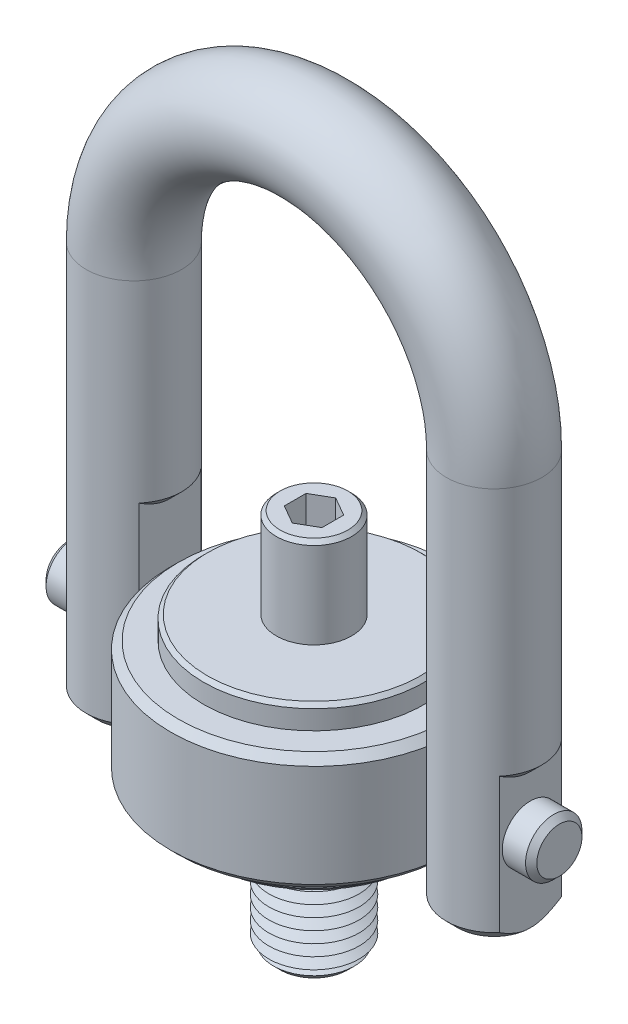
ISO-10303-21;
HEADER;
FILE_DESCRIPTION(('STEP AP214'),'2;1');
FILE_NAME('part.step','',(''),(''),'','','');
FILE_SCHEMA(('AUTOMOTIVE_DESIGN { 1 0 10303 214 1 1 1 1 }'));
ENDSEC;
DATA;
#1=APPLICATION_CONTEXT('core data for automotive mechanical design processes');
#2=APPLICATION_PROTOCOL_DEFINITION('international standard','automotive_design',2000,#1);
#3=PRODUCT_CONTEXT('',#1,'mechanical');
#4=PRODUCT('Part','Part','',(#3));
#5=PRODUCT_RELATED_PRODUCT_CATEGORY('part','',(#4));
#6=PRODUCT_DEFINITION_FORMATION('','',#4);
#7=PRODUCT_DEFINITION_CONTEXT('part definition',#1,'design');
#8=PRODUCT_DEFINITION('design','',#6,#7);
#9=PRODUCT_DEFINITION_SHAPE('','',#8);
#10=(LENGTH_UNIT() NAMED_UNIT(*) SI_UNIT(.MILLI.,.METRE.));
#11=(NAMED_UNIT(*) PLANE_ANGLE_UNIT() SI_UNIT($,.RADIAN.));
#12=(NAMED_UNIT(*) SI_UNIT($,.STERADIAN.) SOLID_ANGLE_UNIT());
#13=UNCERTAINTY_MEASURE_WITH_UNIT(LENGTH_MEASURE(1.E-05),#10,'distance_accuracy_value','');
#14=(GEOMETRIC_REPRESENTATION_CONTEXT(3) GLOBAL_UNCERTAINTY_ASSIGNED_CONTEXT((#13)) GLOBAL_UNIT_ASSIGNED_CONTEXT((#10,
#11,#12)) REPRESENTATION_CONTEXT('',''));
#15=CARTESIAN_POINT('',(0.,0.,0.));
#16=DIRECTION('',(0.,0.,1.));
#17=DIRECTION('',(1.,0.,0.));
#18=AXIS2_PLACEMENT_3D('',#15,#16,#17);
#19=CARTESIAN_POINT('',(65.25,0.,0.));
#20=DIRECTION('',(-1.,0.,0.));
#21=DIRECTION('',(0.,0.,1.));
#22=AXIS2_PLACEMENT_3D('',#19,#20,#21);
#23=CYLINDRICAL_SURFACE('',#22,7.5);
#24=CARTESIAN_POINT('',(-63.75,0.,0.));
#25=DIRECTION('',(1.,0.,0.));
#26=DIRECTION('',(0.,0.,-1.));
#27=AXIS2_PLACEMENT_3D('',#24,#25,#26);
#28=CIRCLE('',#27,7.5);
#29=CARTESIAN_POINT('',(-63.75,0.,-7.5));
#30=VERTEX_POINT('',#29);
#31=EDGE_CURVE('P0_E25',#30,#30,#28,.T.);
#32=ORIENTED_EDGE('',*,*,#31,.T.);
#33=EDGE_LOOP('',(#32));
#34=FACE_BOUND('',#33,.T.);
#35=CARTESIAN_POINT('',(63.75,0.,0.));
#36=DIRECTION('',(1.,0.,0.));
#37=DIRECTION('',(0.,0.,-1.));
#38=AXIS2_PLACEMENT_3D('',#35,#36,#37);
#39=CIRCLE('',#38,7.5);
#40=CARTESIAN_POINT('',(63.75,0.,-7.5));
#41=VERTEX_POINT('',#40);
#42=EDGE_CURVE('P0_E29',#41,#41,#39,.F.);
#43=ORIENTED_EDGE('',*,*,#42,.T.);
#44=EDGE_LOOP('',(#43));
#45=FACE_BOUND('',#44,.T.);
#46=ADVANCED_FACE('P0_F14',(#34,#45),#23,.T.);
#47=CARTESIAN_POINT('',(65.25,0.,0.));
#48=DIRECTION('',(1.,0.,0.));
#49=DIRECTION('',(0.,0.,-1.));
#50=AXIS2_PLACEMENT_3D('',#47,#48,#49);
#51=PLANE('',#50);
#52=CARTESIAN_POINT('',(65.25,0.,0.));
#53=DIRECTION('',(1.,0.,0.));
#54=DIRECTION('',(0.,0.,-1.));
#55=AXIS2_PLACEMENT_3D('',#52,#53,#54);
#56=CIRCLE('',#55,5.99999999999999);
#57=CARTESIAN_POINT('',(65.25,0.,-5.99999999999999));
#58=VERTEX_POINT('',#57);
#59=EDGE_CURVE('P0_E10',#58,#58,#56,.T.);
#60=ORIENTED_EDGE('',*,*,#59,.T.);
#61=EDGE_LOOP('',(#60));
#62=FACE_BOUND('',#61,.T.);
#63=ADVANCED_FACE('P0_F46',(#62),#51,.T.);
#64=CARTESIAN_POINT('',(-65.25,0.,0.));
#65=DIRECTION('',(1.,0.,0.));
#66=DIRECTION('',(0.,0.,-1.));
#67=AXIS2_PLACEMENT_3D('',#64,#65,#66);
#68=PLANE('',#67);
#69=CARTESIAN_POINT('',(-65.25,0.,0.));
#70=DIRECTION('',(1.,0.,0.));
#71=DIRECTION('',(0.,0.,-1.));
#72=AXIS2_PLACEMENT_3D('',#69,#70,#71);
#73=CIRCLE('',#72,5.99999999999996);
#74=CARTESIAN_POINT('',(-65.25,0.,-5.99999999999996));
#75=VERTEX_POINT('',#74);
#76=EDGE_CURVE('P0_E21',#75,#75,#73,.F.);
#77=ORIENTED_EDGE('',*,*,#76,.T.);
#78=EDGE_LOOP('',(#77));
#79=FACE_BOUND('',#78,.T.);
#80=ADVANCED_FACE('P0_F43',(#79),#68,.F.);
#81=CARTESIAN_POINT('',(-63.75,0.,0.));
#82=DIRECTION('',(1.,0.,0.));
#83=DIRECTION('',(0.,0.,-1.));
#84=AXIS2_PLACEMENT_3D('',#81,#82,#83);
#85=CONICAL_SURFACE('',#84,7.5,0.785398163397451);
#86=ORIENTED_EDGE('',*,*,#76,.F.);
#87=EDGE_LOOP('',(#86));
#88=FACE_BOUND('',#87,.T.);
#89=ORIENTED_EDGE('',*,*,#31,.F.);
#90=EDGE_LOOP('',(#89));
#91=FACE_BOUND('',#90,.T.);
#92=ADVANCED_FACE('P0_F38',(#88,#91),#85,.T.);
#93=CARTESIAN_POINT('',(65.25,0.,0.));
#94=DIRECTION('',(-1.,0.,0.));
#95=DIRECTION('',(0.,0.,1.));
#96=AXIS2_PLACEMENT_3D('',#93,#94,#95);
#97=CONICAL_SURFACE('',#96,5.99999999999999,0.785398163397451);
#98=ORIENTED_EDGE('',*,*,#42,.F.);
#99=EDGE_LOOP('',(#98));
#100=FACE_BOUND('',#99,.T.);
#101=ORIENTED_EDGE('',*,*,#59,.F.);
#102=EDGE_LOOP('',(#101));
#103=FACE_BOUND('',#102,.T.);
#104=ADVANCED_FACE('P0_F16',(#100,#103),#97,.T.);
#105=CLOSED_SHELL('',(#46,#63,#80,#92,#104));
#106=MANIFOLD_SOLID_BREP('P0_B1',#105);
#107=CARTESIAN_POINT('',(47.9,-21.7,0.));
#108=DIRECTION('',(0.,-1.,0.));
#109=DIRECTION('',(0.,0.,1.));
#110=AXIS2_PLACEMENT_3D('',#107,#108,#109);
#111=PLANE('',#110);
#112=DIRECTION('',(0.,0.,-1.));
#113=VECTOR('',#112,1.);
#114=CARTESIAN_POINT('',(38.2445611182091,-21.7,8.25));
#115=LINE('',#114,#113);
#116=CARTESIAN_POINT('',(38.2445611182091,-21.7,0.928708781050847));
#117=VERTEX_POINT('',#116);
#118=CARTESIAN_POINT('',(38.2445611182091,-21.7,-0.928708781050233));
#119=VERTEX_POINT('',#118);
#120=EDGE_CURVE('P1_E132',#117,#119,#115,.T.);
#121=ORIENTED_EDGE('',*,*,#120,.T.);
#122=CARTESIAN_POINT('',(47.9,-21.7,0.));
#123=DIRECTION('',(0.,-1.,0.));
#124=DIRECTION('',(1.,0.,0.));
#125=AXIS2_PLACEMENT_3D('',#122,#123,#124);
#126=CIRCLE('',#125,9.69999999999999);
#127=CARTESIAN_POINT('',(57.555438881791,-21.7,-0.928708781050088));
#128=VERTEX_POINT('',#127);
#129=EDGE_CURVE('P1_E192',#119,#128,#126,.T.);
#130=ORIENTED_EDGE('',*,*,#129,.T.);
#131=DIRECTION('',(0.,0.,1.));
#132=VECTOR('',#131,1.);
#133=CARTESIAN_POINT('',(57.555438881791,-21.7,8.25));
#134=LINE('',#133,#132);
#135=CARTESIAN_POINT('',(57.555438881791,-21.7,0.928708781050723));
#136=VERTEX_POINT('',#135);
#137=EDGE_CURVE('P1_E315',#128,#136,#134,.T.);
#138=ORIENTED_EDGE('',*,*,#137,.T.);
#139=CARTESIAN_POINT('',(47.9,-21.7,0.));
#140=DIRECTION('',(0.,-1.,0.));
#141=DIRECTION('',(1.,0.,0.));
#142=AXIS2_PLACEMENT_3D('',#139,#140,#141);
#143=CIRCLE('',#142,9.70000000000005);
#144=CARTESIAN_POINT('',(47.9,-21.7,9.70000000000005));
#145=VERTEX_POINT('',#144);
#146=EDGE_CURVE('P1_E370',#136,#145,#143,.T.);
#147=ORIENTED_EDGE('',*,*,#146,.T.);
#148=CARTESIAN_POINT('',(47.9,-21.7,0.));
#149=DIRECTION('',(0.,-1.,0.));
#150=DIRECTION('',(1.,0.,0.));
#151=AXIS2_PLACEMENT_3D('',#148,#149,#150);
#152=CIRCLE('',#151,9.70000000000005);
#153=EDGE_CURVE('P1_E369',#145,#117,#152,.T.);
#154=ORIENTED_EDGE('',*,*,#153,.T.);
#155=EDGE_LOOP('',(#121,#130,#138,#147,#154));
#156=FACE_BOUND('',#155,.T.);
#157=ADVANCED_FACE('P1_F16',(#156),#111,.T.);
#158=CARTESIAN_POINT('',(47.9,83.5,0.));
#159=DIRECTION('',(0.,-1.,0.));
#160=DIRECTION('',(1.,0.,0.));
#161=AXIS2_PLACEMENT_3D('',#158,#159,#160);
#162=CYLINDRICAL_SURFACE('',#161,12.7);
#163=CARTESIAN_POINT('',(47.9,83.5,0.));
#164=DIRECTION('',(0.,-1.,0.));
#165=DIRECTION('',(0.,0.,1.));
#166=AXIS2_PLACEMENT_3D('',#163,#164,#165);
#167=CIRCLE('',#166,12.7);
#168=CARTESIAN_POINT('',(60.6,83.5,0.));
#169=VERTEX_POINT('',#168);
#170=EDGE_CURVE('P1_E143',#169,#169,#167,.T.);
#171=ORIENTED_EDGE('',*,*,#170,.T.);
#172=EDGE_LOOP('',(#171));
#173=FACE_BOUND('',#172,.T.);
#174=DIRECTION('',(0.,-1.,0.));
#175=VECTOR('',#174,1.);
#176=CARTESIAN_POINT('',(57.555438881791,13.3,-8.25));
#177=LINE('',#176,#175);
#178=CARTESIAN_POINT('',(57.555438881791,17.3000000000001,-8.24999999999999));
#179=VERTEX_POINT('',#178);
#180=CARTESIAN_POINT('',(57.555438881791,-18.7,-8.25));
#181=VERTEX_POINT('',#180);
#182=EDGE_CURVE('P1_E328',#179,#181,#177,.T.);
#183=ORIENTED_EDGE('',*,*,#182,.T.);
#184=CARTESIAN_POINT('',(47.9,-18.7,0.));
#185=DIRECTION('',(0.,-1.,0.));
#186=DIRECTION('',(0.,0.,-1.));
#187=AXIS2_PLACEMENT_3D('',#184,#185,#186);
#188=CIRCLE('',#187,12.7);
#189=CARTESIAN_POINT('',(38.2445611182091,-18.7,-8.25));
#190=VERTEX_POINT('',#189);
#191=EDGE_CURVE('P1_E128',#181,#190,#188,.F.);
#192=ORIENTED_EDGE('',*,*,#191,.T.);
#193=DIRECTION('',(0.,-1.,0.));
#194=VECTOR('',#193,1.);
#195=CARTESIAN_POINT('',(38.2445611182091,28.3,-8.25));
#196=LINE('',#195,#194);
#197=CARTESIAN_POINT('',(38.2445611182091,32.3000000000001,-8.25));
#198=VERTEX_POINT('',#197);
#199=EDGE_CURVE('P1_E120',#198,#190,#196,.T.);
#200=ORIENTED_EDGE('',*,*,#199,.F.);
#201=CARTESIAN_POINT('',(47.9,32.3000000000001,0.));
#202=DIRECTION('',(0.,-1.,0.));
#203=DIRECTION('',(0.,0.,-1.));
#204=AXIS2_PLACEMENT_3D('',#201,#202,#203);
#205=CIRCLE('',#204,12.7);
#206=CARTESIAN_POINT('',(38.2445611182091,32.3000000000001,8.25000000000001));
#207=VERTEX_POINT('',#206);
#208=EDGE_CURVE('P1_E126',#198,#207,#205,.F.);
#209=ORIENTED_EDGE('',*,*,#208,.T.);
#210=DIRECTION('',(0.,-1.,0.));
#211=VECTOR('',#210,1.);
#212=CARTESIAN_POINT('',(38.2445611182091,28.3,8.25));
#213=LINE('',#212,#211);
#214=CARTESIAN_POINT('',(38.2445611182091,-18.7,8.25));
#215=VERTEX_POINT('',#214);
#216=EDGE_CURVE('P1_E131',#207,#215,#213,.T.);
#217=ORIENTED_EDGE('',*,*,#216,.T.);
#218=CARTESIAN_POINT('',(47.9,-18.7,0.));
#219=DIRECTION('',(0.,-1.,0.));
#220=DIRECTION('',(0.,0.,-1.));
#221=AXIS2_PLACEMENT_3D('',#218,#219,#220);
#222=CIRCLE('',#221,12.7);
#223=CARTESIAN_POINT('',(47.9,-18.7,12.7));
#224=VERTEX_POINT('',#223);
#225=EDGE_CURVE('P1_E530',#215,#224,#222,.F.);
#226=ORIENTED_EDGE('',*,*,#225,.T.);
#227=CARTESIAN_POINT('',(47.9,-18.7,0.));
#228=DIRECTION('',(0.,-1.,0.));
#229=DIRECTION('',(0.,0.,-1.));
#230=AXIS2_PLACEMENT_3D('',#227,#228,#229);
#231=CIRCLE('',#230,12.7);
#232=CARTESIAN_POINT('',(57.555438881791,-18.7,8.25));
#233=VERTEX_POINT('',#232);
#234=EDGE_CURVE('P1_E528',#224,#233,#231,.F.);
#235=ORIENTED_EDGE('',*,*,#234,.T.);
#236=DIRECTION('',(0.,-1.,0.));
#237=VECTOR('',#236,1.);
#238=CARTESIAN_POINT('',(57.555438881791,13.3,8.25));
#239=LINE('',#238,#237);
#240=CARTESIAN_POINT('',(57.555438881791,17.3000000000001,8.25));
#241=VERTEX_POINT('',#240);
#242=EDGE_CURVE('P1_E327',#241,#233,#239,.T.);
#243=ORIENTED_EDGE('',*,*,#242,.F.);
#244=CARTESIAN_POINT('',(47.9,17.3000000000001,0.));
#245=DIRECTION('',(0.,-1.,0.));
#246=DIRECTION('',(0.,0.,-1.));
#247=AXIS2_PLACEMENT_3D('',#244,#245,#246);
#248=CIRCLE('',#247,12.7);
#249=EDGE_CURVE('P1_E142',#241,#179,#248,.F.);
#250=ORIENTED_EDGE('',*,*,#249,.T.);
#251=EDGE_LOOP('',(#183,#192,#200,#209,#217,#226,#235,#243,#250));
#252=FACE_BOUND('',#251,.T.);
#253=ADVANCED_FACE('P1_F123',(#173,#252),#162,.T.);
#254=CARTESIAN_POINT('',(-47.9000000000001,-21.7,0.));
#255=DIRECTION('',(0.,1.,0.));
#256=DIRECTION('',(0.,0.,1.));
#257=AXIS2_PLACEMENT_3D('',#254,#255,#256);
#258=PLANE('',#257);
#259=DIRECTION('',(0.,0.,1.));
#260=VECTOR('',#259,1.);
#261=CARTESIAN_POINT('',(-57.555438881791,-21.7,8.25));
#262=LINE('',#261,#260);
#263=CARTESIAN_POINT('',(-57.555438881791,-21.7,-0.92870878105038));
#264=VERTEX_POINT('',#263);
#265=CARTESIAN_POINT('',(-57.555438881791,-21.7,0.928708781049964));
#266=VERTEX_POINT('',#265);
#267=EDGE_CURVE('P1_E334',#264,#266,#262,.T.);
#268=ORIENTED_EDGE('',*,*,#267,.F.);
#269=CARTESIAN_POINT('',(-47.9000000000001,-21.7,0.));
#270=DIRECTION('',(0.,1.,0.));
#271=DIRECTION('',(0.,0.,1.));
#272=AXIS2_PLACEMENT_3D('',#269,#270,#271);
#273=CIRCLE('',#272,9.70000000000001);
#274=CARTESIAN_POINT('',(-38.2445611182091,-21.7,-0.928708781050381));
#275=VERTEX_POINT('',#274);
#276=EDGE_CURVE('P1_E40',#264,#275,#273,.F.);
#277=ORIENTED_EDGE('',*,*,#276,.T.);
#278=DIRECTION('',(0.,0.,-1.));
#279=VECTOR('',#278,1.);
#280=CARTESIAN_POINT('',(-38.2445611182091,-21.7,8.25));
#281=LINE('',#280,#279);
#282=CARTESIAN_POINT('',(-38.2445611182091,-21.7,0.928708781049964));
#283=VERTEX_POINT('',#282);
#284=EDGE_CURVE('P1_E303',#283,#275,#281,.T.);
#285=ORIENTED_EDGE('',*,*,#284,.F.);
#286=CARTESIAN_POINT('',(-47.9000000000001,-21.7,0.));
#287=DIRECTION('',(0.,1.,0.));
#288=DIRECTION('',(0.,0.,1.));
#289=AXIS2_PLACEMENT_3D('',#286,#287,#288);
#290=CIRCLE('',#289,9.69999999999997);
#291=CARTESIAN_POINT('',(-47.9000000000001,-21.7,9.69999999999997));
#292=VERTEX_POINT('',#291);
#293=EDGE_CURVE('P1_E34',#283,#292,#290,.F.);
#294=ORIENTED_EDGE('',*,*,#293,.T.);
#295=CARTESIAN_POINT('',(-47.9000000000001,-21.7,0.));
#296=DIRECTION('',(0.,1.,0.));
#297=DIRECTION('',(0.,0.,1.));
#298=AXIS2_PLACEMENT_3D('',#295,#296,#297);
#299=CIRCLE('',#298,9.69999999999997);
#300=EDGE_CURVE('P1_E298',#292,#266,#299,.F.);
#301=ORIENTED_EDGE('',*,*,#300,.T.);
#302=EDGE_LOOP('',(#268,#277,#285,#294,#301));
#303=FACE_BOUND('',#302,.T.);
#304=ADVANCED_FACE('P1_F239',(#303),#258,.F.);
#305=CARTESIAN_POINT('',(-47.9000000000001,-21.7,0.));
#306=DIRECTION('',(0.,1.,0.));
#307=DIRECTION('',(-1.,0.,0.));
#308=AXIS2_PLACEMENT_3D('',#305,#306,#307);
#309=CYLINDRICAL_SURFACE('',#308,12.7);
#310=DIRECTION('',(0.,-1.,0.));
#311=VECTOR('',#310,1.);
#312=CARTESIAN_POINT('',(-38.2445611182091,28.3,-8.25));
#313=LINE('',#312,#311);
#314=CARTESIAN_POINT('',(-38.2445611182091,32.3,-8.25));
#315=VERTEX_POINT('',#314);
#316=CARTESIAN_POINT('',(-38.2445611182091,-18.7,-8.25));
#317=VERTEX_POINT('',#316);
#318=EDGE_CURVE('P1_E340',#315,#317,#313,.T.);
#319=ORIENTED_EDGE('',*,*,#318,.T.);
#320=CARTESIAN_POINT('',(-47.9000000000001,-18.7,0.));
#321=DIRECTION('',(0.,1.,0.));
#322=DIRECTION('',(0.,0.,1.));
#323=AXIS2_PLACEMENT_3D('',#320,#321,#322);
#324=CIRCLE('',#323,12.7);
#325=CARTESIAN_POINT('',(-57.555438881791,-18.7,-8.25));
#326=VERTEX_POINT('',#325);
#327=EDGE_CURVE('P1_E287',#317,#326,#324,.T.);
#328=ORIENTED_EDGE('',*,*,#327,.T.);
#329=DIRECTION('',(0.,-1.,0.));
#330=VECTOR('',#329,1.);
#331=CARTESIAN_POINT('',(-57.555438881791,13.3,-8.25));
#332=LINE('',#331,#330);
#333=CARTESIAN_POINT('',(-57.555438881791,17.3,-8.24999999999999));
#334=VERTEX_POINT('',#333);
#335=EDGE_CURVE('P1_E337',#334,#326,#332,.T.);
#336=ORIENTED_EDGE('',*,*,#335,.F.);
#337=CARTESIAN_POINT('',(-47.9,17.3,0.));
#338=DIRECTION('',(0.,-1.,0.));
#339=DIRECTION('',(0.,0.,-1.));
#340=AXIS2_PLACEMENT_3D('',#337,#338,#339);
#341=CIRCLE('',#340,12.7);
#342=CARTESIAN_POINT('',(-57.555438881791,17.3,8.24999999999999));
#343=VERTEX_POINT('',#342);
#344=EDGE_CURVE('P1_E146',#334,#343,#341,.F.);
#345=ORIENTED_EDGE('',*,*,#344,.T.);
#346=DIRECTION('',(0.,-1.,0.));
#347=VECTOR('',#346,1.);
#348=CARTESIAN_POINT('',(-57.555438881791,13.3,8.25));
#349=LINE('',#348,#347);
#350=CARTESIAN_POINT('',(-57.555438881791,-18.7,8.25));
#351=VERTEX_POINT('',#350);
#352=EDGE_CURVE('P1_E308',#343,#351,#349,.T.);
#353=ORIENTED_EDGE('',*,*,#352,.T.);
#354=CARTESIAN_POINT('',(-47.9000000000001,-18.7,0.));
#355=DIRECTION('',(0.,1.,0.));
#356=DIRECTION('',(0.,0.,1.));
#357=AXIS2_PLACEMENT_3D('',#354,#355,#356);
#358=CIRCLE('',#357,12.7);
#359=CARTESIAN_POINT('',(-47.9000000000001,-18.7,12.7));
#360=VERTEX_POINT('',#359);
#361=EDGE_CURVE('P1_E284',#351,#360,#358,.T.);
#362=ORIENTED_EDGE('',*,*,#361,.T.);
#363=CARTESIAN_POINT('',(-47.9000000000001,-18.7,0.));
#364=DIRECTION('',(0.,1.,0.));
#365=DIRECTION('',(0.,0.,1.));
#366=AXIS2_PLACEMENT_3D('',#363,#364,#365);
#367=CIRCLE('',#366,12.7);
#368=CARTESIAN_POINT('',(-38.2445611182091,-18.7,8.25));
#369=VERTEX_POINT('',#368);
#370=EDGE_CURVE('P1_E277',#360,#369,#367,.T.);
#371=ORIENTED_EDGE('',*,*,#370,.T.);
#372=DIRECTION('',(0.,-1.,0.));
#373=VECTOR('',#372,1.);
#374=CARTESIAN_POINT('',(-38.2445611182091,28.3,8.25));
#375=LINE('',#374,#373);
#376=CARTESIAN_POINT('',(-38.2445611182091,32.3,8.25));
#377=VERTEX_POINT('',#376);
#378=EDGE_CURVE('P1_E305',#377,#369,#375,.T.);
#379=ORIENTED_EDGE('',*,*,#378,.F.);
#380=CARTESIAN_POINT('',(-47.9,32.3,0.));
#381=DIRECTION('',(0.,-1.,0.));
#382=DIRECTION('',(0.,0.,-1.));
#383=AXIS2_PLACEMENT_3D('',#380,#381,#382);
#384=CIRCLE('',#383,12.7);
#385=EDGE_CURVE('P1_E155',#377,#315,#384,.F.);
#386=ORIENTED_EDGE('',*,*,#385,.T.);
#387=EDGE_LOOP('',(#319,#328,#336,#345,#353,#362,#371,#379,#386));
#388=FACE_BOUND('',#387,.T.);
#389=CARTESIAN_POINT('',(-47.9,83.5,0.));
#390=DIRECTION('',(0.,1.,0.));
#391=DIRECTION('',(0.,0.,1.));
#392=AXIS2_PLACEMENT_3D('',#389,#390,#391);
#393=CIRCLE('',#392,12.7);
#394=CARTESIAN_POINT('',(-60.6000000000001,83.5,0.));
#395=VERTEX_POINT('',#394);
#396=EDGE_CURVE('P1_E149',#395,#395,#393,.T.);
#397=ORIENTED_EDGE('',*,*,#396,.F.);
#398=EDGE_LOOP('',(#397));
#399=FACE_BOUND('',#398,.T.);
#400=ADVANCED_FACE('P1_F241',(#388,#399),#309,.T.);
#401=CARTESIAN_POINT('',(0.,83.5,0.));
#402=DIRECTION('',(0.,0.,-1.));
#403=DIRECTION('',(-1.,0.,0.));
#404=AXIS2_PLACEMENT_3D('',#401,#402,#403);
#405=TOROIDAL_SURFACE('',#404,47.9,12.7);
#406=CARTESIAN_POINT('',(0.,83.5,0.));
#407=DIRECTION('',(0.,0.,-1.));
#408=DIRECTION('',(-1.,0.,0.));
#409=AXIS2_PLACEMENT_3D('',#406,#407,#408);
#410=CIRCLE('',#409,60.6000000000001);
#411=EDGE_CURVE('',#395,#169,#410,.T.);
#412=ORIENTED_EDGE('',*,*,#396,.T.);
#413=ORIENTED_EDGE('',*,*,#170,.F.);
#414=ORIENTED_EDGE('',*,*,#411,.T.);
#415=ORIENTED_EDGE('',*,*,#411,.F.);
#416=EDGE_LOOP('',(#412,#414,#413,#415));
#417=FACE_BOUND('',#416,.T.);
#418=ADVANCED_FACE('P1_F237',(#417),#405,.T.);
#419=CARTESIAN_POINT('',(-38.2445611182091,28.3,8.25));
#420=DIRECTION('',(-1.,0.,0.));
#421=DIRECTION('',(0.,0.,1.));
#422=AXIS2_PLACEMENT_3D('',#419,#420,#421);
#423=PLANE('',#422);
#424=CARTESIAN_POINT('',(-38.2445611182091,0.,0.));
#425=DIRECTION('',(-1.,0.,0.));
#426=DIRECTION('',(0.,0.,1.));
#427=AXIS2_PLACEMENT_3D('',#424,#425,#426);
#428=CIRCLE('',#427,7.5);
#429=CARTESIAN_POINT('',(-38.2445611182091,0.,-7.5));
#430=VERTEX_POINT('',#429);
#431=EDGE_CURVE('P1_E313',#430,#430,#428,.T.);
#432=ORIENTED_EDGE('',*,*,#431,.T.);
#433=EDGE_LOOP('',(#432));
#434=FACE_BOUND('',#433,.T.);
#435=ORIENTED_EDGE('',*,*,#284,.T.);
#436=CARTESIAN_POINT('',(-38.2445611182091,-21.7,-0.928708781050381));
#437=CARTESIAN_POINT('',(-38.2445611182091,-21.6844845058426,-1.0909535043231));
#438=CARTESIAN_POINT('',(-38.2445611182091,-21.6649380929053,-1.25279346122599));
#439=CARTESIAN_POINT('',(-38.2445611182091,-21.6181924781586,-1.57531409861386));
#440=CARTESIAN_POINT('',(-38.2445611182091,-21.5909957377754,-1.73599513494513));
#441=CARTESIAN_POINT('',(-38.2445611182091,-21.5294234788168,-2.05556125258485));
#442=CARTESIAN_POINT('',(-38.2445611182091,-21.4950656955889,-2.21444976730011));
#443=CARTESIAN_POINT('',(-38.2445611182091,-21.419620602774,-2.53062146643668));
#444=CARTESIAN_POINT('',(-38.2445611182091,-21.3785327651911,-2.68790452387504));
#445=CARTESIAN_POINT('',(-38.2445611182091,-21.2471243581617,-3.15293445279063));
#446=CARTESIAN_POINT('',(-38.2445611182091,-21.1478021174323,-3.4581643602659));
#447=CARTESIAN_POINT('',(-38.2445611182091,-20.9289398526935,-4.061371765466));
#448=CARTESIAN_POINT('',(-38.2445611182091,-20.809386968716,-4.35934451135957));
#449=CARTESIAN_POINT('',(-38.2445611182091,-20.5461292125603,-4.96568309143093));
#450=CARTESIAN_POINT('',(-38.2445611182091,-20.4014074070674,-5.27360443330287));
#451=CARTESIAN_POINT('',(-38.2445611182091,-20.0971002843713,-5.88195737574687));
#452=CARTESIAN_POINT('',(-38.2445611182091,-19.9375143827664,-6.18238868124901));
#453=CARTESIAN_POINT('',(-38.2445611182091,-19.6039515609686,-6.78099899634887));
#454=CARTESIAN_POINT('',(-38.2445611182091,-19.4297957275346,-7.07907784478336));
#455=CARTESIAN_POINT('',(-38.2445611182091,-19.1612257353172,-7.52155488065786));
#456=CARTESIAN_POINT('',(-38.2445611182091,-19.0705137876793,-7.66822154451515));
#457=CARTESIAN_POINT('',(-38.2445611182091,-18.8868671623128,-7.96014117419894));
#458=CARTESIAN_POINT('',(-38.2445611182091,-18.7939326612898,-8.10539425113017));
#459=CARTESIAN_POINT('',(-38.2445611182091,-18.7,-8.25));
#460=B_SPLINE_CURVE_WITH_KNOTS('',3,(#436,#437,#438,#439,#440,#441,#442,#443,#444,#445,#446,
#447,#448,#449,#450,#451,#452,#453,#454,#455,#456,#457,#458,#459),.UNSPECIFIED.,.F.,.F.,(4,2,2,
2,2,2,2,2,2,2,2,4),(0.,0.488876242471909,0.977595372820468,1.46511820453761,1.95267930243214,
2.91468065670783,3.87729583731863,4.89749204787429,5.91772838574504,6.95315742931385,
7.47049833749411,7.98779825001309),.UNSPECIFIED.);
#461=EDGE_CURVE('P1_E11',#275,#317,#460,.T.);
#462=ORIENTED_EDGE('',*,*,#461,.T.);
#463=ORIENTED_EDGE('',*,*,#318,.F.);
#464=CARTESIAN_POINT('',(-38.2445611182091,32.3,-8.25));
#465=CARTESIAN_POINT('',(-38.2445611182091,32.1703674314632,-8.05041043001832));
#466=CARTESIAN_POINT('',(-38.2445611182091,32.0426084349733,-7.84958462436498));
#467=CARTESIAN_POINT('',(-38.2445611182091,31.7914840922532,-7.44513716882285));
#468=CARTESIAN_POINT('',(-38.2445611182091,31.6681198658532,-7.24151482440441));
#469=CARTESIAN_POINT('',(-38.2445611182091,31.4259059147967,-6.83024655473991));
#470=CARTESIAN_POINT('',(-38.2445611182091,31.3070812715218,-6.62258580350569));
#471=CARTESIAN_POINT('',(-38.2445611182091,31.0754529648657,-6.20394504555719));
#472=CARTESIAN_POINT('',(-38.2445611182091,30.9626489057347,-5.9929652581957));
#473=CARTESIAN_POINT('',(-38.2445611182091,30.7415767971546,-5.56256117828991));
#474=CARTESIAN_POINT('',(-38.2445611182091,30.6334691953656,-5.34305383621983));
#475=CARTESIAN_POINT('',(-38.2445611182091,30.4258619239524,-4.90001001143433));
#476=CARTESIAN_POINT('',(-38.2445611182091,30.3263630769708,-4.67647314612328));
#477=CARTESIAN_POINT('',(-38.2445611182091,30.0433036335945,-4.00030114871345));
#478=CARTESIAN_POINT('',(-38.2445611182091,29.8746592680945,-3.54111751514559));
#479=CARTESIAN_POINT('',(-38.2445611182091,29.6480567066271,-2.79408739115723));
#480=CARTESIAN_POINT('',(-38.2445611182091,29.5728407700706,-2.51144576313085));
#481=CARTESIAN_POINT('',(-38.2445611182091,29.4446870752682,-1.94101534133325));
#482=CARTESIAN_POINT('',(-38.2445611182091,29.3917526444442,-1.6532257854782));
#483=CARTESIAN_POINT('',(-38.2445611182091,29.3110934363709,-1.07642822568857));
#484=CARTESIAN_POINT('',(-38.2445611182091,29.2831716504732,-0.787448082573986));
#485=CARTESIAN_POINT('',(-38.2445611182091,29.2533586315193,-0.208244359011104));
#486=CARTESIAN_POINT('',(-38.2445611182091,29.2514547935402,0.0819785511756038));
#487=CARTESIAN_POINT('',(-38.2445611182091,29.2707798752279,0.584752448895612));
#488=CARTESIAN_POINT('',(-38.2445611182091,29.2860266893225,0.797554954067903));
#489=CARTESIAN_POINT('',(-38.2445611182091,29.3301499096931,1.22182954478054));
#490=CARTESIAN_POINT('',(-38.2445611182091,29.3590327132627,1.43330095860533));
#491=CARTESIAN_POINT('',(-38.2445611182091,29.4532152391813,1.99441776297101));
#492=CARTESIAN_POINT('',(-38.2445611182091,29.5299558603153,2.34217500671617));
#493=CARTESIAN_POINT('',(-38.2445611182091,29.7141427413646,3.02959280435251));
#494=CARTESIAN_POINT('',(-38.2445611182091,29.8216178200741,3.36924543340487));
#495=CARTESIAN_POINT('',(-38.2445611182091,30.062347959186,4.04131756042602));
#496=CARTESIAN_POINT('',(-38.2445611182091,30.195744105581,4.37368586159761));
#497=CARTESIAN_POINT('',(-38.2445611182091,30.4827859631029,5.02935906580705));
#498=CARTESIAN_POINT('',(-38.2445611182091,30.6364264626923,5.35266627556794));
#499=CARTESIAN_POINT('',(-38.2445611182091,30.9111704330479,5.89508828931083));
#500=CARTESIAN_POINT('',(-38.2445611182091,31.0281703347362,6.11630738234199));
#501=CARTESIAN_POINT('',(-38.2445611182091,31.2688724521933,6.55505345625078));
#502=CARTESIAN_POINT('',(-38.2445611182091,31.3925743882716,6.7725805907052));
#503=CARTESIAN_POINT('',(-38.2445611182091,31.6442229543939,7.20178561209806));
#504=CARTESIAN_POINT('',(-38.2445611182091,31.7721041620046,7.41350202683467));
#505=CARTESIAN_POINT('',(-38.2445611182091,32.0326509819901,7.83392319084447));
#506=CARTESIAN_POINT('',(-38.2445611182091,32.1653157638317,8.04262845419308));
#507=CARTESIAN_POINT('',(-38.2445611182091,32.3,8.25000000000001));
#508=B_SPLINE_CURVE_WITH_KNOTS('',3,(#464,#465,#466,#467,#468,#469,#470,#471,#472,#473,#474,
#475,#476,#477,#478,#479,#480,#481,#482,#483,#484,#485,#486,#487,#488,#489,#490,#491,#492,#493,
#494,#495,#496,#497,#498,#499,#500,#501,#502,#503,#504,#505,#506,#507),.UNSPECIFIED.,.F.,.F.,(4,
2,2,2,2,2,2,2,2,2,2,2,2,2,2,2,2,2,2,2,2,4),(0.,0.713991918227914,1.42816448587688,
2.14583629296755,2.86346086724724,3.59732743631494,4.33126405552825,5.79579808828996,
6.67250509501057,7.5493429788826,8.41921225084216,9.28866008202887,9.92826925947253,
10.568178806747,11.6347696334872,12.7023638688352,13.7759404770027,14.8492412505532,
15.5998864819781,16.3505004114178,17.0924559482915,17.8342832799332),.UNSPECIFIED.);
#509=EDGE_CURVE('P1_E138',#315,#377,#508,.T.);
#510=ORIENTED_EDGE('',*,*,#509,.T.);
#511=ORIENTED_EDGE('',*,*,#378,.T.);
#512=CARTESIAN_POINT('',(-38.2445611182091,-18.7,8.25));
#513=CARTESIAN_POINT('',(-38.2445611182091,-18.8286157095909,8.05197686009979));
#514=CARTESIAN_POINT('',(-38.2445611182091,-18.9553865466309,7.85273665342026));
#515=CARTESIAN_POINT('',(-38.2445611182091,-19.2046095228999,7.45150438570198));
#516=CARTESIAN_POINT('',(-38.2445611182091,-19.3270605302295,7.24951162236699));
#517=CARTESIAN_POINT('',(-38.2445611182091,-19.5674840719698,6.84164865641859));
#518=CARTESIAN_POINT('',(-38.2445611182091,-19.6854341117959,6.63576514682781));
#519=CARTESIAN_POINT('',(-38.2445611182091,-19.9154326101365,6.22074234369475));
#520=CARTESIAN_POINT('',(-38.2445611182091,-20.0274815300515,6.01160330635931));
#521=CARTESIAN_POINT('',(-38.2445611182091,-20.2420878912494,5.59487426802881));
#522=CARTESIAN_POINT('',(-38.2445611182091,-20.3448094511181,5.38736935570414));
#523=CARTESIAN_POINT('',(-38.2445611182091,-20.5426463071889,4.96876868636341));
#524=CARTESIAN_POINT('',(-38.2445611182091,-20.6377608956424,4.75767259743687));
#525=CARTESIAN_POINT('',(-38.2445611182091,-20.9095677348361,4.11942628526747));
#526=CARTESIAN_POINT('',(-38.2445611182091,-21.0731837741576,3.68644448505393));
#527=CARTESIAN_POINT('',(-38.2445611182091,-21.273218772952,3.05871449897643));
#528=CARTESIAN_POINT('',(-38.2445611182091,-21.3287240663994,2.86995086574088));
#529=CARTESIAN_POINT('',(-38.2445611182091,-21.4303684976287,2.48989716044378));
#530=CARTESIAN_POINT('',(-38.2445611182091,-21.4765079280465,2.29860716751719));
#531=CARTESIAN_POINT('',(-38.2445611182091,-21.5589126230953,1.9119275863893));
#532=CARTESIAN_POINT('',(-38.2445611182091,-21.5950762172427,1.71651617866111));
#533=CARTESIAN_POINT('',(-38.2445611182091,-21.6561692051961,1.32384658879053));
#534=CARTESIAN_POINT('',(-38.2445611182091,-21.6810926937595,1.12658749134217));
#535=CARTESIAN_POINT('',(-38.2445611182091,-21.7,0.928708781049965));
#536=B_SPLINE_CURVE_WITH_KNOTS('',3,(#512,#513,#514,#515,#516,#517,#518,#519,#520,#521,#522,
#523,#524,#525,#526,#527,#528,#529,#530,#531,#532,#533,#534,#535),.UNSPECIFIED.,.F.,.F.,(4,2,2,
2,2,2,2,2,2,2,2,4),(0.,0.708388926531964,1.41696210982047,2.12870631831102,2.84039479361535,
3.53485251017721,4.22937476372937,5.61546327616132,6.20554336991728,6.79560502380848,
7.39147513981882,7.98765794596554),.UNSPECIFIED.);
#537=EDGE_CURVE('P1_E26',#369,#283,#536,.T.);
#538=ORIENTED_EDGE('',*,*,#537,.T.);
#539=EDGE_LOOP('',(#435,#462,#463,#510,#511,#538));
#540=FACE_BOUND('',#539,.T.);
#541=ADVANCED_FACE('P1_F232',(#434,#540),#423,.F.);
#542=CARTESIAN_POINT('',(-57.555438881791,13.3,8.25));
#543=DIRECTION('',(1.,0.,0.));
#544=DIRECTION('',(0.,0.,-1.));
#545=AXIS2_PLACEMENT_3D('',#542,#543,#544);
#546=PLANE('',#545);
#547=CARTESIAN_POINT('',(-57.555438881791,0.,0.));
#548=DIRECTION('',(1.,0.,0.));
#549=DIRECTION('',(0.,0.,-1.));
#550=AXIS2_PLACEMENT_3D('',#547,#548,#549);
#551=CIRCLE('',#550,7.5);
#552=CARTESIAN_POINT('',(-57.555438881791,0.,-7.5));
#553=VERTEX_POINT('',#552);
#554=EDGE_CURVE('P1_E321',#553,#553,#551,.F.);
#555=ORIENTED_EDGE('',*,*,#554,.F.);
#556=EDGE_LOOP('',(#555));
#557=FACE_BOUND('',#556,.T.);
#558=ORIENTED_EDGE('',*,*,#335,.T.);
#559=CARTESIAN_POINT('',(-57.555438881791,-18.7,-8.25));
#560=CARTESIAN_POINT('',(-57.555438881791,-18.8286157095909,-8.05197686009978));
#561=CARTESIAN_POINT('',(-57.555438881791,-18.955386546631,-7.85273665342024));
#562=CARTESIAN_POINT('',(-57.555438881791,-19.2046095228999,-7.45150438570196));
#563=CARTESIAN_POINT('',(-57.555438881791,-19.3270605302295,-7.24951162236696));
#564=CARTESIAN_POINT('',(-57.555438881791,-19.5674840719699,-6.84164865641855));
#565=CARTESIAN_POINT('',(-57.555438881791,-19.685434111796,-6.63576514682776));
#566=CARTESIAN_POINT('',(-57.555438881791,-19.9154326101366,-6.22074234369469));
#567=CARTESIAN_POINT('',(-57.555438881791,-20.0274815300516,-6.01160330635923));
#568=CARTESIAN_POINT('',(-57.555438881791,-20.2420878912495,-5.59487426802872));
#569=CARTESIAN_POINT('',(-57.555438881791,-20.3448094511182,-5.38736935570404));
#570=CARTESIAN_POINT('',(-57.555438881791,-20.542646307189,-4.9687686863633));
#571=CARTESIAN_POINT('',(-57.555438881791,-20.6377608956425,-4.75767259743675));
#572=CARTESIAN_POINT('',(-57.555438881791,-20.9095677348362,-4.11942628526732));
#573=CARTESIAN_POINT('',(-57.555438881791,-21.0731837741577,-3.68644448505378));
#574=CARTESIAN_POINT('',(-57.555438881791,-21.2732187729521,-3.0587144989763));
#575=CARTESIAN_POINT('',(-57.555438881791,-21.3287240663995,-2.8699508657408));
#576=CARTESIAN_POINT('',(-57.555438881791,-21.4303684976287,-2.48989716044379));
#577=CARTESIAN_POINT('',(-57.555438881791,-21.4765079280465,-2.29860716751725));
#578=CARTESIAN_POINT('',(-57.555438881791,-21.5589126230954,-1.91192758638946));
#579=CARTESIAN_POINT('',(-57.555438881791,-21.5950762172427,-1.71651617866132));
#580=CARTESIAN_POINT('',(-57.555438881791,-21.6561692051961,-1.32384658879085));
#581=CARTESIAN_POINT('',(-57.555438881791,-21.6810926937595,-1.12658749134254));
#582=CARTESIAN_POINT('',(-57.555438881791,-21.7,-0.928708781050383));
#583=B_SPLINE_CURVE_WITH_KNOTS('',3,(#559,#560,#561,#562,#563,#564,#565,#566,#567,#568,#569,
#570,#571,#572,#573,#574,#575,#576,#577,#578,#579,#580,#581,#582),.UNSPECIFIED.,.F.,.F.,(4,2,2,
2,2,2,2,2,2,2,2,4),(0.,0.708388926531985,1.41696210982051,2.12870631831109,2.84039479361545,
3.53485251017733,4.22937476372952,5.61546327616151,6.20554336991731,6.79560502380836,
7.39147513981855,7.98765794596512),.UNSPECIFIED.);
#584=EDGE_CURVE('P1_E216',#326,#264,#583,.T.);
#585=ORIENTED_EDGE('',*,*,#584,.T.);
#586=ORIENTED_EDGE('',*,*,#267,.T.);
#587=CARTESIAN_POINT('',(-57.555438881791,-21.7,0.928708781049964));
#588=CARTESIAN_POINT('',(-57.555438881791,-21.6844845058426,1.09095350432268));
#589=CARTESIAN_POINT('',(-57.555438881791,-21.6649380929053,1.25279346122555));
#590=CARTESIAN_POINT('',(-57.555438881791,-21.6181924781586,1.57531409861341));
#591=CARTESIAN_POINT('',(-57.555438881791,-21.5909957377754,1.73599513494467));
#592=CARTESIAN_POINT('',(-57.555438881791,-21.5294234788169,2.05556125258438));
#593=CARTESIAN_POINT('',(-57.555438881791,-21.4950656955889,2.21444976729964));
#594=CARTESIAN_POINT('',(-57.555438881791,-21.419620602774,2.5306214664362));
#595=CARTESIAN_POINT('',(-57.555438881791,-21.3785327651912,2.68790452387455));
#596=CARTESIAN_POINT('',(-57.555438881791,-21.2471243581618,3.15293445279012));
#597=CARTESIAN_POINT('',(-57.555438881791,-21.1478021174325,3.45816436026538));
#598=CARTESIAN_POINT('',(-57.555438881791,-20.9289398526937,4.06137176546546));
#599=CARTESIAN_POINT('',(-57.555438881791,-20.8093869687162,4.35934451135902));
#600=CARTESIAN_POINT('',(-57.555438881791,-20.5461292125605,4.96568309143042));
#601=CARTESIAN_POINT('',(-57.555438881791,-20.4014074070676,5.27360443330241));
#602=CARTESIAN_POINT('',(-57.555438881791,-20.0971002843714,5.8819573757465));
#603=CARTESIAN_POINT('',(-57.555438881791,-19.9375143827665,6.18238868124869));
#604=CARTESIAN_POINT('',(-57.555438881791,-19.6039515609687,6.78099899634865));
#605=CARTESIAN_POINT('',(-57.555438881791,-19.4297957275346,7.07907784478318));
#606=CARTESIAN_POINT('',(-57.555438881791,-19.1612257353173,7.52155488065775));
#607=CARTESIAN_POINT('',(-57.555438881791,-19.0705137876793,7.66822154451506));
#608=CARTESIAN_POINT('',(-57.555438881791,-18.8868671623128,7.96014117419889));
#609=CARTESIAN_POINT('',(-57.555438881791,-18.7939326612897,8.10539425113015));
#610=CARTESIAN_POINT('',(-57.555438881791,-18.7,8.25));
#611=B_SPLINE_CURVE_WITH_KNOTS('',3,(#587,#588,#589,#590,#591,#592,#593,#594,#595,#596,#597,
#598,#599,#600,#601,#602,#603,#604,#605,#606,#607,#608,#609,#610),.UNSPECIFIED.,.F.,.F.,(4,2,2,
2,2,2,2,2,2,2,2,4),(0.,0.488876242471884,0.977595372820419,1.46511820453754,1.95267930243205,
2.91468065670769,3.87729583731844,4.89749204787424,5.91772838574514,6.95315742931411,
7.47049833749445,7.98779825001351),.UNSPECIFIED.);
#612=EDGE_CURVE('P1_E289',#266,#351,#611,.T.);
#613=ORIENTED_EDGE('',*,*,#612,.T.);
#614=ORIENTED_EDGE('',*,*,#352,.F.);
#615=CARTESIAN_POINT('',(-57.555438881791,17.3,8.24999999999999));
#616=CARTESIAN_POINT('',(-57.555438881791,17.1703674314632,8.05041043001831));
#617=CARTESIAN_POINT('',(-57.555438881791,17.0426084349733,7.84958462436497));
#618=CARTESIAN_POINT('',(-57.555438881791,16.7914840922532,7.44513716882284));
#619=CARTESIAN_POINT('',(-57.555438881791,16.6681198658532,7.24151482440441));
#620=CARTESIAN_POINT('',(-57.555438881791,16.4259059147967,6.8302465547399));
#621=CARTESIAN_POINT('',(-57.555438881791,16.3070812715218,6.62258580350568));
#622=CARTESIAN_POINT('',(-57.555438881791,16.0754529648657,6.20394504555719));
#623=CARTESIAN_POINT('',(-57.555438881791,15.9626489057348,5.99296525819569));
#624=CARTESIAN_POINT('',(-57.555438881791,15.7415767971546,5.5625611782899));
#625=CARTESIAN_POINT('',(-57.555438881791,15.6334691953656,5.34305383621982));
#626=CARTESIAN_POINT('',(-57.555438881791,15.4258619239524,4.90001001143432));
#627=CARTESIAN_POINT('',(-57.555438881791,15.3263630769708,4.67647314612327));
#628=CARTESIAN_POINT('',(-57.555438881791,15.0433036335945,4.00030114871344));
#629=CARTESIAN_POINT('',(-57.555438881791,14.8746592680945,3.54111751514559));
#630=CARTESIAN_POINT('',(-57.555438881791,14.6480567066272,2.79408739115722));
#631=CARTESIAN_POINT('',(-57.555438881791,14.5728407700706,2.51144576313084));
#632=CARTESIAN_POINT('',(-57.555438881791,14.4446870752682,1.94101534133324));
#633=CARTESIAN_POINT('',(-57.555438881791,14.3917526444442,1.65322578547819));
#634=CARTESIAN_POINT('',(-57.555438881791,14.3110934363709,1.07642822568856));
#635=CARTESIAN_POINT('',(-57.555438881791,14.2831716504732,0.787448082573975));
#636=CARTESIAN_POINT('',(-57.555438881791,14.2533586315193,0.208244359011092));
#637=CARTESIAN_POINT('',(-57.555438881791,14.2514547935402,-0.0819785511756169));
#638=CARTESIAN_POINT('',(-57.555438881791,14.2707798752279,-0.584752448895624));
#639=CARTESIAN_POINT('',(-57.555438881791,14.2860266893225,-0.797554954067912));
#640=CARTESIAN_POINT('',(-57.555438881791,14.3301499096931,-1.22182954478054));
#641=CARTESIAN_POINT('',(-57.555438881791,14.3590327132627,-1.43330095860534));
#642=CARTESIAN_POINT('',(-57.555438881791,14.4532152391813,-1.99441776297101));
#643=CARTESIAN_POINT('',(-57.555438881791,14.5299558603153,-2.34217500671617));
#644=CARTESIAN_POINT('',(-57.555438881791,14.7141427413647,-3.02959280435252));
#645=CARTESIAN_POINT('',(-57.555438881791,14.8216178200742,-3.36924543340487));
#646=CARTESIAN_POINT('',(-57.555438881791,15.062347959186,-4.04131756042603));
#647=CARTESIAN_POINT('',(-57.555438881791,15.195744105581,-4.37368586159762));
#648=CARTESIAN_POINT('',(-57.555438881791,15.482785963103,-5.02935906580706));
#649=CARTESIAN_POINT('',(-57.555438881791,15.6364264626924,-5.35266627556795));
#650=CARTESIAN_POINT('',(-57.555438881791,15.9111704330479,-5.89508828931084));
#651=CARTESIAN_POINT('',(-57.555438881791,16.0281703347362,-6.116307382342));
#652=CARTESIAN_POINT('',(-57.555438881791,16.2688724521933,-6.55505345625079));
#653=CARTESIAN_POINT('',(-57.555438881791,16.3925743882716,-6.77258059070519));
#654=CARTESIAN_POINT('',(-57.555438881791,16.6442229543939,-7.20178561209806));
#655=CARTESIAN_POINT('',(-57.555438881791,16.7721041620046,-7.41350202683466));
#656=CARTESIAN_POINT('',(-57.555438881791,17.0326509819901,-7.83392319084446));
#657=CARTESIAN_POINT('',(-57.555438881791,17.1653157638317,-8.04262845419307));
#658=CARTESIAN_POINT('',(-57.555438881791,17.3,-8.24999999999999));
#659=B_SPLINE_CURVE_WITH_KNOTS('',3,(#615,#616,#617,#618,#619,#620,#621,#622,#623,#624,#625,
#626,#627,#628,#629,#630,#631,#632,#633,#634,#635,#636,#637,#638,#639,#640,#641,#642,#643,#644,
#645,#646,#647,#648,#649,#650,#651,#652,#653,#654,#655,#656,#657,#658),.UNSPECIFIED.,.F.,.F.,(4,
2,2,2,2,2,2,2,2,2,2,2,2,2,2,2,2,2,2,2,2,4),(0.,0.713991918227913,1.42816448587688,
2.14583629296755,2.86346086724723,3.59732743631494,4.33126405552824,5.79579808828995,
6.67250509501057,7.54934297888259,8.41921225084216,9.28866008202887,9.92826925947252,
10.568178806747,11.6347696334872,12.7023638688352,13.7759404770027,14.8492412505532,
15.5998864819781,16.3505004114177,17.0924559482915,17.8342832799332),.UNSPECIFIED.);
#660=EDGE_CURVE('P1_E251',#343,#334,#659,.T.);
#661=ORIENTED_EDGE('',*,*,#660,.T.);
#662=EDGE_LOOP('',(#558,#585,#586,#613,#614,#661));
#663=FACE_BOUND('',#662,.T.);
#664=ADVANCED_FACE('P1_F236',(#557,#663),#546,.F.);
#665=CARTESIAN_POINT('',(38.2445611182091,28.3,8.25));
#666=DIRECTION('',(-1.,0.,0.));
#667=DIRECTION('',(0.,0.,1.));
#668=AXIS2_PLACEMENT_3D('',#665,#666,#667);
#669=PLANE('',#668);
#670=CARTESIAN_POINT('',(38.2445611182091,0.,0.));
#671=DIRECTION('',(-1.,0.,0.));
#672=DIRECTION('',(0.,0.,1.));
#673=AXIS2_PLACEMENT_3D('',#670,#671,#672);
#674=CIRCLE('',#673,7.5);
#675=CARTESIAN_POINT('',(38.2445611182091,0.,-7.5));
#676=VERTEX_POINT('',#675);
#677=EDGE_CURVE('P1_E317',#676,#676,#674,.T.);
#678=ORIENTED_EDGE('',*,*,#677,.F.);
#679=EDGE_LOOP('',(#678));
#680=FACE_BOUND('',#679,.T.);
#681=ORIENTED_EDGE('',*,*,#199,.T.);
#682=CARTESIAN_POINT('',(38.2445611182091,-18.7,-8.25));
#683=CARTESIAN_POINT('',(38.2445611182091,-18.8286157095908,-8.05197686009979));
#684=CARTESIAN_POINT('',(38.2445611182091,-18.9553865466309,-7.85273665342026));
#685=CARTESIAN_POINT('',(38.2445611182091,-19.2046095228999,-7.45150438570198));
#686=CARTESIAN_POINT('',(38.2445611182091,-19.3270605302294,-7.24951162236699));
#687=CARTESIAN_POINT('',(38.2445611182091,-19.5674840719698,-6.84164865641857));
#688=CARTESIAN_POINT('',(38.2445611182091,-19.6854341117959,-6.63576514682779));
#689=CARTESIAN_POINT('',(38.2445611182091,-19.9154326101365,-6.22074234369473));
#690=CARTESIAN_POINT('',(38.2445611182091,-20.0274815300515,-6.01160330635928));
#691=CARTESIAN_POINT('',(38.2445611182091,-20.2420878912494,-5.59487426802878));
#692=CARTESIAN_POINT('',(38.2445611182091,-20.3448094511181,-5.3873693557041));
#693=CARTESIAN_POINT('',(38.2445611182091,-20.5426463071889,-4.96876868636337));
#694=CARTESIAN_POINT('',(38.2445611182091,-20.6377608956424,-4.75767259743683));
#695=CARTESIAN_POINT('',(38.2445611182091,-20.9095677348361,-4.11942628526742));
#696=CARTESIAN_POINT('',(38.2445611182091,-21.0731837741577,-3.68644448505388));
#697=CARTESIAN_POINT('',(38.2445611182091,-21.273218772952,-3.05871449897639));
#698=CARTESIAN_POINT('',(38.2445611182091,-21.3287240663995,-2.86995086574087));
#699=CARTESIAN_POINT('',(38.2445611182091,-21.4303684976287,-2.48989716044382));
#700=CARTESIAN_POINT('',(38.2445611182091,-21.4765079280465,-2.29860716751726));
#701=CARTESIAN_POINT('',(38.2445611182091,-21.5589126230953,-1.91192758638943));
#702=CARTESIAN_POINT('',(38.2445611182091,-21.5950762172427,-1.71651617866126));
#703=CARTESIAN_POINT('',(38.2445611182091,-21.6561692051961,-1.32384658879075));
#704=CARTESIAN_POINT('',(38.2445611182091,-21.6810926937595,-1.12658749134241));
#705=CARTESIAN_POINT('',(38.2445611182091,-21.7,-0.928708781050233));
#706=B_SPLINE_CURVE_WITH_KNOTS('',3,(#682,#683,#684,#685,#686,#687,#688,#689,#690,#691,#692,
#693,#694,#695,#696,#697,#698,#699,#700,#701,#702,#703,#704,#705),.UNSPECIFIED.,.F.,.F.,(4,2,2,
2,2,2,2,2,2,2,2,4),(0.,0.708388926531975,1.41696210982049,2.12870631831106,2.8403947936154,
3.53485251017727,4.22937476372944,5.61546327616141,6.20554336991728,6.7956050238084,
7.39147513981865,7.98765794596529),.UNSPECIFIED.);
#707=EDGE_CURVE('P1_E271',#190,#119,#706,.T.);
#708=ORIENTED_EDGE('',*,*,#707,.T.);
#709=ORIENTED_EDGE('',*,*,#120,.F.);
#710=CARTESIAN_POINT('',(38.2445611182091,-21.7,0.928708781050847));
#711=CARTESIAN_POINT('',(38.2445611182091,-21.6844845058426,1.09095350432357));
#712=CARTESIAN_POINT('',(38.2445611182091,-21.6649380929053,1.25279346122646));
#713=CARTESIAN_POINT('',(38.2445611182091,-21.6181924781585,1.57531409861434));
#714=CARTESIAN_POINT('',(38.2445611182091,-21.5909957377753,1.73599513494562));
#715=CARTESIAN_POINT('',(38.2445611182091,-21.5294234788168,2.05556125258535));
#716=CARTESIAN_POINT('',(38.2445611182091,-21.4950656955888,2.21444976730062));
#717=CARTESIAN_POINT('',(38.2445611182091,-21.4196206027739,2.5306214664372));
#718=CARTESIAN_POINT('',(38.2445611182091,-21.378532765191,2.68790452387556));
#719=CARTESIAN_POINT('',(38.2445611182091,-21.2471243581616,3.15293445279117));
#720=CARTESIAN_POINT('',(38.2445611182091,-21.1478021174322,3.45816436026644));
#721=CARTESIAN_POINT('',(38.2445611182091,-20.9289398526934,4.06137176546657));
#722=CARTESIAN_POINT('',(38.2445611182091,-20.8093869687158,4.35934451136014));
#723=CARTESIAN_POINT('',(38.2445611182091,-20.5461292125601,4.96568309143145));
#724=CARTESIAN_POINT('',(38.2445611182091,-20.4014074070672,5.27360443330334));
#725=CARTESIAN_POINT('',(38.2445611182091,-20.0971002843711,5.88195737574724));
#726=CARTESIAN_POINT('',(38.2445611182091,-19.9375143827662,6.18238868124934));
#727=CARTESIAN_POINT('',(38.2445611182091,-19.6039515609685,6.78099899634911));
#728=CARTESIAN_POINT('',(38.2445611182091,-19.4297957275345,7.07907784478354));
#729=CARTESIAN_POINT('',(38.2445611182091,-19.1612257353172,7.52155488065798));
#730=CARTESIAN_POINT('',(38.2445611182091,-19.0705137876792,7.66822154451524));
#731=CARTESIAN_POINT('',(38.2445611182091,-18.8868671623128,7.96014117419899));
#732=CARTESIAN_POINT('',(38.2445611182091,-18.7939326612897,8.1053942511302));
#733=CARTESIAN_POINT('',(38.2445611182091,-18.7,8.25));
#734=B_SPLINE_CURVE_WITH_KNOTS('',3,(#710,#711,#712,#713,#714,#715,#716,#717,#718,#719,#720,
#721,#722,#723,#724,#725,#726,#727,#728,#729,#730,#731,#732,#733),.UNSPECIFIED.,.F.,.F.,(4,2,2,
2,2,2,2,2,2,2,2,4),(0.,0.48887624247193,0.977595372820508,1.46511820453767,1.95267930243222,
2.91468065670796,3.8772958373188,4.89749204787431,5.91772838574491,6.95315742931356,
7.47049833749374,7.98779825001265),.UNSPECIFIED.);
#735=EDGE_CURVE('P1_E278',#117,#215,#734,.T.);
#736=ORIENTED_EDGE('',*,*,#735,.T.);
#737=ORIENTED_EDGE('',*,*,#216,.F.);
#738=CARTESIAN_POINT('',(38.2445611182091,32.3000000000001,8.25000000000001));
#739=CARTESIAN_POINT('',(38.2445611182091,32.1650194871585,8.04217160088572));
#740=CARTESIAN_POINT('',(38.2445611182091,32.0320665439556,7.83300334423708));
#741=CARTESIAN_POINT('',(38.2445611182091,31.7709484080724,7.4116135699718));
#742=CARTESIAN_POINT('',(38.2445611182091,31.6427847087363,7.19939112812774));
#743=CARTESIAN_POINT('',(38.2445611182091,31.3913196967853,6.77038100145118));
#744=CARTESIAN_POINT('',(38.2445611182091,31.2680516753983,6.55357372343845));
#745=CARTESIAN_POINT('',(38.2445611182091,31.0281857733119,6.1163191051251));
#746=CARTESIAN_POINT('',(38.2445611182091,30.9115872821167,5.89587210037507));
#747=CARTESIAN_POINT('',(38.2445611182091,30.6858205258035,5.45022312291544));
#748=CARTESIAN_POINT('',(38.2445611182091,30.5766790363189,5.22500746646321));
#749=CARTESIAN_POINT('',(38.2445611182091,30.3676673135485,4.77032135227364));
#750=CARTESIAN_POINT('',(38.2445611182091,30.26779832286,4.54085032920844));
#751=CARTESIAN_POINT('',(38.2445611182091,29.984962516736,3.84680957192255));
#752=CARTESIAN_POINT('',(38.2445611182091,29.8180756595,3.37528699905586));
#753=CARTESIAN_POINT('',(38.2445611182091,29.6507351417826,2.79275954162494));
#754=CARTESIAN_POINT('',(38.2445611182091,29.6225132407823,2.68947897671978));
#755=CARTESIAN_POINT('',(38.2445611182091,29.5688860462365,2.48217892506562));
#756=CARTESIAN_POINT('',(38.2445611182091,29.5434809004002,2.37815939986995));
#757=CARTESIAN_POINT('',(38.2445611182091,29.4717118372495,2.06505620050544));
#758=CARTESIAN_POINT('',(38.2445611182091,29.4297956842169,1.85493269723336));
#759=CARTESIAN_POINT('',(38.2445611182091,29.3542115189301,1.40452874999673));
#760=CARTESIAN_POINT('',(38.2445611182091,29.3223697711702,1.163938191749));
#761=CARTESIAN_POINT('',(38.2445611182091,29.2764400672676,0.681007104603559));
#762=CARTESIAN_POINT('',(38.2445611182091,29.2623553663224,0.438666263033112));
#763=CARTESIAN_POINT('',(38.2445611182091,29.252507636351,-0.0463234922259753));
#764=CARTESIAN_POINT('',(38.2445611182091,29.256739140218,-0.288972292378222));
#765=CARTESIAN_POINT('',(38.2445611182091,29.2833315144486,-0.773257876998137));
#766=CARTESIAN_POINT('',(38.2445611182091,29.305693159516,-1.01489461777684));
#767=CARTESIAN_POINT('',(38.2445611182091,29.3810917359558,-1.59952985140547));
#768=CARTESIAN_POINT('',(38.2445611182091,29.4431904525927,-1.94137858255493));
#769=CARTESIAN_POINT('',(38.2445611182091,29.5986136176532,-2.61791841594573));
#770=CARTESIAN_POINT('',(38.2445611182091,29.6919556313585,-2.95260537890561));
#771=CARTESIAN_POINT('',(38.2445611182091,29.9053840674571,-3.61561140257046));
#772=CARTESIAN_POINT('',(38.2445611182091,30.0256396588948,-3.9438752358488));
#773=CARTESIAN_POINT('',(38.2445611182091,30.2874999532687,-4.59161914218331));
#774=CARTESIAN_POINT('',(38.2445611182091,30.4291019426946,-4.91110032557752));
#775=CARTESIAN_POINT('',(38.2445611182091,30.7048838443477,-5.49042788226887));
#776=CARTESIAN_POINT('',(38.2445611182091,30.8365093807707,-5.75150419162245));
#777=CARTESIAN_POINT('',(38.2445611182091,31.1096624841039,-6.26840988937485));
#778=CARTESIAN_POINT('',(38.2445611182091,31.2511901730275,-6.5242392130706));
#779=CARTESIAN_POINT('',(38.2445611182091,31.5402679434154,-7.027399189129));
#780=CARTESIAN_POINT('',(38.2445611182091,31.6876972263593,-7.27479964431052));
#781=CARTESIAN_POINT('',(38.2445611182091,31.9891821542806,-7.76540063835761));
#782=CARTESIAN_POINT('',(38.2445611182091,32.1432351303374,-8.00860281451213));
#783=CARTESIAN_POINT('',(38.2445611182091,32.3000000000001,-8.25000000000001));
#784=B_SPLINE_CURVE_WITH_KNOTS('',3,(#738,#739,#740,#741,#742,#743,#744,#745,#746,#747,#748,
#749,#750,#751,#752,#753,#754,#755,#756,#757,#758,#759,#760,#761,#762,#763,#764,#765,#766,#767,
#768,#769,#770,#771,#772,#773,#774,#775,#776,#777,#778,#779,#780,#781,#782,#783),.UNSPECIFIED.,
.F.,.F.,(4,2,2,2,2,2,2,2,2,2,2,2,2,2,2,2,2,2,2,2,2,2,4),(0.,0.743462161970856,1.48715424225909,
2.23525063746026,2.98327844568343,3.73386455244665,4.48455109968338,5.98145283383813,
6.30262997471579,6.62382395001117,7.26622685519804,7.99366499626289,8.72123647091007,
9.44859079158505,10.175976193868,11.216524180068,12.2576581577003,13.3055299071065,
14.3532685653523,15.2301730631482,16.1070883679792,16.9709681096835,17.8345029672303),.UNSPECIFIED.);
#785=EDGE_CURVE('P1_E135',#207,#198,#784,.T.);
#786=ORIENTED_EDGE('',*,*,#785,.T.);
#787=EDGE_LOOP('',(#681,#708,#709,#736,#737,#786));
#788=FACE_BOUND('',#787,.T.);
#789=ADVANCED_FACE('P1_F136',(#680,#788),#669,.T.);
#790=CARTESIAN_POINT('',(57.555438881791,13.3,8.25));
#791=DIRECTION('',(1.,0.,0.));
#792=DIRECTION('',(0.,0.,-1.));
#793=AXIS2_PLACEMENT_3D('',#790,#791,#792);
#794=PLANE('',#793);
#795=CARTESIAN_POINT('',(57.555438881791,0.,0.));
#796=DIRECTION('',(1.,0.,0.));
#797=DIRECTION('',(0.,0.,-1.));
#798=AXIS2_PLACEMENT_3D('',#795,#796,#797);
#799=CIRCLE('',#798,7.5);
#800=CARTESIAN_POINT('',(57.555438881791,0.,-7.5));
#801=VERTEX_POINT('',#800);
#802=EDGE_CURVE('P1_E520',#801,#801,#799,.T.);
#803=ORIENTED_EDGE('',*,*,#802,.F.);
#804=EDGE_LOOP('',(#803));
#805=FACE_BOUND('',#804,.T.);
#806=ORIENTED_EDGE('',*,*,#137,.F.);
#807=CARTESIAN_POINT('',(57.555438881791,-21.7,-0.928708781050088));
#808=CARTESIAN_POINT('',(57.555438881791,-21.6844845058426,-1.0909535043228));
#809=CARTESIAN_POINT('',(57.555438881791,-21.6649380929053,-1.25279346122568));
#810=CARTESIAN_POINT('',(57.555438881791,-21.6181924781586,-1.57531409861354));
#811=CARTESIAN_POINT('',(57.555438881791,-21.5909957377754,-1.7359951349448));
#812=CARTESIAN_POINT('',(57.555438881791,-21.5294234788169,-2.05556125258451));
#813=CARTESIAN_POINT('',(57.555438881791,-21.4950656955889,-2.21444976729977));
#814=CARTESIAN_POINT('',(57.555438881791,-21.419620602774,-2.53062146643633));
#815=CARTESIAN_POINT('',(57.555438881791,-21.3785327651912,-2.68790452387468));
#816=CARTESIAN_POINT('',(57.555438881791,-21.2471243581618,-3.15293445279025));
#817=CARTESIAN_POINT('',(57.555438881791,-21.1478021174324,-3.45816436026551));
#818=CARTESIAN_POINT('',(57.555438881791,-20.9289398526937,-4.0613717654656));
#819=CARTESIAN_POINT('',(57.555438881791,-20.8093869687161,-4.35934451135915));
#820=CARTESIAN_POINT('',(57.555438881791,-20.5461292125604,-4.96568309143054));
#821=CARTESIAN_POINT('',(57.555438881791,-20.4014074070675,-5.27360443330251));
#822=CARTESIAN_POINT('',(57.555438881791,-20.0971002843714,-5.88195737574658));
#823=CARTESIAN_POINT('',(57.555438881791,-19.9375143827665,-6.18238868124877));
#824=CARTESIAN_POINT('',(57.555438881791,-19.6039515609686,-6.7809989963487));
#825=CARTESIAN_POINT('',(57.555438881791,-19.4297957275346,-7.07907784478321));
#826=CARTESIAN_POINT('',(57.555438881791,-19.1612257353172,-7.52155488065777));
#827=CARTESIAN_POINT('',(57.555438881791,-19.0705137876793,-7.66822154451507));
#828=CARTESIAN_POINT('',(57.555438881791,-18.8868671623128,-7.9601411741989));
#829=CARTESIAN_POINT('',(57.555438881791,-18.7939326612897,-8.10539425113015));
#830=CARTESIAN_POINT('',(57.555438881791,-18.7,-8.24999999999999));
#831=B_SPLINE_CURVE_WITH_KNOTS('',3,(#807,#808,#809,#810,#811,#812,#813,#814,#815,#816,#817,
#818,#819,#820,#821,#822,#823,#824,#825,#826,#827,#828,#829,#830),.UNSPECIFIED.,.F.,.F.,(4,2,2,
2,2,2,2,2,2,2,2,4),(0.,0.488876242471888,0.977595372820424,1.46511820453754,1.95267930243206,
2.9146806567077,3.87729583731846,4.89749204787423,5.9177283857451,6.95315742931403,
7.47049833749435,7.98779825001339),.UNSPECIFIED.);
#832=EDGE_CURVE('P1_E191',#128,#181,#831,.T.);
#833=ORIENTED_EDGE('',*,*,#832,.T.);
#834=ORIENTED_EDGE('',*,*,#182,.F.);
#835=CARTESIAN_POINT('',(57.555438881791,17.3000000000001,-8.24999999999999));
#836=CARTESIAN_POINT('',(57.555438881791,17.1650194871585,-8.0421716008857));
#837=CARTESIAN_POINT('',(57.555438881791,17.0320665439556,-7.83300334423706));
#838=CARTESIAN_POINT('',(57.555438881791,16.7709484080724,-7.41161356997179));
#839=CARTESIAN_POINT('',(57.555438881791,16.6427847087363,-7.19939112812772));
#840=CARTESIAN_POINT('',(57.555438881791,16.3913196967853,-6.77038100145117));
#841=CARTESIAN_POINT('',(57.555438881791,16.2680516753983,-6.55357372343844));
#842=CARTESIAN_POINT('',(57.555438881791,16.0281857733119,-6.11631910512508));
#843=CARTESIAN_POINT('',(57.555438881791,15.9115872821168,-5.89587210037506));
#844=CARTESIAN_POINT('',(57.555438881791,15.6858205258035,-5.45022312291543));
#845=CARTESIAN_POINT('',(57.555438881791,15.5766790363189,-5.22500746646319));
#846=CARTESIAN_POINT('',(57.555438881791,15.3676673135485,-4.77032135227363));
#847=CARTESIAN_POINT('',(57.555438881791,15.26779832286,-4.54085032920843));
#848=CARTESIAN_POINT('',(57.555438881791,14.984962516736,-3.84680957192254));
#849=CARTESIAN_POINT('',(57.555438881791,14.8180756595,-3.37528699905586));
#850=CARTESIAN_POINT('',(57.555438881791,14.6507351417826,-2.79275954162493));
#851=CARTESIAN_POINT('',(57.555438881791,14.6225132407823,-2.68947897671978));
#852=CARTESIAN_POINT('',(57.555438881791,14.5688860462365,-2.48217892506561));
#853=CARTESIAN_POINT('',(57.555438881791,14.5434809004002,-2.37815939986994));
#854=CARTESIAN_POINT('',(57.555438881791,14.4717118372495,-2.06505620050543));
#855=CARTESIAN_POINT('',(57.555438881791,14.4297956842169,-1.85493269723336));
#856=CARTESIAN_POINT('',(57.555438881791,14.3542115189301,-1.40452874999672));
#857=CARTESIAN_POINT('',(57.555438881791,14.3223697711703,-1.163938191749));
#858=CARTESIAN_POINT('',(57.555438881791,14.2764400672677,-0.681007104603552));
#859=CARTESIAN_POINT('',(57.555438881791,14.2623553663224,-0.438666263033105));
#860=CARTESIAN_POINT('',(57.555438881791,14.252507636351,0.0463234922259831));
#861=CARTESIAN_POINT('',(57.555438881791,14.256739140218,0.28897229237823));
#862=CARTESIAN_POINT('',(57.555438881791,14.2833315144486,0.773257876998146));
#863=CARTESIAN_POINT('',(57.555438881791,14.305693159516,1.01489461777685));
#864=CARTESIAN_POINT('',(57.555438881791,14.3810917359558,1.59952985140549));
#865=CARTESIAN_POINT('',(57.555438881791,14.4431904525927,1.94137858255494));
#866=CARTESIAN_POINT('',(57.555438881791,14.5986136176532,2.61791841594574));
#867=CARTESIAN_POINT('',(57.555438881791,14.6919556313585,2.95260537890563));
#868=CARTESIAN_POINT('',(57.555438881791,14.9053840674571,3.61561140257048));
#869=CARTESIAN_POINT('',(57.555438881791,15.0256396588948,3.94387523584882));
#870=CARTESIAN_POINT('',(57.555438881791,15.2874999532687,4.59161914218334));
#871=CARTESIAN_POINT('',(57.555438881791,15.4291019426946,4.91110032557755));
#872=CARTESIAN_POINT('',(57.555438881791,15.7048838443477,5.4904278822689));
#873=CARTESIAN_POINT('',(57.555438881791,15.8365093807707,5.75150419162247));
#874=CARTESIAN_POINT('',(57.555438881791,16.109662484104,6.26840988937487));
#875=CARTESIAN_POINT('',(57.555438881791,16.2511901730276,6.52423921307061));
#876=CARTESIAN_POINT('',(57.555438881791,16.5402679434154,7.027399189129));
#877=CARTESIAN_POINT('',(57.555438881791,16.6876972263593,7.27479964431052));
#878=CARTESIAN_POINT('',(57.555438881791,16.9891821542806,7.7654006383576));
#879=CARTESIAN_POINT('',(57.555438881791,17.1432351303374,8.00860281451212));
#880=CARTESIAN_POINT('',(57.555438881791,17.3000000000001,8.24999999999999));
#881=B_SPLINE_CURVE_WITH_KNOTS('',3,(#835,#836,#837,#838,#839,#840,#841,#842,#843,#844,#845,
#846,#847,#848,#849,#850,#851,#852,#853,#854,#855,#856,#857,#858,#859,#860,#861,#862,#863,#864,
#865,#866,#867,#868,#869,#870,#871,#872,#873,#874,#875,#876,#877,#878,#879,#880),.UNSPECIFIED.,
.F.,.F.,(4,2,2,2,2,2,2,2,2,2,2,2,2,2,2,2,2,2,2,2,2,2,4),(0.,0.743462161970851,1.48715424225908,
2.23525063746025,2.98327844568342,3.73386455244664,4.48455109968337,5.98145283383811,
6.30262997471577,6.62382395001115,7.26622685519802,7.99366499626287,8.72123647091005,
9.44859079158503,10.175976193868,11.216524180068,12.2576581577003,13.3055299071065,
14.3532685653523,15.2301730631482,16.1070883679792,16.9709681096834,17.8345029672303),.UNSPECIFIED.);
#882=EDGE_CURVE('P1_E139',#179,#241,#881,.T.);
#883=ORIENTED_EDGE('',*,*,#882,.T.);
#884=ORIENTED_EDGE('',*,*,#242,.T.);
#885=CARTESIAN_POINT('',(57.555438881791,-18.7,8.24999999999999));
#886=CARTESIAN_POINT('',(57.555438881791,-18.8286157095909,8.05197686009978));
#887=CARTESIAN_POINT('',(57.555438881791,-18.955386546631,7.85273665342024));
#888=CARTESIAN_POINT('',(57.555438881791,-19.2046095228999,7.45150438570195));
#889=CARTESIAN_POINT('',(57.555438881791,-19.3270605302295,7.24951162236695));
#890=CARTESIAN_POINT('',(57.555438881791,-19.5674840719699,6.84164865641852));
#891=CARTESIAN_POINT('',(57.555438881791,-19.685434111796,6.63576514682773));
#892=CARTESIAN_POINT('',(57.555438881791,-19.9154326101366,6.22074234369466));
#893=CARTESIAN_POINT('',(57.555438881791,-20.0274815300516,6.0116033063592));
#894=CARTESIAN_POINT('',(57.555438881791,-20.2420878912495,5.59487426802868));
#895=CARTESIAN_POINT('',(57.555438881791,-20.3448094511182,5.387369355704));
#896=CARTESIAN_POINT('',(57.555438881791,-20.542646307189,4.96876868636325));
#897=CARTESIAN_POINT('',(57.555438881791,-20.6377608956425,4.7576725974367));
#898=CARTESIAN_POINT('',(57.555438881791,-20.9095677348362,4.11942628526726));
#899=CARTESIAN_POINT('',(57.555438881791,-21.0731837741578,3.6864444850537));
#900=CARTESIAN_POINT('',(57.555438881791,-21.2732187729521,3.05871449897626));
#901=CARTESIAN_POINT('',(57.555438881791,-21.3287240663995,2.86995086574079));
#902=CARTESIAN_POINT('',(57.555438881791,-21.4303684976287,2.48989716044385));
#903=CARTESIAN_POINT('',(57.555438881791,-21.4765079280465,2.29860716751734));
#904=CARTESIAN_POINT('',(57.555438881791,-21.5589126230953,1.91192758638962));
#905=CARTESIAN_POINT('',(57.555438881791,-21.5950762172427,1.71651617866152));
#906=CARTESIAN_POINT('',(57.555438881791,-21.6561692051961,1.32384658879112));
#907=CARTESIAN_POINT('',(57.555438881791,-21.6810926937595,1.12658749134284));
#908=CARTESIAN_POINT('',(57.555438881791,-21.7,0.928708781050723));
#909=B_SPLINE_CURVE_WITH_KNOTS('',3,(#885,#886,#887,#888,#889,#890,#891,#892,#893,#894,#895,
#896,#897,#898,#899,#900,#901,#902,#903,#904,#905,#906,#907,#908),.UNSPECIFIED.,.F.,.F.,(4,2,2,
2,2,2,2,2,2,2,2,4),(0.,0.708388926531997,1.41696210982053,2.12870631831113,2.8403947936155,
3.53485251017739,4.22937476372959,5.6154632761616,6.2055433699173,6.79560502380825,
7.39147513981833,7.9876579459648),.UNSPECIFIED.);
#910=EDGE_CURVE('P1_E185',#233,#136,#909,.T.);
#911=ORIENTED_EDGE('',*,*,#910,.T.);
#912=EDGE_LOOP('',(#806,#833,#834,#883,#884,#911));
#913=FACE_BOUND('',#912,.T.);
#914=ADVANCED_FACE('P1_F173',(#805,#913),#794,.T.);
#915=CARTESIAN_POINT('',(47.9,17.3000000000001,0.));
#916=DIRECTION('',(0.,1.,0.));
#917=DIRECTION('',(0.,0.,1.));
#918=AXIS2_PLACEMENT_3D('',#915,#916,#917);
#919=CONICAL_SURFACE('',#918,12.7,0.785398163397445);
#920=ORIENTED_EDGE('',*,*,#249,.F.);
#921=ORIENTED_EDGE('',*,*,#882,.F.);
#922=EDGE_LOOP('',(#920,#921));
#923=FACE_BOUND('',#922,.T.);
#924=ADVANCED_FACE('P1_F170',(#923),#919,.T.);
#925=CARTESIAN_POINT('',(47.9,32.3000000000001,0.));
#926=DIRECTION('',(0.,1.,0.));
#927=DIRECTION('',(0.,0.,1.));
#928=AXIS2_PLACEMENT_3D('',#925,#926,#927);
#929=CONICAL_SURFACE('',#928,12.7,0.785398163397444);
#930=ORIENTED_EDGE('',*,*,#208,.F.);
#931=ORIENTED_EDGE('',*,*,#785,.F.);
#932=EDGE_LOOP('',(#930,#931));
#933=FACE_BOUND('',#932,.T.);
#934=ADVANCED_FACE('P1_F141',(#933),#929,.T.);
#935=CARTESIAN_POINT('',(-47.9,28.3,0.));
#936=DIRECTION('',(0.,1.,0.));
#937=DIRECTION('',(0.,0.,1.));
#938=AXIS2_PLACEMENT_3D('',#935,#936,#937);
#939=CONICAL_SURFACE('',#938,8.69999999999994,0.785398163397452);
#940=ORIENTED_EDGE('',*,*,#509,.F.);
#941=ORIENTED_EDGE('',*,*,#385,.F.);
#942=EDGE_LOOP('',(#940,#941));
#943=FACE_BOUND('',#942,.T.);
#944=ADVANCED_FACE('P1_F257',(#943),#939,.T.);
#945=CARTESIAN_POINT('',(-47.9,13.3,0.));
#946=DIRECTION('',(0.,1.,0.));
#947=DIRECTION('',(0.,0.,1.));
#948=AXIS2_PLACEMENT_3D('',#945,#946,#947);
#949=CONICAL_SURFACE('',#948,8.69999999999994,0.785398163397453);
#950=ORIENTED_EDGE('',*,*,#660,.F.);
#951=ORIENTED_EDGE('',*,*,#344,.F.);
#952=EDGE_LOOP('',(#950,#951));
#953=FACE_BOUND('',#952,.T.);
#954=ADVANCED_FACE('P1_F260',(#953),#949,.T.);
#955=CARTESIAN_POINT('',(47.9,-21.7,0.));
#956=DIRECTION('',(0.,1.,0.));
#957=DIRECTION('',(0.,0.,1.));
#958=AXIS2_PLACEMENT_3D('',#955,#956,#957);
#959=CONICAL_SURFACE('',#958,9.69999999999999,0.785398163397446);
#960=ORIENTED_EDGE('',*,*,#707,.F.);
#961=ORIENTED_EDGE('',*,*,#191,.F.);
#962=ORIENTED_EDGE('',*,*,#832,.F.);
#963=ORIENTED_EDGE('',*,*,#129,.F.);
#964=EDGE_LOOP('',(#960,#961,#962,#963));
#965=FACE_BOUND('',#964,.T.);
#966=ADVANCED_FACE('P1_F205',(#965),#959,.T.);
#967=CARTESIAN_POINT('',(47.9,-21.7,0.));
#968=DIRECTION('',(0.,1.,0.));
#969=DIRECTION('',(0.,0.,1.));
#970=AXIS2_PLACEMENT_3D('',#967,#968,#969);
#971=CONICAL_SURFACE('',#970,9.70000000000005,0.785398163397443);
#972=ORIENTED_EDGE('',*,*,#910,.F.);
#973=ORIENTED_EDGE('',*,*,#234,.F.);
#974=DIRECTION('',(0.,0.707106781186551,0.707106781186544));
#975=VECTOR('',#974,1.);
#976=CARTESIAN_POINT('',(47.9,-21.7,9.70000000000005));
#977=LINE('',#976,#975);
#978=EDGE_CURVE('P1_E231',#145,#224,#977,.T.);
#979=ORIENTED_EDGE('',*,*,#978,.F.);
#980=ORIENTED_EDGE('',*,*,#146,.F.);
#981=EDGE_LOOP('',(#972,#973,#979,#980));
#982=FACE_BOUND('',#981,.T.);
#983=ADVANCED_FACE('P1_F199',(#982),#971,.T.);
#984=CARTESIAN_POINT('',(47.9,-21.7,0.));
#985=DIRECTION('',(0.,1.,0.));
#986=DIRECTION('',(0.,0.,1.));
#987=AXIS2_PLACEMENT_3D('',#984,#985,#986);
#988=CONICAL_SURFACE('',#987,9.70000000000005,0.785398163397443);
#989=ORIENTED_EDGE('',*,*,#978,.T.);
#990=ORIENTED_EDGE('',*,*,#225,.F.);
#991=ORIENTED_EDGE('',*,*,#735,.F.);
#992=ORIENTED_EDGE('',*,*,#153,.F.);
#993=EDGE_LOOP('',(#989,#990,#991,#992));
#994=FACE_BOUND('',#993,.T.);
#995=ADVANCED_FACE('P1_F204',(#994),#988,.T.);
#996=CARTESIAN_POINT('',(-47.9000000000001,-18.7,0.));
#997=DIRECTION('',(0.,1.,0.));
#998=DIRECTION('',(0.,0.,1.));
#999=AXIS2_PLACEMENT_3D('',#996,#997,#998);
#1000=CONICAL_SURFACE('',#999,12.7,0.785398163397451);
#1001=ORIENTED_EDGE('',*,*,#461,.F.);
#1002=ORIENTED_EDGE('',*,*,#276,.F.);
#1003=ORIENTED_EDGE('',*,*,#584,.F.);
#1004=ORIENTED_EDGE('',*,*,#327,.F.);
#1005=EDGE_LOOP('',(#1001,#1002,#1003,#1004));
#1006=FACE_BOUND('',#1005,.T.);
#1007=ADVANCED_FACE('P1_F208',(#1006),#1000,.T.);
#1008=CARTESIAN_POINT('',(-47.9000000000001,-18.7,0.));
#1009=DIRECTION('',(0.,1.,0.));
#1010=DIRECTION('',(0.,0.,1.));
#1011=AXIS2_PLACEMENT_3D('',#1008,#1009,#1010);
#1012=CONICAL_SURFACE('',#1011,12.7,0.785398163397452);
#1013=ORIENTED_EDGE('',*,*,#537,.F.);
#1014=ORIENTED_EDGE('',*,*,#370,.F.);
#1015=DIRECTION('',(0.,0.707106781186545,0.70710678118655));
#1016=VECTOR('',#1015,1.);
#1017=CARTESIAN_POINT('',(-47.9000000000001,-21.7,9.69999999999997));
#1018=LINE('',#1017,#1016);
#1019=EDGE_CURVE('P1_E21',#292,#360,#1018,.T.);
#1020=ORIENTED_EDGE('',*,*,#1019,.F.);
#1021=ORIENTED_EDGE('',*,*,#293,.F.);
#1022=EDGE_LOOP('',(#1013,#1014,#1020,#1021));
#1023=FACE_BOUND('',#1022,.T.);
#1024=ADVANCED_FACE('P1_F18',(#1023),#1012,.T.);
#1025=CARTESIAN_POINT('',(-47.9000000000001,-18.7,0.));
#1026=DIRECTION('',(0.,1.,0.));
#1027=DIRECTION('',(0.,0.,1.));
#1028=AXIS2_PLACEMENT_3D('',#1025,#1026,#1027);
#1029=CONICAL_SURFACE('',#1028,12.7,0.785398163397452);
#1030=ORIENTED_EDGE('',*,*,#612,.F.);
#1031=ORIENTED_EDGE('',*,*,#300,.F.);
#1032=ORIENTED_EDGE('',*,*,#1019,.T.);
#1033=ORIENTED_EDGE('',*,*,#361,.F.);
#1034=EDGE_LOOP('',(#1030,#1031,#1032,#1033));
#1035=FACE_BOUND('',#1034,.T.);
#1036=ADVANCED_FACE('P1_F212',(#1035),#1029,.T.);
#1037=CARTESIAN_POINT('',(-78.7686423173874,0.,0.));
#1038=DIRECTION('',(1.,0.,0.));
#1039=DIRECTION('',(0.,0.,-1.));
#1040=AXIS2_PLACEMENT_3D('',#1037,#1038,#1039);
#1041=CYLINDRICAL_SURFACE('',#1040,7.5);
#1042=CARTESIAN_POINT('',(38.2445611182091,0.,-7.5));
#1043=CARTESIAN_POINT('',(38.4457160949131,0.,-7.5));
#1044=CARTESIAN_POINT('',(38.6468710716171,0.,-7.5));
#1045=CARTESIAN_POINT('',(39.049181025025,0.,-7.5));
#1046=CARTESIAN_POINT('',(39.250336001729,0.,-7.5));
#1047=CARTESIAN_POINT('',(39.652645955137,0.,-7.5));
#1048=CARTESIAN_POINT('',(39.853800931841,0.,-7.5));
#1049=CARTESIAN_POINT('',(40.2561108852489,0.,-7.5));
#1050=CARTESIAN_POINT('',(40.4572658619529,0.,-7.5));
#1051=CARTESIAN_POINT('',(40.8595758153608,0.,-7.5));
#1052=CARTESIAN_POINT('',(41.0607307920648,0.,-7.5));
#1053=CARTESIAN_POINT('',(41.4630407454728,0.,-7.5));
#1054=CARTESIAN_POINT('',(41.6641957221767,0.,-7.5));
#1055=CARTESIAN_POINT('',(42.0665056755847,0.,-7.5));
#1056=CARTESIAN_POINT('',(42.2676606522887,0.,-7.5));
#1057=CARTESIAN_POINT('',(42.6699706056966,0.,-7.5));
#1058=CARTESIAN_POINT('',(42.8711255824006,0.,-7.5));
#1059=CARTESIAN_POINT('',(43.2734355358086,0.,-7.5));
#1060=CARTESIAN_POINT('',(43.4745905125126,0.,-7.5));
#1061=CARTESIAN_POINT('',(43.8769004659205,0.,-7.5));
#1062=CARTESIAN_POINT('',(44.0780554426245,0.,-7.5));
#1063=CARTESIAN_POINT('',(44.4803653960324,0.,-7.5));
#1064=CARTESIAN_POINT('',(44.6815203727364,0.,-7.5));
#1065=CARTESIAN_POINT('',(45.0838303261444,0.,-7.5));
#1066=CARTESIAN_POINT('',(45.2849853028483,0.,-7.5));
#1067=CARTESIAN_POINT('',(45.6872952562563,0.,-7.5));
#1068=CARTESIAN_POINT('',(45.8884502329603,0.,-7.5));
#1069=CARTESIAN_POINT('',(46.2907601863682,0.,-7.5));
#1070=CARTESIAN_POINT('',(46.4919151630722,0.,-7.5));
#1071=CARTESIAN_POINT('',(46.8942251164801,0.,-7.5));
#1072=CARTESIAN_POINT('',(47.0953800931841,0.,-7.5));
#1073=CARTESIAN_POINT('',(47.4976900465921,0.,-7.5));
#1074=CARTESIAN_POINT('',(47.6988450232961,0.,-7.5));
#1075=CARTESIAN_POINT('',(48.101154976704,0.,-7.5));
#1076=CARTESIAN_POINT('',(48.302309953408,0.,-7.5));
#1077=CARTESIAN_POINT('',(48.704619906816,0.,-7.5));
#1078=CARTESIAN_POINT('',(48.9057748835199,0.,-7.5));
#1079=CARTESIAN_POINT('',(49.3080848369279,0.,-7.5));
#1080=CARTESIAN_POINT('',(49.5092398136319,0.,-7.5));
#1081=CARTESIAN_POINT('',(49.9115497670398,0.,-7.5));
#1082=CARTESIAN_POINT('',(50.1127047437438,0.,-7.5));
#1083=CARTESIAN_POINT('',(50.5150146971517,0.,-7.5));
#1084=CARTESIAN_POINT('',(50.7161696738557,0.,-7.5));
#1085=CARTESIAN_POINT('',(51.1184796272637,0.,-7.5));
#1086=CARTESIAN_POINT('',(51.3196346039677,0.,-7.5));
#1087=CARTESIAN_POINT('',(51.7219445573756,0.,-7.5));
#1088=CARTESIAN_POINT('',(51.9230995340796,0.,-7.5));
#1089=CARTESIAN_POINT('',(52.3254094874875,0.,-7.5));
#1090=CARTESIAN_POINT('',(52.5265644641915,0.,-7.5));
#1091=CARTESIAN_POINT('',(52.9288744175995,0.,-7.5));
#1092=CARTESIAN_POINT('',(53.1300293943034,0.,-7.5));
#1093=CARTESIAN_POINT('',(53.5323393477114,0.,-7.5));
#1094=CARTESIAN_POINT('',(53.7334943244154,0.,-7.5));
#1095=CARTESIAN_POINT('',(54.1358042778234,0.,-7.5));
#1096=CARTESIAN_POINT('',(54.3369592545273,0.,-7.5));
#1097=CARTESIAN_POINT('',(54.7392692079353,0.,-7.5));
#1098=CARTESIAN_POINT('',(54.9404241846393,0.,-7.5));
#1099=CARTESIAN_POINT('',(55.3427341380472,0.,-7.5));
#1100=CARTESIAN_POINT('',(55.5438891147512,0.,-7.5));
#1101=CARTESIAN_POINT('',(55.9461990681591,0.,-7.5));
#1102=CARTESIAN_POINT('',(56.1473540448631,0.,-7.5));
#1103=CARTESIAN_POINT('',(56.5496639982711,0.,-7.5));
#1104=CARTESIAN_POINT('',(56.7508189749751,0.,-7.5));
#1105=CARTESIAN_POINT('',(57.153128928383,0.,-7.5));
#1106=CARTESIAN_POINT('',(57.354283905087,0.,-7.5));
#1107=CARTESIAN_POINT('',(57.555438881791,0.,-7.5));
#1108=B_SPLINE_CURVE_WITH_KNOTS('',3,(#1042,#1043,#1044,#1045,#1046,#1047,#1048,#1049,#1050,
#1051,#1052,#1053,#1054,#1055,#1056,#1057,#1058,#1059,#1060,#1061,#1062,#1063,#1064,#1065,#1066,
#1067,#1068,#1069,#1070,#1071,#1072,#1073,#1074,#1075,#1076,#1077,#1078,#1079,#1080,#1081,#1082,
#1083,#1084,#1085,#1086,#1087,#1088,#1089,#1090,#1091,#1092,#1093,#1094,#1095,#1096,#1097,#1098,
#1099,#1100,#1101,#1102,#1103,#1104,#1105,#1106,#1107),.UNSPECIFIED.,.F.,.F.,(4,2,2,2,2,2,2,2,2,
2,2,2,2,2,2,2,2,2,2,2,2,2,2,2,2,2,2,2,2,2,2,2,4),(0.,0.60346493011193,1.20692986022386,
1.8103947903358,2.41385972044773,3.01732465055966,3.62078958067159,4.22425451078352,
4.82771944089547,5.4311843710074,6.03464930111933,6.63811423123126,7.24157916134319,
7.84504409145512,8.44850902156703,9.05197395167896,9.65543888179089,10.2589038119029,
10.8623687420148,11.4658336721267,12.0692986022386,12.6727635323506,13.2762284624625,
13.8796933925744,14.4831583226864,15.0866232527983,15.6900881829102,16.2935531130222,
16.8970180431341,17.500482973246,18.103947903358,18.7074128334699,19.3108777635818),.UNSPECIFIED.);
#1109=EDGE_CURVE('P1_BSEAM178',#676,#801,#1108,.T.);
#1110=ORIENTED_EDGE('',*,*,#677,.T.);
#1111=ORIENTED_EDGE('',*,*,#802,.T.);
#1112=ORIENTED_EDGE('',*,*,#1109,.T.);
#1113=ORIENTED_EDGE('',*,*,#1109,.F.);
#1114=EDGE_LOOP('',(#1110,#1112,#1111,#1113));
#1115=FACE_BOUND('',#1114,.T.);
#1116=ADVANCED_FACE('P1_F178',(#1115),#1041,.F.);
#1117=CARTESIAN_POINT('',(-57.555438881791,0.,-7.5));
#1118=CARTESIAN_POINT('',(-57.354283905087,0.,-7.5));
#1119=CARTESIAN_POINT('',(-57.153128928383,0.,-7.5));
#1120=CARTESIAN_POINT('',(-56.7508189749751,0.,-7.5));
#1121=CARTESIAN_POINT('',(-56.5496639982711,0.,-7.5));
#1122=CARTESIAN_POINT('',(-56.1473540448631,0.,-7.5));
#1123=CARTESIAN_POINT('',(-55.9461990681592,0.,-7.5));
#1124=CARTESIAN_POINT('',(-55.5438891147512,0.,-7.5));
#1125=CARTESIAN_POINT('',(-55.3427341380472,0.,-7.5));
#1126=CARTESIAN_POINT('',(-54.9404241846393,0.,-7.5));
#1127=CARTESIAN_POINT('',(-54.7392692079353,0.,-7.5));
#1128=CARTESIAN_POINT('',(-54.3369592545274,0.,-7.5));
#1129=CARTESIAN_POINT('',(-54.1358042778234,0.,-7.5));
#1130=CARTESIAN_POINT('',(-53.7334943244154,0.,-7.5));
#1131=CARTESIAN_POINT('',(-53.5323393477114,0.,-7.5));
#1132=CARTESIAN_POINT('',(-53.1300293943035,0.,-7.5));
#1133=CARTESIAN_POINT('',(-52.9288744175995,0.,-7.5));
#1134=CARTESIAN_POINT('',(-52.5265644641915,0.,-7.5));
#1135=CARTESIAN_POINT('',(-52.3254094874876,0.,-7.5));
#1136=CARTESIAN_POINT('',(-51.9230995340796,0.,-7.5));
#1137=CARTESIAN_POINT('',(-51.7219445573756,0.,-7.5));
#1138=CARTESIAN_POINT('',(-51.3196346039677,0.,-7.5));
#1139=CARTESIAN_POINT('',(-51.1184796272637,0.,-7.5));
#1140=CARTESIAN_POINT('',(-50.7161696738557,0.,-7.5));
#1141=CARTESIAN_POINT('',(-50.5150146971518,0.,-7.5));
#1142=CARTESIAN_POINT('',(-50.1127047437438,0.,-7.5));
#1143=CARTESIAN_POINT('',(-49.9115497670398,0.,-7.5));
#1144=CARTESIAN_POINT('',(-49.5092398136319,0.,-7.5));
#1145=CARTESIAN_POINT('',(-49.3080848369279,0.,-7.5));
#1146=CARTESIAN_POINT('',(-48.9057748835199,0.,-7.5));
#1147=CARTESIAN_POINT('',(-48.704619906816,0.,-7.5));
#1148=CARTESIAN_POINT('',(-48.302309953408,0.,-7.5));
#1149=CARTESIAN_POINT('',(-48.101154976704,0.,-7.5));
#1150=CARTESIAN_POINT('',(-47.6988450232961,0.,-7.5));
#1151=CARTESIAN_POINT('',(-47.4976900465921,0.,-7.5));
#1152=CARTESIAN_POINT('',(-47.0953800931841,0.,-7.5));
#1153=CARTESIAN_POINT('',(-46.8942251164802,0.,-7.5));
#1154=CARTESIAN_POINT('',(-46.4919151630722,0.,-7.5));
#1155=CARTESIAN_POINT('',(-46.2907601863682,0.,-7.5));
#1156=CARTESIAN_POINT('',(-45.8884502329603,0.,-7.5));
#1157=CARTESIAN_POINT('',(-45.6872952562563,0.,-7.5));
#1158=CARTESIAN_POINT('',(-45.2849853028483,0.,-7.5));
#1159=CARTESIAN_POINT('',(-45.0838303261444,0.,-7.5));
#1160=CARTESIAN_POINT('',(-44.6815203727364,0.,-7.5));
#1161=CARTESIAN_POINT('',(-44.4803653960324,0.,-7.5));
#1162=CARTESIAN_POINT('',(-44.0780554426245,0.,-7.5));
#1163=CARTESIAN_POINT('',(-43.8769004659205,0.,-7.5));
#1164=CARTESIAN_POINT('',(-43.4745905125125,0.,-7.5));
#1165=CARTESIAN_POINT('',(-43.2734355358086,0.,-7.5));
#1166=CARTESIAN_POINT('',(-42.8711255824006,0.,-7.5));
#1167=CARTESIAN_POINT('',(-42.6699706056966,0.,-7.5));
#1168=CARTESIAN_POINT('',(-42.2676606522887,0.,-7.5));
#1169=CARTESIAN_POINT('',(-42.0665056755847,0.,-7.5));
#1170=CARTESIAN_POINT('',(-41.6641957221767,0.,-7.5));
#1171=CARTESIAN_POINT('',(-41.4630407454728,0.,-7.5));
#1172=CARTESIAN_POINT('',(-41.0607307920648,0.,-7.5));
#1173=CARTESIAN_POINT('',(-40.8595758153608,0.,-7.5));
#1174=CARTESIAN_POINT('',(-40.4572658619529,0.,-7.5));
#1175=CARTESIAN_POINT('',(-40.2561108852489,0.,-7.5));
#1176=CARTESIAN_POINT('',(-39.8538009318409,0.,-7.5));
#1177=CARTESIAN_POINT('',(-39.652645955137,0.,-7.5));
#1178=CARTESIAN_POINT('',(-39.250336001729,0.,-7.5));
#1179=CARTESIAN_POINT('',(-39.049181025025,0.,-7.5));
#1180=CARTESIAN_POINT('',(-38.6468710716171,0.,-7.5));
#1181=CARTESIAN_POINT('',(-38.4457160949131,0.,-7.5));
#1182=CARTESIAN_POINT('',(-38.2445611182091,0.,-7.5));
#1183=B_SPLINE_CURVE_WITH_KNOTS('',3,(#1117,#1118,#1119,#1120,#1121,#1122,#1123,#1124,#1125,
#1126,#1127,#1128,#1129,#1130,#1131,#1132,#1133,#1134,#1135,#1136,#1137,#1138,#1139,#1140,#1141,
#1142,#1143,#1144,#1145,#1146,#1147,#1148,#1149,#1150,#1151,#1152,#1153,#1154,#1155,#1156,#1157,
#1158,#1159,#1160,#1161,#1162,#1163,#1164,#1165,#1166,#1167,#1168,#1169,#1170,#1171,#1172,#1173,
#1174,#1175,#1176,#1177,#1178,#1179,#1180,#1181,#1182),.UNSPECIFIED.,.F.,.F.,(4,2,2,2,2,2,2,2,2,
2,2,2,2,2,2,2,2,2,2,2,2,2,2,2,2,2,2,2,2,2,2,2,4),(0.,0.60346493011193,1.20692986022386,
1.8103947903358,2.41385972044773,3.01732465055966,3.6207895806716,4.22425451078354,
4.82771944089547,5.4311843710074,6.03464930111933,6.63811423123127,7.2415791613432,
7.84504409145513,8.44850902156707,9.051973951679,9.65543888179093,10.2589038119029,
10.8623687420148,11.4658336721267,12.0692986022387,12.6727635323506,13.2762284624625,
13.8796933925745,14.4831583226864,15.0866232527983,15.6900881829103,16.2935531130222,
16.8970180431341,17.5004829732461,18.103947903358,18.7074128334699,19.3108777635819),.UNSPECIFIED.);
#1184=EDGE_CURVE('P1_BSEAM384',#553,#430,#1183,.T.);
#1185=ORIENTED_EDGE('',*,*,#554,.T.);
#1186=ORIENTED_EDGE('',*,*,#431,.F.);
#1187=ORIENTED_EDGE('',*,*,#1184,.T.);
#1188=ORIENTED_EDGE('',*,*,#1184,.F.);
#1189=EDGE_LOOP('',(#1185,#1187,#1186,#1188));
#1190=FACE_BOUND('',#1189,.T.);
#1191=ADVANCED_FACE('P1_F384',(#1190),#1041,.F.);
#1192=CLOSED_SHELL('',(#157,#253,#304,#400,#418,#541,#664,#789,#914,#924,#934,#944,#954,#966,
#983,#995,#1007,#1024,#1036,#1116,#1191));
#1193=MANIFOLD_SOLID_BREP('P1_B1',#1192);
#1194=CARTESIAN_POINT('',(0.,35.6,0.));
#1195=DIRECTION('',(0.,1.,0.));
#1196=DIRECTION('',(0.,0.,1.));
#1197=AXIS2_PLACEMENT_3D('',#1194,#1195,#1196);
#1198=PLANE('',#1197);
#1199=CARTESIAN_POINT('',(0.,35.6,0.));
#1200=DIRECTION('',(0.,1.,0.));
#1201=DIRECTION('',(0.,0.,1.));
#1202=AXIS2_PLACEMENT_3D('',#1199,#1200,#1201);
#1203=CIRCLE('',#1202,5.);
#1204=CARTESIAN_POINT('',(2.5,35.6,4.3301270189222));
#1205=VERTEX_POINT('',#1204);
#1206=CARTESIAN_POINT('',(5.,35.6,0.));
#1207=VERTEX_POINT('',#1206);
#1208=EDGE_CURVE('P2_E98',#1205,#1207,#1203,.T.);
#1209=ORIENTED_EDGE('',*,*,#1208,.F.);
#1210=DIRECTION('',(0.866025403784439,0.,-0.5));
#1211=VECTOR('',#1210,1.);
#1212=CARTESIAN_POINT('',(0.,35.6,5.77350269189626));
#1213=LINE('',#1212,#1211);
#1214=CARTESIAN_POINT('',(5.,35.6,2.88675134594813));
#1215=VERTEX_POINT('',#1214);
#1216=EDGE_CURVE('P2_E127',#1205,#1215,#1213,.T.);
#1217=ORIENTED_EDGE('',*,*,#1216,.T.);
#1218=DIRECTION('',(0.,0.,-1.));
#1219=VECTOR('',#1218,1.);
#1220=CARTESIAN_POINT('',(5.,35.6,2.88675134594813));
#1221=LINE('',#1220,#1219);
#1222=EDGE_CURVE('P2_E123',#1215,#1207,#1221,.T.);
#1223=ORIENTED_EDGE('',*,*,#1222,.T.);
#1224=EDGE_LOOP('',(#1209,#1217,#1223));
#1225=FACE_BOUND('',#1224,.T.);
#1226=ADVANCED_FACE('P2_F15',(#1225),#1198,.T.);
#1227=CARTESIAN_POINT('',(0.,35.6,0.));
#1228=DIRECTION('',(0.,1.,0.));
#1229=DIRECTION('',(0.,0.,1.));
#1230=AXIS2_PLACEMENT_3D('',#1227,#1228,#1229);
#1231=CIRCLE('',#1230,5.);
#1232=CARTESIAN_POINT('',(2.5,35.6,-4.3301270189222));
#1233=VERTEX_POINT('',#1232);
#1234=EDGE_CURVE('P2_E100',#1207,#1233,#1231,.T.);
#1235=ORIENTED_EDGE('',*,*,#1234,.F.);
#1236=CARTESIAN_POINT('',(5.,35.6,-2.88675134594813));
#1237=VERTEX_POINT('',#1236);
#1238=EDGE_CURVE('P2_E112',#1207,#1237,#1221,.T.);
#1239=ORIENTED_EDGE('',*,*,#1238,.T.);
#1240=DIRECTION('',(-0.866025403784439,0.,-0.5));
#1241=VECTOR('',#1240,1.);
#1242=CARTESIAN_POINT('',(5.,35.6,-2.88675134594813));
#1243=LINE('',#1242,#1241);
#1244=EDGE_CURVE('P2_E115',#1237,#1233,#1243,.T.);
#1245=ORIENTED_EDGE('',*,*,#1244,.T.);
#1246=EDGE_LOOP('',(#1235,#1239,#1245));
#1247=FACE_BOUND('',#1246,.T.);
#1248=ADVANCED_FACE('P2_F111',(#1247),#1198,.T.);
#1249=CARTESIAN_POINT('',(-2.5,35.6,-4.3301270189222));
#1250=VERTEX_POINT('',#1249);
#1251=EDGE_CURVE('P2_E117',#1233,#1250,#1231,.T.);
#1252=ORIENTED_EDGE('',*,*,#1251,.F.);
#1253=CARTESIAN_POINT('',(0.,35.6,-5.77350269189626));
#1254=VERTEX_POINT('',#1253);
#1255=EDGE_CURVE('P2_E150',#1233,#1254,#1243,.T.);
#1256=ORIENTED_EDGE('',*,*,#1255,.T.);
#1257=DIRECTION('',(-0.866025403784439,0.,0.5));
#1258=VECTOR('',#1257,1.);
#1259=CARTESIAN_POINT('',(0.,35.6,-5.77350269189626));
#1260=LINE('',#1259,#1258);
#1261=EDGE_CURVE('P2_E375',#1254,#1250,#1260,.T.);
#1262=ORIENTED_EDGE('',*,*,#1261,.T.);
#1263=EDGE_LOOP('',(#1252,#1256,#1262));
#1264=FACE_BOUND('',#1263,.T.);
#1265=ADVANCED_FACE('P2_F362',(#1264),#1198,.T.);
#1266=CARTESIAN_POINT('',(-5.,35.6,0.));
#1267=VERTEX_POINT('',#1266);
#1268=EDGE_CURVE('P2_E377',#1250,#1267,#1231,.T.);
#1269=ORIENTED_EDGE('',*,*,#1268,.F.);
#1270=CARTESIAN_POINT('',(-5.,35.6,-2.88675134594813));
#1271=VERTEX_POINT('',#1270);
#1272=EDGE_CURVE('P2_E379',#1250,#1271,#1260,.T.);
#1273=ORIENTED_EDGE('',*,*,#1272,.T.);
#1274=DIRECTION('',(0.,0.,1.));
#1275=VECTOR('',#1274,1.);
#1276=CARTESIAN_POINT('',(-5.,35.6,-2.88675134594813));
#1277=LINE('',#1276,#1275);
#1278=EDGE_CURVE('P2_E384',#1271,#1267,#1277,.T.);
#1279=ORIENTED_EDGE('',*,*,#1278,.T.);
#1280=EDGE_LOOP('',(#1269,#1273,#1279));
#1281=FACE_BOUND('',#1280,.T.);
#1282=ADVANCED_FACE('P2_F366',(#1281),#1198,.T.);
#1283=CARTESIAN_POINT('',(-2.5,35.6,4.33012701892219));
#1284=VERTEX_POINT('',#1283);
#1285=EDGE_CURVE('P2_E34',#1267,#1284,#1231,.T.);
#1286=ORIENTED_EDGE('',*,*,#1285,.F.);
#1287=CARTESIAN_POINT('',(-5.,35.6,2.88675134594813));
#1288=VERTEX_POINT('',#1287);
#1289=EDGE_CURVE('P2_E383',#1267,#1288,#1277,.T.);
#1290=ORIENTED_EDGE('',*,*,#1289,.T.);
#1291=DIRECTION('',(0.866025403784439,0.,0.5));
#1292=VECTOR('',#1291,1.);
#1293=CARTESIAN_POINT('',(-5.,35.6,2.88675134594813));
#1294=LINE('',#1293,#1292);
#1295=EDGE_CURVE('P2_E387',#1288,#1284,#1294,.T.);
#1296=ORIENTED_EDGE('',*,*,#1295,.T.);
#1297=EDGE_LOOP('',(#1286,#1290,#1296));
#1298=FACE_BOUND('',#1297,.T.);
#1299=ADVANCED_FACE('P2_F314',(#1298),#1198,.T.);
#1300=CARTESIAN_POINT('',(0.,21.7,29.35));
#1301=DIRECTION('',(0.,1.,0.));
#1302=DIRECTION('',(0.,0.,1.));
#1303=AXIS2_PLACEMENT_3D('',#1300,#1301,#1302);
#1304=PLANE('',#1303);
#1305=CARTESIAN_POINT('',(0.,21.7,0.));
#1306=DIRECTION('',(0.,1.,0.));
#1307=DIRECTION('',(0.,0.,1.));
#1308=AXIS2_PLACEMENT_3D('',#1305,#1306,#1307);
#1309=CIRCLE('',#1308,28.35);
#1310=CARTESIAN_POINT('',(0.,21.7,28.35));
#1311=VERTEX_POINT('',#1310);
#1312=EDGE_CURVE('P2_E186',#1311,#1311,#1309,.T.);
#1313=ORIENTED_EDGE('',*,*,#1312,.T.);
#1314=EDGE_LOOP('',(#1313));
#1315=FACE_BOUND('',#1314,.T.);
#1316=CARTESIAN_POINT('',(0.,21.7,0.));
#1317=DIRECTION('',(0.,1.,0.));
#1318=DIRECTION('',(0.,0.,1.));
#1319=AXIS2_PLACEMENT_3D('',#1316,#1317,#1318);
#1320=CIRCLE('',#1319,10.);
#1321=CARTESIAN_POINT('',(0.,21.7,-10.));
#1322=VERTEX_POINT('',#1321);
#1323=EDGE_CURVE('P2_E160',#1322,#1322,#1320,.T.);
#1324=ORIENTED_EDGE('',*,*,#1323,.F.);
#1325=EDGE_LOOP('',(#1324));
#1326=FACE_BOUND('',#1325,.T.);
#1327=ADVANCED_FACE('P2_F407',(#1315,#1326),#1304,.T.);
#1328=CARTESIAN_POINT('',(0.,-21.7,0.));
#1329=DIRECTION('',(0.,-1.,0.));
#1330=DIRECTION('',(0.,0.,-1.));
#1331=AXIS2_PLACEMENT_3D('',#1328,#1329,#1330);
#1332=PLANE('',#1331);
#1333=CARTESIAN_POINT('',(0.,-21.7,0.));
#1334=DIRECTION('',(0.,1.,0.));
#1335=DIRECTION('',(0.,0.,1.));
#1336=AXIS2_PLACEMENT_3D('',#1333,#1334,#1335);
#1337=CIRCLE('',#1336,12.);
#1338=CARTESIAN_POINT('',(0.,-21.7,12.));
#1339=VERTEX_POINT('',#1338);
#1340=EDGE_CURVE('P2_E106',#1339,#1339,#1337,.T.);
#1341=ORIENTED_EDGE('',*,*,#1340,.T.);
#1342=EDGE_LOOP('',(#1341));
#1343=FACE_BOUND('',#1342,.T.);
#1344=CARTESIAN_POINT('',(0.,-21.7,0.));
#1345=DIRECTION('',(0.,-1.,0.));
#1346=DIRECTION('',(0.,0.,-1.));
#1347=AXIS2_PLACEMENT_3D('',#1344,#1345,#1346);
#1348=CIRCLE('',#1347,28.35);
#1349=CARTESIAN_POINT('',(0.,-21.7,-28.35));
#1350=VERTEX_POINT('',#1349);
#1351=EDGE_CURVE('P2_E183',#1350,#1350,#1348,.T.);
#1352=ORIENTED_EDGE('',*,*,#1351,.T.);
#1353=EDGE_LOOP('',(#1352));
#1354=FACE_BOUND('',#1353,.T.);
#1355=ADVANCED_FACE('P2_F411',(#1343,#1354),#1332,.T.);
#1356=CARTESIAN_POINT('',(0.,59.0086077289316,0.));
#1357=DIRECTION('',(0.,1.,0.));
#1358=DIRECTION('',(0.,0.,1.));
#1359=AXIS2_PLACEMENT_3D('',#1356,#1357,#1358);
#1360=CYLINDRICAL_SURFACE('',#1359,29.35);
#1361=CARTESIAN_POINT('',(0.,-20.7,0.));
#1362=DIRECTION('',(0.,-1.,0.));
#1363=DIRECTION('',(0.,0.,-1.));
#1364=AXIS2_PLACEMENT_3D('',#1361,#1362,#1363);
#1365=CIRCLE('',#1364,29.35);
#1366=CARTESIAN_POINT('',(0.,-20.7,-29.35));
#1367=VERTEX_POINT('',#1366);
#1368=EDGE_CURVE('P2_E163',#1367,#1367,#1365,.F.);
#1369=ORIENTED_EDGE('',*,*,#1368,.T.);
#1370=EDGE_LOOP('',(#1369));
#1371=FACE_BOUND('',#1370,.T.);
#1372=CARTESIAN_POINT('',(0.,-15.6,0.));
#1373=DIRECTION('',(0.,1.,0.));
#1374=DIRECTION('',(0.,0.,1.));
#1375=AXIS2_PLACEMENT_3D('',#1372,#1373,#1374);
#1376=CIRCLE('',#1375,29.35);
#1377=CARTESIAN_POINT('',(0.,-15.6,29.35));
#1378=VERTEX_POINT('',#1377);
#1379=EDGE_CURVE('P2_E167',#1378,#1378,#1376,.T.);
#1380=ORIENTED_EDGE('',*,*,#1379,.F.);
#1381=EDGE_LOOP('',(#1380));
#1382=FACE_BOUND('',#1381,.T.);
#1383=ADVANCED_FACE('P2_F417',(#1371,#1382),#1360,.T.);
#1384=CARTESIAN_POINT('',(0.,-15.6,29.35));
#1385=DIRECTION('',(0.,-1.,0.));
#1386=DIRECTION('',(0.,0.,-1.));
#1387=AXIS2_PLACEMENT_3D('',#1384,#1385,#1386);
#1388=PLANE('',#1387);
#1389=CARTESIAN_POINT('',(0.,-15.6,0.));
#1390=DIRECTION('',(0.,-1.,0.));
#1391=DIRECTION('',(0.,0.,-1.));
#1392=AXIS2_PLACEMENT_3D('',#1389,#1390,#1391);
#1393=CIRCLE('',#1392,36.1);
#1394=CARTESIAN_POINT('',(0.,-15.6,-36.1));
#1395=VERTEX_POINT('',#1394);
#1396=EDGE_CURVE('P2_E176',#1395,#1395,#1393,.T.);
#1397=ORIENTED_EDGE('',*,*,#1396,.T.);
#1398=EDGE_LOOP('',(#1397));
#1399=FACE_BOUND('',#1398,.T.);
#1400=ORIENTED_EDGE('',*,*,#1379,.T.);
#1401=EDGE_LOOP('',(#1400));
#1402=FACE_BOUND('',#1401,.T.);
#1403=ADVANCED_FACE('P2_F355',(#1399,#1402),#1388,.T.);
#1404=CARTESIAN_POINT('',(0.,59.0086077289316,0.));
#1405=DIRECTION('',(0.,1.,0.));
#1406=DIRECTION('',(0.,0.,1.));
#1407=AXIS2_PLACEMENT_3D('',#1404,#1405,#1406);
#1408=CYLINDRICAL_SURFACE('',#1407,38.1);
#1409=CARTESIAN_POINT('',(-38.1,7.5,0.));
#1410=CARTESIAN_POINT('',(-38.1000020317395,7.50000405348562,-0.208552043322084));
#1411=CARTESIAN_POINT('',(-38.0982846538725,7.49129891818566,-0.417052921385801));
#1412=CARTESIAN_POINT('',(-38.0914675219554,7.45655499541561,-0.832612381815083));
#1413=CARTESIAN_POINT('',(-38.0863671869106,7.43051323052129,-1.03967071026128));
#1414=CARTESIAN_POINT('',(-38.0729203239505,7.36127753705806,-1.45089667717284));
#1415=CARTESIAN_POINT('',(-38.064572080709,7.3180745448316,-1.65506272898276));
#1416=CARTESIAN_POINT('',(-38.0448593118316,7.21483799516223,-2.05902573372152));
#1417=CARTESIAN_POINT('',(-38.0334936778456,7.15479825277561,-2.25882105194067));
#1418=CARTESIAN_POINT('',(-38.0080796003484,7.01844649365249,-2.65230238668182));
#1419=CARTESIAN_POINT('',(-37.9940347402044,6.94215619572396,-2.84599616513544));
#1420=CARTESIAN_POINT('',(-37.9636329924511,6.77379391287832,-3.22629439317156));
#1421=CARTESIAN_POINT('',(-37.9472752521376,6.68171610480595,-3.41289619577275));
#1422=CARTESIAN_POINT('',(-37.9127067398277,6.48251071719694,-3.77759281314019));
#1423=CARTESIAN_POINT('',(-37.8944968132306,6.3753899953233,-3.95569145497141));
#1424=CARTESIAN_POINT('',(-37.8567056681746,6.14677744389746,-4.30235447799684));
#1425=CARTESIAN_POINT('',(-37.8371239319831,6.02528017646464,-4.47091521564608));
#1426=CARTESIAN_POINT('',(-37.7968990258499,5.76732050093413,-4.79917511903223));
#1427=CARTESIAN_POINT('',(-37.7762463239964,5.63070374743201,-4.95875184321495));
#1428=CARTESIAN_POINT('',(-37.7346515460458,5.34452732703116,-5.26593900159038));
#1429=CARTESIAN_POINT('',(-37.7137093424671,5.19496179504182,-5.4135439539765));
#1430=CARTESIAN_POINT('',(-37.6721267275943,4.88394091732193,-5.69571885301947));
#1431=CARTESIAN_POINT('',(-37.6514863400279,4.72248464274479,-5.83028777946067));
#1432=CARTESIAN_POINT('',(-37.6110974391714,4.38885538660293,-6.0853944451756));
#1433=CARTESIAN_POINT('',(-37.5913485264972,4.21668728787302,-6.20593850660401));
#1434=CARTESIAN_POINT('',(-37.5531156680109,3.86109096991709,-6.43326645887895));
#1435=CARTESIAN_POINT('',(-37.534645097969,3.67757339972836,-6.53991290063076));
#1436=CARTESIAN_POINT('',(-37.4997175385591,3.30208105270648,-6.73730155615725));
#1437=CARTESIAN_POINT('',(-37.4832597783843,3.11010955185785,-6.82804986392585));
#1438=CARTESIAN_POINT('',(-37.452831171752,2.71893210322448,-6.99303089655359));
#1439=CARTESIAN_POINT('',(-37.4388611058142,2.51972390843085,-7.0672584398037));
#1440=CARTESIAN_POINT('',(-37.4138380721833,2.11563737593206,-7.19855474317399));
#1441=CARTESIAN_POINT('',(-37.4027839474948,1.91076132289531,-7.25563031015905));
#1442=CARTESIAN_POINT('',(-37.3840372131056,1.49931578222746,-7.35160697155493));
#1443=CARTESIAN_POINT('',(-37.3763048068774,1.29279838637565,-7.3907236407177));
#1444=CARTESIAN_POINT('',(-37.3642386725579,0.877187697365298,-7.45148510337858));
#1445=CARTESIAN_POINT('',(-37.3599036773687,0.668095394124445,-7.47313641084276));
#1446=CARTESIAN_POINT('',(-37.3547577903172,0.2487678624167,-7.49881609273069));
#1447=CARTESIAN_POINT('',(-37.3539472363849,0.0385325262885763,-7.5028427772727));
#1448=CARTESIAN_POINT('',(-37.3558756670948,-0.381516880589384,-7.49323543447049));
#1449=CARTESIAN_POINT('',(-37.3586146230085,-0.591330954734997,-7.47960155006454));
#1450=CARTESIAN_POINT('',(-37.3674930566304,-1.00590988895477,-7.43511706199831));
#1451=CARTESIAN_POINT('',(-37.3735816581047,-1.21070353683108,-7.4045239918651));
#1452=CARTESIAN_POINT('',(-37.3889490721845,-1.61701660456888,-7.32653159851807));
#1453=CARTESIAN_POINT('',(-37.398228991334,-1.81853486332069,-7.27912644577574));
#1454=CARTESIAN_POINT('',(-37.4197070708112,-2.21675404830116,-7.16789551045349));
#1455=CARTESIAN_POINT('',(-37.4319042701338,-2.41345653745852,-7.10407513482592));
#1456=CARTESIAN_POINT('',(-37.4588754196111,-2.80083944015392,-6.96045889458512));
#1457=CARTESIAN_POINT('',(-37.4736503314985,-2.99151757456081,-6.88065706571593));
#1458=CARTESIAN_POINT('',(-37.5054554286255,-3.36665055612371,-6.70513329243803));
#1459=CARTESIAN_POINT('',(-37.5224989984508,-3.55105961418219,-6.60931592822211));
#1460=CARTESIAN_POINT('',(-37.5582966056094,-3.91123685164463,-6.40276044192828));
#1461=CARTESIAN_POINT('',(-37.5770512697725,-4.08700182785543,-6.29201684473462));
#1462=CARTESIAN_POINT('',(-37.6157386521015,-4.42861066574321,-6.05643827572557));
#1463=CARTESIAN_POINT('',(-37.635671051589,-4.59445718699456,-5.93160710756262));
#1464=CARTESIAN_POINT('',(-37.6761776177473,-4.91525101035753,-5.66862780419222));
#1465=CARTESIAN_POINT('',(-37.6967520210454,-5.07019422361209,-5.53047471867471));
#1466=CARTESIAN_POINT('',(-37.7383261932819,-5.37064059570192,-5.23934332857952));
#1467=CARTESIAN_POINT('',(-37.759327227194,-5.5159374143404,-5.08615217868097));
#1468=CARTESIAN_POINT('',(-37.800822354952,-5.79318301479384,-4.76797361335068));
#1469=CARTESIAN_POINT('',(-37.8213162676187,-5.9251270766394,-4.60298206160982));
#1470=CARTESIAN_POINT('',(-37.8612118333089,-6.17466877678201,-4.26239668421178));
#1471=CARTESIAN_POINT('',(-37.8806136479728,-6.2922685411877,-4.0868044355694));
#1472=CARTESIAN_POINT('',(-37.9177834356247,-6.51230097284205,-3.72619752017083));
#1473=CARTESIAN_POINT('',(-37.9355514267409,-6.61473380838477,-3.54118295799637));
#1474=CARTESIAN_POINT('',(-37.9689811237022,-6.80383771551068,-3.16269192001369));
#1475=CARTESIAN_POINT('',(-37.9846392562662,-6.89048213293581,-2.96920180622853));
#1476=CARTESIAN_POINT('',(-38.013363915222,-7.04711041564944,-2.57548158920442));
#1477=CARTESIAN_POINT('',(-38.0264313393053,-7.11710005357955,-2.37525384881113));
#1478=CARTESIAN_POINT('',(-38.0496085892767,-7.23991395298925,-1.96941516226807));
#1479=CARTESIAN_POINT('',(-38.0597181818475,-7.29273686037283,-1.76380379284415));
#1480=CARTESIAN_POINT('',(-38.0766872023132,-7.3807843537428,-1.34871531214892));
#1481=CARTESIAN_POINT('',(-38.0835466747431,-7.41600918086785,-1.13923825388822));
#1482=CARTESIAN_POINT('',(-38.0937329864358,-7.46814134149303,-0.721427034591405));
#1483=CARTESIAN_POINT('',(-38.0971159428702,-7.48533974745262,-0.513130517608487));
#1484=CARTESIAN_POINT('',(-38.100451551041,-7.50229822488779,-0.0957274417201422));
#1485=CARTESIAN_POINT('',(-38.1004030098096,-7.50205223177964,0.113379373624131));
#1486=CARTESIAN_POINT('',(-38.0968743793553,-7.48411077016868,0.530762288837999));
#1487=CARTESIAN_POINT('',(-38.093395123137,-7.46641953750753,0.739038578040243));
#1488=CARTESIAN_POINT('',(-38.0831039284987,-7.41373529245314,1.15331240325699));
#1489=CARTESIAN_POINT('',(-38.0762919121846,-7.37874187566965,1.35930988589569));
#1490=CARTESIAN_POINT('',(-38.0595992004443,-7.29211071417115,1.76576412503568));
#1491=CARTESIAN_POINT('',(-38.0497457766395,-7.24062074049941,1.96625352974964));
#1492=CARTESIAN_POINT('',(-38.0272215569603,-7.12130666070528,2.36214586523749));
#1493=CARTESIAN_POINT('',(-38.0145507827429,-7.05348268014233,2.55754883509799));
#1494=CARTESIAN_POINT('',(-37.986735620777,-6.90200136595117,2.9419479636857));
#1495=CARTESIAN_POINT('',(-37.9715910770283,-6.81834303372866,3.13094371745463));
#1496=CARTESIAN_POINT('',(-37.9392385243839,-6.63580319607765,3.50124666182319));
#1497=CARTESIAN_POINT('',(-37.9220305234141,-6.53692174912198,3.6825538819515));
#1498=CARTESIAN_POINT('',(-37.8857955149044,-6.32334613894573,4.03842507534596));
#1499=CARTESIAN_POINT('',(-37.8667490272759,-6.20847521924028,4.21288099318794));
#1500=CARTESIAN_POINT('',(-37.8275453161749,-5.96470005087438,4.55146746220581));
#1501=CARTESIAN_POINT('',(-37.8073884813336,-5.8358006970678,4.71560158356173));
#1502=CARTESIAN_POINT('',(-37.7665004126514,-5.56475553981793,5.03259401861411));
#1503=CARTESIAN_POINT('',(-37.7457689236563,-5.42260378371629,5.18544720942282));
#1504=CARTESIAN_POINT('',(-37.7043166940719,-5.12611271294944,5.47872553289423));
#1505=CARTESIAN_POINT('',(-37.6835959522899,-4.97177777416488,5.61915508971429));
#1506=CARTESIAN_POINT('',(-37.6424194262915,-4.64947985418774,5.88872966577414));
#1507=CARTESIAN_POINT('',(-37.6219723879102,-4.48134607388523,6.01767191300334));
#1508=CARTESIAN_POINT('',(-37.5822629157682,-4.13474396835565,6.26088632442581));
#1509=CARTESIAN_POINT('',(-37.5630000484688,-3.95627947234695,6.37516387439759));
#1510=CARTESIAN_POINT('',(-37.5262012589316,-3.59012051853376,6.58831741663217));
#1511=CARTESIAN_POINT('',(-37.508665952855,-3.40242280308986,6.68718792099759));
#1512=CARTESIAN_POINT('',(-37.4758506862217,-3.01923863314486,6.86870616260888));
#1513=CARTESIAN_POINT('',(-37.4605698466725,-2.82375525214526,6.95136022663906));
#1514=CARTESIAN_POINT('',(-37.4327758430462,-2.42726651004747,7.09950350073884));
#1515=CARTESIAN_POINT('',(-37.4202497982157,-2.22629201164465,7.16507287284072));
#1516=CARTESIAN_POINT('',(-37.3982504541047,-1.81944401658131,7.2790269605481));
#1517=CARTESIAN_POINT('',(-37.3887760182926,-1.61357237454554,7.32741807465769));
#1518=CARTESIAN_POINT('',(-37.3731584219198,-1.19833822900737,7.40666346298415));
#1519=CARTESIAN_POINT('',(-37.3670155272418,-0.988975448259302,7.43751633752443));
#1520=CARTESIAN_POINT('',(-37.3582490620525,-0.568319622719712,7.48142571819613));
#1521=CARTESIAN_POINT('',(-37.3556254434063,-0.357026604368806,7.49448246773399));
#1522=CARTESIAN_POINT('',(-37.3539919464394,0.0621630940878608,7.50261957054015));
#1523=CARTESIAN_POINT('',(-37.354918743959,0.270053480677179,7.49801492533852));
#1524=CARTESIAN_POINT('',(-37.3602181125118,0.684763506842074,7.47156504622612));
#1525=CARTESIAN_POINT('',(-37.3645918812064,0.891582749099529,7.44971381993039));
#1526=CARTESIAN_POINT('',(-37.3766556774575,1.30251994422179,7.38894896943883));
#1527=CARTESIAN_POINT('',(-37.3843444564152,1.5066388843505,7.35004176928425));
#1528=CARTESIAN_POINT('',(-37.402816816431,1.91088818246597,7.25545407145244));
#1529=CARTESIAN_POINT('',(-37.4136015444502,2.11101703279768,7.19976735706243));
#1530=CARTESIAN_POINT('',(-37.4379220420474,2.50532171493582,7.07221277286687));
#1531=CARTESIAN_POINT('',(-37.4514508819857,2.69951115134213,7.00038561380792));
#1532=CARTESIAN_POINT('',(-37.4808916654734,3.08114275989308,6.84100305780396));
#1533=CARTESIAN_POINT('',(-37.4968036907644,3.26858470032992,6.75344712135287));
#1534=CARTESIAN_POINT('',(-37.5305643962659,3.63546931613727,6.56323557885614));
#1535=CARTESIAN_POINT('',(-37.5484131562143,3.81491166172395,6.4605793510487));
#1536=CARTESIAN_POINT('',(-37.5855522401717,4.16460938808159,6.24088685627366));
#1537=CARTESIAN_POINT('',(-37.6048425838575,4.33486464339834,6.1238503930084));
#1538=CARTESIAN_POINT('',(-37.6446623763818,4.66780186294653,5.87414974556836));
#1539=CARTESIAN_POINT('',(-37.6652070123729,4.83031265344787,5.74125968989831));
#1540=CARTESIAN_POINT('',(-37.7066639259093,5.14359975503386,5.46235897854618));
#1541=CARTESIAN_POINT('',(-37.7275761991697,5.29437620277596,5.31634847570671));
#1542=CARTESIAN_POINT('',(-37.7691957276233,5.58324170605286,5.0121281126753));
#1543=CARTESIAN_POINT('',(-37.7899028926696,5.72132538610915,4.85391313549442));
#1544=CARTESIAN_POINT('',(-37.8305212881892,5.98373989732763,4.52646248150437));
#1545=CARTESIAN_POINT('',(-37.8504328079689,6.10807575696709,4.35723087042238));
#1546=CARTESIAN_POINT('',(-37.8891181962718,6.34341362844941,4.00700351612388));
#1547=CARTESIAN_POINT('',(-37.9078779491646,6.45426218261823,3.82590303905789));
#1548=CARTESIAN_POINT('',(-37.9434909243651,6.66023971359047,3.45488263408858));
#1549=CARTESIAN_POINT('',(-37.9603448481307,6.75537447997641,3.26496598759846));
#1550=CARTESIAN_POINT('',(-37.9916644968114,6.92920528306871,2.87769440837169));
#1551=CARTESIAN_POINT('',(-38.0061316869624,7.00791141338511,2.68034413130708));
#1552=CARTESIAN_POINT('',(-38.0322742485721,7.14833022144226,2.27957751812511));
#1553=CARTESIAN_POINT('',(-38.0439501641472,7.21004621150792,2.07616237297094));
#1554=CARTESIAN_POINT('',(-38.069041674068,7.34152529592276,1.5655631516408));
#1555=CARTESIAN_POINT('',(-38.0805913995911,7.40087333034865,1.25554116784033));
#1556=CARTESIAN_POINT('',(-38.0960689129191,7.48010702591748,0.630307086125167));
#1557=CARTESIAN_POINT('',(-38.0999969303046,7.49999387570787,0.315095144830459));
#1558=CARTESIAN_POINT('',(-38.1,7.5,0.));
#1559=B_SPLINE_CURVE_WITH_KNOTS('',3,(#1409,#1410,#1411,#1412,#1413,#1414,#1415,#1416,#1417,
#1418,#1419,#1420,#1421,#1422,#1423,#1424,#1425,#1426,#1427,#1428,#1429,#1430,#1431,#1432,#1433,
#1434,#1435,#1436,#1437,#1438,#1439,#1440,#1441,#1442,#1443,#1444,#1445,#1446,#1447,#1448,#1449,
#1450,#1451,#1452,#1453,#1454,#1455,#1456,#1457,#1458,#1459,#1460,#1461,#1462,#1463,#1464,#1465,
#1466,#1467,#1468,#1469,#1470,#1471,#1472,#1473,#1474,#1475,#1476,#1477,#1478,#1479,#1480,#1481,
#1482,#1483,#1484,#1485,#1486,#1487,#1488,#1489,#1490,#1491,#1492,#1493,#1494,#1495,#1496,#1497,
#1498,#1499,#1500,#1501,#1502,#1503,#1504,#1505,#1506,#1507,#1508,#1509,#1510,#1511,#1512,#1513,
#1514,#1515,#1516,#1517,#1518,#1519,#1520,#1521,#1522,#1523,#1524,#1525,#1526,#1527,#1528,#1529,
#1530,#1531,#1532,#1533,#1534,#1535,#1536,#1537,#1538,#1539,#1540,#1541,#1542,#1543,#1544,#1545,
#1546,#1547,#1548,#1549,#1550,#1551,#1552,#1553,#1554,#1555,#1556,#1557,#1558),.UNSPECIFIED.,
.T.,.F.,(4,2,2,2,2,2,2,2,2,2,2,2,2,2,2,2,2,2,2,2,2,2,2,2,2,2,2,2,2,2,2,2,2,2,2,2,2,2,2,2,2,2,2,
2,2,2,2,2,2,2,2,2,2,2,2,2,2,2,2,2,2,2,2,2,2,2,2,2,2,2,2,2,2,2,4),(0.,0.625379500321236,
1.2508664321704,1.87668415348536,2.50273206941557,3.1279484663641,3.75339596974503,
4.37855926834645,5.00395979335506,5.63646592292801,6.26926005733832,6.90210367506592,
7.53466090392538,8.17306349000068,8.81122082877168,9.44957803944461,10.0876815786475,
10.7179111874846,11.3479056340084,11.9779604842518,12.6080102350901,13.2287445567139,
13.8496943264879,14.4704398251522,15.0914174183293,15.7162360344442,16.3412844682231,
16.9661645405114,17.5912777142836,18.2270637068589,18.8630736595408,19.4989892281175,
20.1348977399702,20.771870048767,21.4086212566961,22.0454226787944,22.6822153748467,
23.3085594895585,23.9351213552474,24.5615311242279,25.1879555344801,25.808918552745,
26.4298767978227,27.050874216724,27.6718692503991,28.3003736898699,28.9286595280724,
29.5572289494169,30.1855736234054,30.8234207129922,31.4610328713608,32.0988716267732,
32.7364610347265,33.3710026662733,34.0053076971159,34.6396633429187,35.2740103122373,
35.897096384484,36.5203990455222,37.1434671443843,37.7667663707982,38.3885107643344,
39.0102764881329,39.6320678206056,40.2538676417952,40.8859206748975,41.5179663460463,
42.1502784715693,42.7823585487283,43.4210653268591,44.0595362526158,44.6976137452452,
45.3355667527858,46.2804626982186,47.2253301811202),.UNSPECIFIED.);
#1560=CARTESIAN_POINT('',(-38.1,7.5,0.));
#1561=VERTEX_POINT('',#1560);
#1562=EDGE_CURVE('P2_E10',#1561,#1561,#1559,.T.);
#1563=ORIENTED_EDGE('',*,*,#1562,.F.);
#1564=EDGE_LOOP('',(#1563));
#1565=FACE_BOUND('',#1564,.T.);
#1566=CARTESIAN_POINT('',(37.3545177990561,0.,-7.5));
#1567=CARTESIAN_POINT('',(37.3545156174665,0.208508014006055,-7.50000406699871));
#1568=CARTESIAN_POINT('',(37.3562668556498,0.416964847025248,-7.49130256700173));
#1569=CARTESIAN_POINT('',(37.3632152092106,0.832435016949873,-7.45657353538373));
#1570=CARTESIAN_POINT('',(37.3684129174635,1.03944809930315,-7.43054302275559));
#1571=CARTESIAN_POINT('',(37.3821071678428,1.45058263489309,-7.36133809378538));
#1572=CARTESIAN_POINT('',(37.3906054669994,1.6547024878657,-7.31815454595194));
#1573=CARTESIAN_POINT('',(37.4106539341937,2.05857207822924,-7.21496597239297));
#1574=CARTESIAN_POINT('',(37.4222052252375,2.25832017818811,-7.15495475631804));
#1575=CARTESIAN_POINT('',(37.4480045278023,2.65170105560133,-7.01867186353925));
#1576=CARTESIAN_POINT('',(37.4622488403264,2.84534180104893,-6.94242247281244));
#1577=CARTESIAN_POINT('',(37.4930417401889,3.225538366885,-6.77415195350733));
#1578=CARTESIAN_POINT('',(37.509591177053,3.41209154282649,-6.68212500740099));
#1579=CARTESIAN_POINT('',(37.5445141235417,3.77669990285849,-6.48302890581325));
#1580=CARTESIAN_POINT('',(37.5628868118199,3.95475886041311,-6.37596651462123));
#1581=CARTESIAN_POINT('',(37.6009567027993,4.30135232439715,-6.14747662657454));
#1582=CARTESIAN_POINT('',(37.6206543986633,4.46988324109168,-6.02604376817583));
#1583=CARTESIAN_POINT('',(37.6610641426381,4.79818831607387,-5.76814360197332));
#1584=CARTESIAN_POINT('',(37.6817854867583,4.95783406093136,-5.63151425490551));
#1585=CARTESIAN_POINT('',(37.7234485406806,5.26514587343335,-5.34531048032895));
#1586=CARTESIAN_POINT('',(37.7443903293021,5.4128074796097,-5.19573127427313));
#1587=CARTESIAN_POINT('',(37.7858971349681,5.69504219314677,-4.88472881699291));
#1588=CARTESIAN_POINT('',(37.8064622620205,5.82961917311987,-4.72330909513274));
#1589=CARTESIAN_POINT('',(37.8466584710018,6.08485423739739,-4.38961158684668));
#1590=CARTESIAN_POINT('',(37.8662892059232,6.20550717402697,-4.21732982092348));
#1591=CARTESIAN_POINT('',(37.9042191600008,6.43292385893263,-3.86165922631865));
#1592=CARTESIAN_POINT('',(37.9225060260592,6.53956450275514,-3.67819033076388));
#1593=CARTESIAN_POINT('',(37.9570488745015,6.73698820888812,-3.30272279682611));
#1594=CARTESIAN_POINT('',(37.9733048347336,6.82777109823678,-3.11072406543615));
#1595=CARTESIAN_POINT('',(38.0033211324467,6.99278219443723,-2.71956809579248));
#1596=CARTESIAN_POINT('',(38.0170816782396,7.06701178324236,-2.52041145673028));
#1597=CARTESIAN_POINT('',(38.0417142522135,7.19834620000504,-2.11635051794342));
#1598=CARTESIAN_POINT('',(38.0525862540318,7.25545087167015,-1.91144616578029));
#1599=CARTESIAN_POINT('',(38.0710092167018,7.35145803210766,-1.50003733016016));
#1600=CARTESIAN_POINT('',(38.0786008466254,7.39058382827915,-1.29358676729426));
#1601=CARTESIAN_POINT('',(38.0904482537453,7.45138507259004,-0.878039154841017));
#1602=CARTESIAN_POINT('',(38.0947040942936,7.47306085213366,-0.668942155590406));
#1603=CARTESIAN_POINT('',(38.099758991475,7.49878622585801,-0.249641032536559));
#1604=CARTESIAN_POINT('',(38.1005583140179,7.50283717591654,-0.0394369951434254));
#1605=CARTESIAN_POINT('',(38.0986781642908,7.49328365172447,0.380552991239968));
#1606=CARTESIAN_POINT('',(38.0959987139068,7.47967928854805,0.590338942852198));
#1607=CARTESIAN_POINT('',(38.0872986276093,7.43523921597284,1.00503394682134));
#1608=CARTESIAN_POINT('',(38.0813252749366,7.40464731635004,1.20997016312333));
#1609=CARTESIAN_POINT('',(38.0662334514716,7.32663572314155,1.61656482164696));
#1610=CARTESIAN_POINT('',(38.0571139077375,7.27921028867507,1.81822212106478));
#1611=CARTESIAN_POINT('',(38.0359815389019,7.16790619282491,2.21672836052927));
#1612=CARTESIAN_POINT('',(38.0239696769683,7.10403300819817,2.41357887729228));
#1613=CARTESIAN_POINT('',(37.9973826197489,6.96031926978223,2.80120731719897));
#1614=CARTESIAN_POINT('',(37.9828064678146,6.88047275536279,2.99198294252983));
#1615=CARTESIAN_POINT('',(37.9356209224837,6.61676482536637,3.55536956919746));
#1616=CARTESIAN_POINT('',(37.8996686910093,6.40930783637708,3.91699548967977));
#1617=CARTESIAN_POINT('',(37.8228040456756,5.93787310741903,4.6004643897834));
#1618=CARTESIAN_POINT('',(37.7818910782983,5.67388905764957,4.92230292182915));
#1619=CARTESIAN_POINT('',(37.6988039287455,5.09158073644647,5.5230170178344));
#1620=CARTESIAN_POINT('',(37.6566201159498,4.77241397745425,5.80107513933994));
#1621=CARTESIAN_POINT('',(37.5763920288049,4.09133896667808,6.29991175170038));
#1622=CARTESIAN_POINT('',(37.5383478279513,3.72942995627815,6.52068922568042));
#1623=CARTESIAN_POINT('',(37.4876393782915,3.16211735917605,6.8041204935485));
#1624=CARTESIAN_POINT('',(37.4717765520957,2.96861896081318,6.89073890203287));
#1625=CARTESIAN_POINT('',(37.4426405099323,2.57483517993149,7.04734261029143));
#1626=CARTESIAN_POINT('',(37.4293663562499,2.37455228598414,7.11733393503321));
#1627=CARTESIAN_POINT('',(37.4058062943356,1.96861080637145,7.24013570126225));
#1628=CARTESIAN_POINT('',(37.3955206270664,1.7629517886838,7.29294475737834));
#1629=CARTESIAN_POINT('',(37.3782484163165,1.34776146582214,7.3809593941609));
#1630=CARTESIAN_POINT('',(37.3712618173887,1.13823022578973,7.41616527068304));
#1631=CARTESIAN_POINT('',(37.3608886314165,0.720350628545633,7.46824568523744));
#1632=CARTESIAN_POINT('',(37.3574442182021,0.51204035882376,7.48541477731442));
#1633=CARTESIAN_POINT('',(37.3540549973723,0.0946844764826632,7.50230969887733));
#1634=CARTESIAN_POINT('',(37.3541101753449,-0.114361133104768,7.50203560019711));
#1635=CARTESIAN_POINT('',(37.3577184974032,-0.531660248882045,7.4840464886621));
#1636=CARTESIAN_POINT('',(37.3612714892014,-0.739913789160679,7.4663322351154));
#1637=CARTESIAN_POINT('',(37.3717693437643,-1.15412742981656,7.41360754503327));
#1638=CARTESIAN_POINT('',(37.3787141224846,-1.36008758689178,7.37859753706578));
#1639=CARTESIAN_POINT('',(37.3957108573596,-1.76635360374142,7.29196377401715));
#1640=CARTESIAN_POINT('',(37.4057334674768,-1.96669414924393,7.24049674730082));
#1641=CARTESIAN_POINT('',(37.4286176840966,-2.36229098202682,7.12125411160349));
#1642=CARTESIAN_POINT('',(37.4414792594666,-2.55754732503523,7.05347868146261));
#1643=CARTESIAN_POINT('',(37.4696792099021,-2.94169471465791,6.90210575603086));
#1644=CARTESIAN_POINT('',(37.4850181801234,-3.13058421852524,6.81850445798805));
#1645=CARTESIAN_POINT('',(37.5177343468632,-3.50062129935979,6.63612721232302));
#1646=CARTESIAN_POINT('',(37.535110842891,-3.68177150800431,6.53735647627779));
#1647=CARTESIAN_POINT('',(37.5716617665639,-4.03750936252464,6.3239307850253));
#1648=CARTESIAN_POINT('',(37.5908566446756,-4.21198096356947,6.20908588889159));
#1649=CARTESIAN_POINT('',(37.6303032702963,-4.55060421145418,5.96535870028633));
#1650=CARTESIAN_POINT('',(37.6505546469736,-4.71475943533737,5.83648131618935));
#1651=CARTESIAN_POINT('',(37.6915677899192,-5.0317996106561,5.56547407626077));
#1652=CARTESIAN_POINT('',(37.7123297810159,-5.18467947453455,5.42333830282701));
#1653=CARTESIAN_POINT('',(37.7537757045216,-5.47801611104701,5.126871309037));
#1654=CARTESIAN_POINT('',(37.7744596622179,-5.61847731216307,4.97254447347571));
#1655=CARTESIAN_POINT('',(37.815500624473,-5.88813384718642,4.65023629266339));
#1656=CARTESIAN_POINT('',(37.8358478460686,-6.01712492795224,4.48208273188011));
#1657=CARTESIAN_POINT('',(37.875303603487,-6.26043402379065,4.13543118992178));
#1658=CARTESIAN_POINT('',(37.8944125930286,-6.37475742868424,3.95693704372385));
#1659=CARTESIAN_POINT('',(37.9308668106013,-6.58799677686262,3.59071182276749));
#1660=CARTESIAN_POINT('',(37.9482114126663,-6.68690725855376,3.40297750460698));
#1661=CARTESIAN_POINT('',(37.98063031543,-6.86849779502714,3.01971615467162));
#1662=CARTESIAN_POINT('',(37.9957055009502,-6.95118417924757,2.82419219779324));
#1663=CARTESIAN_POINT('',(38.0230913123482,-7.09934851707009,2.42771528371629));
#1664=CARTESIAN_POINT('',(38.0354160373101,-7.16491454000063,2.22679621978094));
#1665=CARTESIAN_POINT('',(38.0570469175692,-7.27887023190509,1.82006447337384));
#1666=CARTESIAN_POINT('',(38.0663541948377,-7.32726628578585,1.61425364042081));
#1667=CARTESIAN_POINT('',(38.0816910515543,-7.40653141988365,1.19914380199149));
#1668=CARTESIAN_POINT('',(38.0877203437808,-7.43739896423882,0.989844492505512));
#1669=CARTESIAN_POINT('',(38.096326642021,-7.48134813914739,0.569317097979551));
#1670=CARTESIAN_POINT('',(38.0989036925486,-7.4944299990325,0.358089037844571));
#1671=CARTESIAN_POINT('',(38.1005177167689,-7.50263048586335,-0.0611214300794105));
#1672=CARTESIAN_POINT('',(38.0996143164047,-7.49805166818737,-0.26909775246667));
#1673=CARTESIAN_POINT('',(38.0944250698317,-7.47163897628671,-0.683982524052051));
#1674=CARTESIAN_POINT('',(38.0901380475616,-7.44979910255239,-0.890890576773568));
#1675=CARTESIAN_POINT('',(38.0783016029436,-7.38904178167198,-1.30200732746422));
#1676=CARTESIAN_POINT('',(38.070753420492,-7.35013082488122,-1.50621702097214));
#1677=CARTESIAN_POINT('',(38.0526005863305,-7.25551963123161,-1.91064919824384));
#1678=CARTESIAN_POINT('',(38.0419948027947,-7.19981317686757,-2.11087017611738));
#1679=CARTESIAN_POINT('',(38.0180485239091,-7.07219407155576,-2.50538472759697));
#1680=CARTESIAN_POINT('',(38.0047145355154,-7.0003199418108,-2.69969116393));
#1681=CARTESIAN_POINT('',(37.9756595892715,-6.84082351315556,-3.081549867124));
#1682=CARTESIAN_POINT('',(37.959938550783,-6.7532006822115,-3.2691019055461));
#1683=CARTESIAN_POINT('',(37.9265350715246,-6.56283772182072,-3.63619470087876));
#1684=CARTESIAN_POINT('',(37.908852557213,-6.46009702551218,-3.81573515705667));
#1685=CARTESIAN_POINT('',(37.8720030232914,-6.24022078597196,-4.16561356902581));
#1686=CARTESIAN_POINT('',(37.8528359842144,-6.12308505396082,-4.33595140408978));
#1687=CARTESIAN_POINT('',(37.8132237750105,-5.87327285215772,-4.66890325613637));
#1688=CARTESIAN_POINT('',(37.7927632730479,-5.74038144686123,-4.83135422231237));
#1689=CARTESIAN_POINT('',(37.7514087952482,-5.46149042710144,-5.14452000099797));
#1690=CARTESIAN_POINT('',(37.7305148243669,-5.3154909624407,-5.29523494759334));
#1691=CARTESIAN_POINT('',(37.688864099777,-5.0113051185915,-5.58397838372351));
#1692=CARTESIAN_POINT('',(37.6681074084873,-4.85311356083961,-5.722001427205));
#1693=CARTESIAN_POINT('',(37.6273277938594,-4.52572231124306,-5.98429763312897));
#1694=CARTESIAN_POINT('',(37.6073046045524,-4.35652667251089,-6.10857581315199));
#1695=CARTESIAN_POINT('',(37.5683390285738,-4.00633162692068,-6.34383785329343));
#1696=CARTESIAN_POINT('',(37.549410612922,-3.82522467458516,-6.45466403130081));
#1697=CARTESIAN_POINT('',(37.5134293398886,-3.45419438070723,-6.66059647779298));
#1698=CARTESIAN_POINT('',(37.4963757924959,-3.26427431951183,-6.75570853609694));
#1699=CARTESIAN_POINT('',(37.4646488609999,-2.87699730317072,-6.92949452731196));
#1700=CARTESIAN_POINT('',(37.4499740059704,-2.67964503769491,-7.00817862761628));
#1701=CARTESIAN_POINT('',(37.4234318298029,-2.27887303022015,-7.14855470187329));
#1702=CARTESIAN_POINT('',(37.4115639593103,-2.07545448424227,-7.21025000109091));
#1703=CARTESIAN_POINT('',(37.386050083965,-1.56496865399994,-7.3416464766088));
#1704=CARTESIAN_POINT('',(37.3742900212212,-1.25506613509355,-7.40094876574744));
#1705=CARTESIAN_POINT('',(37.3585256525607,-0.630070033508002,-7.48012181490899));
#1706=CARTESIAN_POINT('',(37.3545210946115,-0.314976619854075,-7.49999385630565));
#1707=CARTESIAN_POINT('',(37.3545177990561,0.,-7.5));
#1708=B_SPLINE_CURVE_WITH_KNOTS('',3,(#1566,#1567,#1568,#1569,#1570,#1571,#1572,#1573,#1574,
#1575,#1576,#1577,#1578,#1579,#1580,#1581,#1582,#1583,#1584,#1585,#1586,#1587,#1588,#1589,#1590,
#1591,#1592,#1593,#1594,#1595,#1596,#1597,#1598,#1599,#1600,#1601,#1602,#1603,#1604,#1605,#1606,
#1607,#1608,#1609,#1610,#1611,#1612,#1613,#1614,#1615,#1616,#1617,#1618,#1619,#1620,#1621,#1622,
#1623,#1624,#1625,#1626,#1627,#1628,#1629,#1630,#1631,#1632,#1633,#1634,#1635,#1636,#1637,#1638,
#1639,#1640,#1641,#1642,#1643,#1644,#1645,#1646,#1647,#1648,#1649,#1650,#1651,#1652,#1653,#1654,
#1655,#1656,#1657,#1658,#1659,#1660,#1661,#1662,#1663,#1664,#1665,#1666,#1667,#1668,#1669,#1670,
#1671,#1672,#1673,#1674,#1675,#1676,#1677,#1678,#1679,#1680,#1681,#1682,#1683,#1684,#1685,#1686,
#1687,#1688,#1689,#1690,#1691,#1692,#1693,#1694,#1695,#1696,#1697,#1698,#1699,#1700,#1701,#1702,
#1703,#1704,#1705,#1706,#1707),.UNSPECIFIED.,.T.,.F.,(4,2,2,2,2,2,2,2,2,2,2,2,2,2,2,2,2,2,2,2,2,
2,2,2,2,2,2,2,2,2,2,2,2,2,2,2,2,2,2,2,2,2,2,2,2,2,2,2,2,2,2,2,2,2,2,2,2,2,2,2,2,2,2,2,2,2,2,2,2,
2,4),(0.,0.625247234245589,1.25060205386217,1.87629023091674,2.50220888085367,3.1272739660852,
3.75257002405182,4.3775856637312,5.00283523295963,5.6355420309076,6.26848330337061,
6.90123667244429,7.53422322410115,8.17244413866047,8.81067201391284,9.44884658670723,
10.0870269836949,10.7170510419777,11.3470631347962,11.9770267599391,12.6069864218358,
13.2281300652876,13.8494857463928,14.4706347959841,15.0920160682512,16.3410797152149,
17.59028286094,18.860584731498,20.1309091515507,20.7680518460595,21.4049633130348,
22.0419261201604,22.6788782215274,23.3052585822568,23.9316363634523,24.5579868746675,
25.1843218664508,25.8048612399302,26.4253938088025,27.0460756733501,27.6665447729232,
28.2950864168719,28.9234089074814,29.5520131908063,30.1803924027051,30.8183456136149,
31.4560637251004,32.0940073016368,32.7317015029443,33.3660476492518,34.0001576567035,
34.634323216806,35.2684805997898,35.8918225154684,36.5153811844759,37.1387029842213,
37.762255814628,38.3843384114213,39.0064420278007,39.6285689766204,40.2507040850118,
40.8825972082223,41.5144831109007,42.1466389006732,42.7785631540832,43.4172966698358,
44.0557943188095,44.6938956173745,45.3318719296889,46.2764143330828,47.2209260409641),.UNSPECIFIED.);
#1709=CARTESIAN_POINT('',(37.3545177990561,0.,-7.5));
#1710=VERTEX_POINT('',#1709);
#1711=EDGE_CURVE('P2_E27',#1710,#1710,#1708,.T.);
#1712=ORIENTED_EDGE('',*,*,#1711,.F.);
#1713=EDGE_LOOP('',(#1712));
#1714=FACE_BOUND('',#1713,.T.);
#1715=CARTESIAN_POINT('',(0.,-13.6,0.));
#1716=DIRECTION('',(0.,-1.,0.));
#1717=DIRECTION('',(0.,0.,-1.));
#1718=AXIS2_PLACEMENT_3D('',#1715,#1716,#1717);
#1719=CIRCLE('',#1718,38.1);
#1720=CARTESIAN_POINT('',(0.,-13.6,-38.1));
#1721=VERTEX_POINT('',#1720);
#1722=EDGE_CURVE('P2_E173',#1721,#1721,#1719,.F.);
#1723=ORIENTED_EDGE('',*,*,#1722,.T.);
#1724=EDGE_LOOP('',(#1723));
#1725=FACE_BOUND('',#1724,.T.);
#1726=CARTESIAN_POINT('',(0.,13.6,0.));
#1727=DIRECTION('',(0.,1.,0.));
#1728=DIRECTION('',(0.,0.,1.));
#1729=AXIS2_PLACEMENT_3D('',#1726,#1727,#1728);
#1730=CIRCLE('',#1729,38.1);
#1731=CARTESIAN_POINT('',(0.,13.6,38.1));
#1732=VERTEX_POINT('',#1731);
#1733=EDGE_CURVE('P2_E170',#1732,#1732,#1730,.F.);
#1734=ORIENTED_EDGE('',*,*,#1733,.T.);
#1735=EDGE_LOOP('',(#1734));
#1736=FACE_BOUND('',#1735,.T.);
#1737=ADVANCED_FACE('P2_F207',(#1565,#1714,#1725,#1736),#1408,.T.);
#1738=CARTESIAN_POINT('',(0.,15.6,38.1));
#1739=DIRECTION('',(0.,1.,0.));
#1740=DIRECTION('',(0.,0.,1.));
#1741=AXIS2_PLACEMENT_3D('',#1738,#1739,#1740);
#1742=PLANE('',#1741);
#1743=CARTESIAN_POINT('',(0.,15.6,0.));
#1744=DIRECTION('',(0.,1.,0.));
#1745=DIRECTION('',(0.,0.,1.));
#1746=AXIS2_PLACEMENT_3D('',#1743,#1744,#1745);
#1747=CIRCLE('',#1746,36.1);
#1748=CARTESIAN_POINT('',(0.,15.6,36.1));
#1749=VERTEX_POINT('',#1748);
#1750=EDGE_CURVE('P2_E164',#1749,#1749,#1747,.T.);
#1751=ORIENTED_EDGE('',*,*,#1750,.T.);
#1752=EDGE_LOOP('',(#1751));
#1753=FACE_BOUND('',#1752,.T.);
#1754=CARTESIAN_POINT('',(0.,15.6,0.));
#1755=DIRECTION('',(0.,1.,0.));
#1756=DIRECTION('',(0.,0.,1.));
#1757=AXIS2_PLACEMENT_3D('',#1754,#1755,#1756);
#1758=CIRCLE('',#1757,29.35);
#1759=CARTESIAN_POINT('',(0.,15.6,29.35));
#1760=VERTEX_POINT('',#1759);
#1761=EDGE_CURVE('P2_E152',#1760,#1760,#1758,.T.);
#1762=ORIENTED_EDGE('',*,*,#1761,.F.);
#1763=EDGE_LOOP('',(#1762));
#1764=FACE_BOUND('',#1763,.T.);
#1765=ADVANCED_FACE('P2_F347',(#1753,#1764),#1742,.T.);
#1766=CARTESIAN_POINT('',(0.,59.0086077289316,0.));
#1767=DIRECTION('',(0.,1.,0.));
#1768=DIRECTION('',(0.,0.,1.));
#1769=AXIS2_PLACEMENT_3D('',#1766,#1767,#1768);
#1770=CYLINDRICAL_SURFACE('',#1769,29.35);
#1771=CARTESIAN_POINT('',(0.,20.7,0.));
#1772=DIRECTION('',(0.,1.,0.));
#1773=DIRECTION('',(0.,0.,1.));
#1774=AXIS2_PLACEMENT_3D('',#1771,#1772,#1773);
#1775=CIRCLE('',#1774,29.35);
#1776=CARTESIAN_POINT('',(0.,20.7,29.35));
#1777=VERTEX_POINT('',#1776);
#1778=EDGE_CURVE('P2_E189',#1777,#1777,#1775,.F.);
#1779=ORIENTED_EDGE('',*,*,#1778,.T.);
#1780=EDGE_LOOP('',(#1779));
#1781=FACE_BOUND('',#1780,.T.);
#1782=ORIENTED_EDGE('',*,*,#1761,.T.);
#1783=EDGE_LOOP('',(#1782));
#1784=FACE_BOUND('',#1783,.T.);
#1785=ADVANCED_FACE('P2_F344',(#1781,#1784),#1770,.T.);
#1786=CARTESIAN_POINT('',(0.,-13.6,0.));
#1787=DIRECTION('',(0.,1.,0.));
#1788=DIRECTION('',(0.,0.,1.));
#1789=AXIS2_PLACEMENT_3D('',#1786,#1787,#1788);
#1790=CONICAL_SURFACE('',#1789,38.1,0.785398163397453);
#1791=ORIENTED_EDGE('',*,*,#1396,.F.);
#1792=EDGE_LOOP('',(#1791));
#1793=FACE_BOUND('',#1792,.T.);
#1794=ORIENTED_EDGE('',*,*,#1722,.F.);
#1795=EDGE_LOOP('',(#1794));
#1796=FACE_BOUND('',#1795,.T.);
#1797=ADVANCED_FACE('P2_F346',(#1793,#1796),#1790,.T.);
#1798=CARTESIAN_POINT('',(0.,15.6,0.));
#1799=DIRECTION('',(0.,-1.,0.));
#1800=DIRECTION('',(0.,0.,-1.));
#1801=AXIS2_PLACEMENT_3D('',#1798,#1799,#1800);
#1802=CONICAL_SURFACE('',#1801,36.1,0.785398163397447);
#1803=ORIENTED_EDGE('',*,*,#1733,.F.);
#1804=EDGE_LOOP('',(#1803));
#1805=FACE_BOUND('',#1804,.T.);
#1806=ORIENTED_EDGE('',*,*,#1750,.F.);
#1807=EDGE_LOOP('',(#1806));
#1808=FACE_BOUND('',#1807,.T.);
#1809=ADVANCED_FACE('P2_F342',(#1805,#1808),#1802,.T.);
#1810=CARTESIAN_POINT('',(0.,45.6,0.));
#1811=DIRECTION('',(0.,-1.,0.));
#1812=DIRECTION('',(0.,0.,-1.));
#1813=AXIS2_PLACEMENT_3D('',#1810,#1811,#1812);
#1814=CYLINDRICAL_SURFACE('',#1813,10.);
#1815=CARTESIAN_POINT('',(0.,44.6000000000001,0.));
#1816=DIRECTION('',(0.,1.,0.));
#1817=DIRECTION('',(0.,0.,1.));
#1818=AXIS2_PLACEMENT_3D('',#1815,#1816,#1817);
#1819=CIRCLE('',#1818,10.);
#1820=CARTESIAN_POINT('',(0.,44.6000000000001,-10.));
#1821=VERTEX_POINT('',#1820);
#1822=EDGE_CURVE('P2_E195',#1821,#1821,#1819,.F.);
#1823=CARTESIAN_POINT('',(0.,44.6000000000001,-10.));
#1824=CARTESIAN_POINT('',(0.,44.3614583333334,-10.));
#1825=CARTESIAN_POINT('',(0.,44.1229166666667,-10.));
#1826=CARTESIAN_POINT('',(0.,43.6458333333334,-10.));
#1827=CARTESIAN_POINT('',(0.,43.4072916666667,-10.));
#1828=CARTESIAN_POINT('',(0.,42.9302083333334,-10.));
#1829=CARTESIAN_POINT('',(0.,42.6916666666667,-10.));
#1830=CARTESIAN_POINT('',(0.,42.2145833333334,-10.));
#1831=CARTESIAN_POINT('',(0.,41.9760416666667,-10.));
#1832=CARTESIAN_POINT('',(0.,41.4989583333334,-10.));
#1833=CARTESIAN_POINT('',(0.,41.2604166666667,-10.));
#1834=CARTESIAN_POINT('',(0.,40.7833333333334,-10.));
#1835=CARTESIAN_POINT('',(0.,40.5447916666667,-10.));
#1836=CARTESIAN_POINT('',(0.,40.0677083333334,-10.));
#1837=CARTESIAN_POINT('',(0.,39.8291666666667,-10.));
#1838=CARTESIAN_POINT('',(0.,39.3520833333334,-10.));
#1839=CARTESIAN_POINT('',(0.,39.1135416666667,-10.));
#1840=CARTESIAN_POINT('',(0.,38.6364583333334,-10.));
#1841=CARTESIAN_POINT('',(0.,38.3979166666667,-10.));
#1842=CARTESIAN_POINT('',(0.,37.9208333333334,-10.));
#1843=CARTESIAN_POINT('',(0.,37.6822916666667,-10.));
#1844=CARTESIAN_POINT('',(0.,37.2052083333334,-10.));
#1845=CARTESIAN_POINT('',(0.,36.9666666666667,-10.));
#1846=CARTESIAN_POINT('',(0.,36.4895833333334,-10.));
#1847=CARTESIAN_POINT('',(0.,36.2510416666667,-10.));
#1848=CARTESIAN_POINT('',(0.,35.7739583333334,-10.));
#1849=CARTESIAN_POINT('',(0.,35.5354166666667,-10.));
#1850=CARTESIAN_POINT('',(0.,35.0583333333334,-10.));
#1851=CARTESIAN_POINT('',(0.,34.8197916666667,-10.));
#1852=CARTESIAN_POINT('',(0.,34.3427083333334,-10.));
#1853=CARTESIAN_POINT('',(0.,34.1041666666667,-10.));
#1854=CARTESIAN_POINT('',(0.,33.6270833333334,-10.));
#1855=CARTESIAN_POINT('',(0.,33.3885416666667,-10.));
#1856=CARTESIAN_POINT('',(0.,32.9114583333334,-10.));
#1857=CARTESIAN_POINT('',(0.,32.6729166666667,-10.));
#1858=CARTESIAN_POINT('',(0.,32.1958333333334,-10.));
#1859=CARTESIAN_POINT('',(0.,31.9572916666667,-10.));
#1860=CARTESIAN_POINT('',(0.,31.4802083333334,-10.));
#1861=CARTESIAN_POINT('',(0.,31.2416666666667,-10.));
#1862=CARTESIAN_POINT('',(0.,30.7645833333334,-10.));
#1863=CARTESIAN_POINT('',(0.,30.5260416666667,-10.));
#1864=CARTESIAN_POINT('',(0.,30.0489583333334,-10.));
#1865=CARTESIAN_POINT('',(0.,29.8104166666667,-10.));
#1866=CARTESIAN_POINT('',(0.,29.3333333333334,-10.));
#1867=CARTESIAN_POINT('',(0.,29.0947916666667,-10.));
#1868=CARTESIAN_POINT('',(0.,28.6177083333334,-10.));
#1869=CARTESIAN_POINT('',(0.,28.3791666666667,-10.));
#1870=CARTESIAN_POINT('',(0.,27.9020833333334,-10.));
#1871=CARTESIAN_POINT('',(0.,27.6635416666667,-10.));
#1872=CARTESIAN_POINT('',(0.,27.1864583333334,-10.));
#1873=CARTESIAN_POINT('',(0.,26.9479166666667,-10.));
#1874=CARTESIAN_POINT('',(0.,26.4708333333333,-10.));
#1875=CARTESIAN_POINT('',(0.,26.2322916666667,-10.));
#1876=CARTESIAN_POINT('',(0.,25.7552083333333,-10.));
#1877=CARTESIAN_POINT('',(0.,25.5166666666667,-10.));
#1878=CARTESIAN_POINT('',(0.,25.0395833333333,-10.));
#1879=CARTESIAN_POINT('',(0.,24.8010416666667,-10.));
#1880=CARTESIAN_POINT('',(0.,24.3239583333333,-10.));
#1881=CARTESIAN_POINT('',(0.,24.0854166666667,-10.));
#1882=CARTESIAN_POINT('',(0.,23.6083333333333,-10.));
#1883=CARTESIAN_POINT('',(0.,23.3697916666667,-10.));
#1884=CARTESIAN_POINT('',(0.,22.8927083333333,-10.));
#1885=CARTESIAN_POINT('',(0.,22.6541666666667,-10.));
#1886=CARTESIAN_POINT('',(0.,22.1770833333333,-10.));
#1887=CARTESIAN_POINT('',(0.,21.9385416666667,-10.));
#1888=CARTESIAN_POINT('',(0.,21.7,-10.));
#1889=B_SPLINE_CURVE_WITH_KNOTS('',3,(#1823,#1824,#1825,#1826,#1827,#1828,#1829,#1830,#1831,
#1832,#1833,#1834,#1835,#1836,#1837,#1838,#1839,#1840,#1841,#1842,#1843,#1844,#1845,#1846,#1847,
#1848,#1849,#1850,#1851,#1852,#1853,#1854,#1855,#1856,#1857,#1858,#1859,#1860,#1861,#1862,#1863,
#1864,#1865,#1866,#1867,#1868,#1869,#1870,#1871,#1872,#1873,#1874,#1875,#1876,#1877,#1878,#1879,
#1880,#1881,#1882,#1883,#1884,#1885,#1886,#1887,#1888),.UNSPECIFIED.,.F.,.F.,(4,2,2,2,2,2,2,2,2,
2,2,2,2,2,2,2,2,2,2,2,2,2,2,2,2,2,2,2,2,2,2,2,4),(0.,0.715624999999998,1.43125,2.146875,2.8625,
3.57812500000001,4.29375000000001,5.00937500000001,5.72500000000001,6.44062500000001,
7.15625000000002,7.87187500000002,8.58750000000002,9.30312500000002,10.01875,10.734375,11.45,
12.165625,12.88125,13.596875,14.3125,15.028125,15.74375,16.459375,17.175,17.890625,18.60625,
19.3218750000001,20.0375000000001,20.7531250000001,21.4687500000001,22.1843750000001,
22.9000000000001),.UNSPECIFIED.);
#1890=EDGE_CURVE('P2_BSEAM338',#1821,#1322,#1889,.T.);
#1891=ORIENTED_EDGE('',*,*,#1822,.T.);
#1892=ORIENTED_EDGE('',*,*,#1323,.T.);
#1893=ORIENTED_EDGE('',*,*,#1890,.T.);
#1894=ORIENTED_EDGE('',*,*,#1890,.F.);
#1895=EDGE_LOOP('',(#1891,#1893,#1892,#1894));
#1896=FACE_BOUND('',#1895,.T.);
#1897=ADVANCED_FACE('P2_F338',(#1896),#1814,.T.);
#1898=CARTESIAN_POINT('',(0.,45.6,0.));
#1899=DIRECTION('',(0.,1.,0.));
#1900=DIRECTION('',(0.,0.,1.));
#1901=AXIS2_PLACEMENT_3D('',#1898,#1899,#1900);
#1902=PLANE('',#1901);
#1903=CARTESIAN_POINT('',(0.,45.6,0.));
#1904=DIRECTION('',(0.,1.,0.));
#1905=DIRECTION('',(0.,0.,1.));
#1906=AXIS2_PLACEMENT_3D('',#1903,#1904,#1905);
#1907=CIRCLE('',#1906,9.00000000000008);
#1908=CARTESIAN_POINT('',(0.,45.6,9.00000000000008));
#1909=VERTEX_POINT('',#1908);
#1910=EDGE_CURVE('P2_E192',#1909,#1909,#1907,.T.);
#1911=ORIENTED_EDGE('',*,*,#1910,.T.);
#1912=EDGE_LOOP('',(#1911));
#1913=FACE_BOUND('',#1912,.T.);
#1914=DIRECTION('',(-0.866025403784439,0.,-0.5));
#1915=VECTOR('',#1914,1.);
#1916=CARTESIAN_POINT('',(5.,45.6,-2.88675134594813));
#1917=LINE('',#1916,#1915);
#1918=CARTESIAN_POINT('',(5.,45.6,-2.88675134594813));
#1919=VERTEX_POINT('',#1918);
#1920=CARTESIAN_POINT('',(0.,45.6,-5.77350269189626));
#1921=VERTEX_POINT('',#1920);
#1922=EDGE_CURVE('P2_E42',#1919,#1921,#1917,.T.);
#1923=ORIENTED_EDGE('',*,*,#1922,.F.);
#1924=DIRECTION('',(0.,0.,-1.));
#1925=VECTOR('',#1924,1.);
#1926=CARTESIAN_POINT('',(5.,45.6,2.88675134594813));
#1927=LINE('',#1926,#1925);
#1928=CARTESIAN_POINT('',(5.,45.6,2.88675134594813));
#1929=VERTEX_POINT('',#1928);
#1930=EDGE_CURVE('P2_E148',#1929,#1919,#1927,.T.);
#1931=ORIENTED_EDGE('',*,*,#1930,.F.);
#1932=DIRECTION('',(0.866025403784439,0.,-0.5));
#1933=VECTOR('',#1932,1.);
#1934=CARTESIAN_POINT('',(0.,45.6,5.77350269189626));
#1935=LINE('',#1934,#1933);
#1936=CARTESIAN_POINT('',(0.,45.6,5.77350269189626));
#1937=VERTEX_POINT('',#1936);
#1938=EDGE_CURVE('P2_E145',#1937,#1929,#1935,.T.);
#1939=ORIENTED_EDGE('',*,*,#1938,.F.);
#1940=DIRECTION('',(0.866025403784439,0.,0.5));
#1941=VECTOR('',#1940,1.);
#1942=CARTESIAN_POINT('',(-5.,45.6,2.88675134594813));
#1943=LINE('',#1942,#1941);
#1944=CARTESIAN_POINT('',(-5.,45.6,2.88675134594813));
#1945=VERTEX_POINT('',#1944);
#1946=EDGE_CURVE('P2_E142',#1945,#1937,#1943,.T.);
#1947=ORIENTED_EDGE('',*,*,#1946,.F.);
#1948=DIRECTION('',(0.,0.,1.));
#1949=VECTOR('',#1948,1.);
#1950=CARTESIAN_POINT('',(-5.,45.6,-2.88675134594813));
#1951=LINE('',#1950,#1949);
#1952=CARTESIAN_POINT('',(-5.,45.6,-2.88675134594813));
#1953=VERTEX_POINT('',#1952);
#1954=EDGE_CURVE('P2_E139',#1953,#1945,#1951,.T.);
#1955=ORIENTED_EDGE('',*,*,#1954,.F.);
#1956=DIRECTION('',(-0.866025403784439,0.,0.5));
#1957=VECTOR('',#1956,1.);
#1958=CARTESIAN_POINT('',(0.,45.6,-5.77350269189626));
#1959=LINE('',#1958,#1957);
#1960=EDGE_CURVE('P2_E136',#1921,#1953,#1959,.T.);
#1961=ORIENTED_EDGE('',*,*,#1960,.F.);
#1962=EDGE_LOOP('',(#1923,#1931,#1939,#1947,#1955,#1961));
#1963=FACE_BOUND('',#1962,.T.);
#1964=ADVANCED_FACE('P2_F335',(#1913,#1963),#1902,.T.);
#1965=CARTESIAN_POINT('',(5.,35.6,-2.88675134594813));
#1966=DIRECTION('',(0.5,0.,-0.866025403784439));
#1967=DIRECTION('',(-0.866025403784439,0.,-0.5));
#1968=AXIS2_PLACEMENT_3D('',#1965,#1966,#1967);
#1969=PLANE('',#1968);
#1970=ORIENTED_EDGE('',*,*,#1922,.T.);
#1971=DIRECTION('',(0.,1.,0.));
#1972=VECTOR('',#1971,1.);
#1973=CARTESIAN_POINT('',(0.,35.6,-5.77350269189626));
#1974=LINE('',#1973,#1972);
#1975=EDGE_CURVE('P2_E129',#1254,#1921,#1974,.T.);
#1976=ORIENTED_EDGE('',*,*,#1975,.F.);
#1977=ORIENTED_EDGE('',*,*,#1255,.F.);
#1978=ORIENTED_EDGE('',*,*,#1244,.F.);
#1979=DIRECTION('',(0.,1.,0.));
#1980=VECTOR('',#1979,1.);
#1981=CARTESIAN_POINT('',(5.,35.6,-2.88675134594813));
#1982=LINE('',#1981,#1980);
#1983=EDGE_CURVE('P2_E124',#1237,#1919,#1982,.T.);
#1984=ORIENTED_EDGE('',*,*,#1983,.T.);
#1985=EDGE_LOOP('',(#1970,#1976,#1977,#1978,#1984));
#1986=FACE_BOUND('',#1985,.T.);
#1987=ADVANCED_FACE('P2_F318',(#1986),#1969,.F.);
#1988=CARTESIAN_POINT('',(5.,35.6,2.88675134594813));
#1989=DIRECTION('',(1.,0.,0.));
#1990=DIRECTION('',(0.,0.,-1.));
#1991=AXIS2_PLACEMENT_3D('',#1988,#1989,#1990);
#1992=PLANE('',#1991);
#1993=ORIENTED_EDGE('',*,*,#1930,.T.);
#1994=ORIENTED_EDGE('',*,*,#1983,.F.);
#1995=ORIENTED_EDGE('',*,*,#1238,.F.);
#1996=ORIENTED_EDGE('',*,*,#1222,.F.);
#1997=DIRECTION('',(0.,1.,0.));
#1998=VECTOR('',#1997,1.);
#1999=CARTESIAN_POINT('',(5.,35.6,2.88675134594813));
#2000=LINE('',#1999,#1998);
#2001=EDGE_CURVE('P2_E153',#1215,#1929,#2000,.T.);
#2002=ORIENTED_EDGE('',*,*,#2001,.T.);
#2003=EDGE_LOOP('',(#1993,#1994,#1995,#1996,#2002));
#2004=FACE_BOUND('',#2003,.T.);
#2005=ADVANCED_FACE('P2_F122',(#2004),#1992,.F.);
#2006=CARTESIAN_POINT('',(0.,35.6,5.77350269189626));
#2007=DIRECTION('',(0.5,0.,0.866025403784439));
#2008=DIRECTION('',(0.866025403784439,0.,-0.5));
#2009=AXIS2_PLACEMENT_3D('',#2006,#2007,#2008);
#2010=PLANE('',#2009);
#2011=ORIENTED_EDGE('',*,*,#1938,.T.);
#2012=ORIENTED_EDGE('',*,*,#2001,.F.);
#2013=ORIENTED_EDGE('',*,*,#1216,.F.);
#2014=CARTESIAN_POINT('',(0.,35.6,5.77350269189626));
#2015=VERTEX_POINT('',#2014);
#2016=EDGE_CURVE('P2_E125',#2015,#1205,#1213,.T.);
#2017=ORIENTED_EDGE('',*,*,#2016,.F.);
#2018=DIRECTION('',(0.,1.,0.));
#2019=VECTOR('',#2018,1.);
#2020=CARTESIAN_POINT('',(0.,35.6,5.77350269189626));
#2021=LINE('',#2020,#2019);
#2022=EDGE_CURVE('P2_E155',#2015,#1937,#2021,.T.);
#2023=ORIENTED_EDGE('',*,*,#2022,.T.);
#2024=EDGE_LOOP('',(#2011,#2012,#2013,#2017,#2023));
#2025=FACE_BOUND('',#2024,.T.);
#2026=ADVANCED_FACE('P2_F317',(#2025),#2010,.F.);
#2027=CARTESIAN_POINT('',(-5.,35.6,2.88675134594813));
#2028=DIRECTION('',(-0.5,0.,0.866025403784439));
#2029=DIRECTION('',(0.866025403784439,0.,0.5));
#2030=AXIS2_PLACEMENT_3D('',#2027,#2028,#2029);
#2031=PLANE('',#2030);
#2032=ORIENTED_EDGE('',*,*,#1946,.T.);
#2033=ORIENTED_EDGE('',*,*,#2022,.F.);
#2034=EDGE_CURVE('P2_E386',#1284,#2015,#1294,.T.);
#2035=ORIENTED_EDGE('',*,*,#2034,.F.);
#2036=ORIENTED_EDGE('',*,*,#1295,.F.);
#2037=DIRECTION('',(0.,1.,0.));
#2038=VECTOR('',#2037,1.);
#2039=CARTESIAN_POINT('',(-5.,35.6,2.88675134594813));
#2040=LINE('',#2039,#2038);
#2041=EDGE_CURVE('P2_E157',#1288,#1945,#2040,.T.);
#2042=ORIENTED_EDGE('',*,*,#2041,.T.);
#2043=EDGE_LOOP('',(#2032,#2033,#2035,#2036,#2042));
#2044=FACE_BOUND('',#2043,.T.);
#2045=ADVANCED_FACE('P2_F321',(#2044),#2031,.F.);
#2046=CARTESIAN_POINT('',(-5.,35.6,-2.88675134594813));
#2047=DIRECTION('',(-1.,0.,0.));
#2048=DIRECTION('',(0.,0.,1.));
#2049=AXIS2_PLACEMENT_3D('',#2046,#2047,#2048);
#2050=PLANE('',#2049);
#2051=ORIENTED_EDGE('',*,*,#1954,.T.);
#2052=ORIENTED_EDGE('',*,*,#2041,.F.);
#2053=ORIENTED_EDGE('',*,*,#1289,.F.);
#2054=ORIENTED_EDGE('',*,*,#1278,.F.);
#2055=DIRECTION('',(0.,1.,0.));
#2056=VECTOR('',#2055,1.);
#2057=CARTESIAN_POINT('',(-5.,35.6,-2.88675134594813));
#2058=LINE('',#2057,#2056);
#2059=EDGE_CURVE('P2_E130',#1271,#1953,#2058,.T.);
#2060=ORIENTED_EDGE('',*,*,#2059,.T.);
#2061=EDGE_LOOP('',(#2051,#2052,#2053,#2054,#2060));
#2062=FACE_BOUND('',#2061,.T.);
#2063=ADVANCED_FACE('P2_F325',(#2062),#2050,.F.);
#2064=CARTESIAN_POINT('',(0.,35.6,-5.77350269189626));
#2065=DIRECTION('',(-0.5,0.,-0.866025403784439));
#2066=DIRECTION('',(-0.866025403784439,0.,0.5));
#2067=AXIS2_PLACEMENT_3D('',#2064,#2065,#2066);
#2068=PLANE('',#2067);
#2069=ORIENTED_EDGE('',*,*,#1960,.T.);
#2070=ORIENTED_EDGE('',*,*,#2059,.F.);
#2071=ORIENTED_EDGE('',*,*,#1272,.F.);
#2072=ORIENTED_EDGE('',*,*,#1261,.F.);
#2073=ORIENTED_EDGE('',*,*,#1975,.T.);
#2074=EDGE_LOOP('',(#2069,#2070,#2071,#2072,#2073));
#2075=FACE_BOUND('',#2074,.T.);
#2076=ADVANCED_FACE('P2_F312',(#2075),#2068,.F.);
#2077=EDGE_CURVE('P2_E102',#1284,#1205,#1231,.T.);
#2078=ORIENTED_EDGE('',*,*,#2077,.F.);
#2079=ORIENTED_EDGE('',*,*,#2034,.T.);
#2080=ORIENTED_EDGE('',*,*,#2016,.T.);
#2081=EDGE_LOOP('',(#2078,#2079,#2080));
#2082=FACE_BOUND('',#2081,.T.);
#2083=ADVANCED_FACE('P2_F308',(#2082),#1198,.T.);
#2084=CARTESIAN_POINT('',(0.,-20.7,0.));
#2085=DIRECTION('',(0.,1.,0.));
#2086=DIRECTION('',(0.,0.,1.));
#2087=AXIS2_PLACEMENT_3D('',#2084,#2085,#2086);
#2088=CONICAL_SURFACE('',#2087,29.35,0.785398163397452);
#2089=ORIENTED_EDGE('',*,*,#1351,.F.);
#2090=EDGE_LOOP('',(#2089));
#2091=FACE_BOUND('',#2090,.T.);
#2092=ORIENTED_EDGE('',*,*,#1368,.F.);
#2093=EDGE_LOOP('',(#2092));
#2094=FACE_BOUND('',#2093,.T.);
#2095=ADVANCED_FACE('P2_F311',(#2091,#2094),#2088,.T.);
#2096=CARTESIAN_POINT('',(0.,21.7,0.));
#2097=DIRECTION('',(0.,-1.,0.));
#2098=DIRECTION('',(0.,0.,-1.));
#2099=AXIS2_PLACEMENT_3D('',#2096,#2097,#2098);
#2100=CONICAL_SURFACE('',#2099,28.35,0.785398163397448);
#2101=ORIENTED_EDGE('',*,*,#1778,.F.);
#2102=EDGE_LOOP('',(#2101));
#2103=FACE_BOUND('',#2102,.T.);
#2104=ORIENTED_EDGE('',*,*,#1312,.F.);
#2105=EDGE_LOOP('',(#2104));
#2106=FACE_BOUND('',#2105,.T.);
#2107=ADVANCED_FACE('P2_F431',(#2103,#2106),#2100,.T.);
#2108=CARTESIAN_POINT('',(0.,45.6,0.));
#2109=DIRECTION('',(0.,-1.,0.));
#2110=DIRECTION('',(0.,0.,-1.));
#2111=AXIS2_PLACEMENT_3D('',#2108,#2109,#2110);
#2112=CONICAL_SURFACE('',#2111,9.00000000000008,0.785398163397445);
#2113=ORIENTED_EDGE('',*,*,#1822,.F.);
#2114=EDGE_LOOP('',(#2113));
#2115=FACE_BOUND('',#2114,.T.);
#2116=ORIENTED_EDGE('',*,*,#1910,.F.);
#2117=EDGE_LOOP('',(#2116));
#2118=FACE_BOUND('',#2117,.T.);
#2119=ADVANCED_FACE('P2_F95',(#2115,#2118),#2112,.T.);
#2120=CARTESIAN_POINT('',(0.,35.6,0.));
#2121=DIRECTION('',(0.,1.,0.));
#2122=DIRECTION('',(0.,0.,1.));
#2123=AXIS2_PLACEMENT_3D('',#2120,#2121,#2122);
#2124=CONICAL_SURFACE('',#2123,5.,1.0471975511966);
#2125=CARTESIAN_POINT('',(0.,32.7132486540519,0.));
#2126=VERTEX_POINT('',#2125);
#2127=VERTEX_LOOP('',#2126);
#2128=FACE_BOUND('',#2127,.T.);
#2129=ORIENTED_EDGE('',*,*,#1208,.T.);
#2130=ORIENTED_EDGE('',*,*,#1234,.T.);
#2131=ORIENTED_EDGE('',*,*,#1251,.T.);
#2132=ORIENTED_EDGE('',*,*,#1268,.T.);
#2133=ORIENTED_EDGE('',*,*,#1285,.T.);
#2134=ORIENTED_EDGE('',*,*,#2077,.T.);
#2135=EDGE_LOOP('',(#2129,#2130,#2131,#2132,#2133,#2134));
#2136=FACE_BOUND('',#2135,.T.);
#2137=ADVANCED_FACE('P2_F92',(#2128,#2136),#2124,.F.);
#2138=CARTESIAN_POINT('',(0.,-23.2,0.));
#2139=DIRECTION('',(0.,1.,0.));
#2140=DIRECTION('',(0.,0.,1.));
#2141=AXIS2_PLACEMENT_3D('',#2138,#2139,#2140);
#2142=CONICAL_SURFACE('',#2141,9.40192378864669,1.0471975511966);
#2143=ORIENTED_EDGE('',*,*,#1340,.F.);
#2144=EDGE_LOOP('',(#2143));
#2145=FACE_BOUND('',#2144,.T.);
#2146=CARTESIAN_POINT('',(0.,-23.2,0.));
#2147=DIRECTION('',(0.,1.,0.));
#2148=DIRECTION('',(0.,0.,1.));
#2149=AXIS2_PLACEMENT_3D('',#2146,#2147,#2148);
#2150=CIRCLE('',#2149,9.40192378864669);
#2151=CARTESIAN_POINT('',(0.,-23.2,9.40192378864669));
#2152=VERTEX_POINT('',#2151);
#2153=EDGE_CURVE('P2_E833',#2152,#2152,#2150,.T.);
#2154=ORIENTED_EDGE('',*,*,#2153,.T.);
#2155=EDGE_LOOP('',(#2154));
#2156=FACE_BOUND('',#2155,.T.);
#2157=ADVANCED_FACE('P2_F94',(#2145,#2156),#2142,.T.);
#2158=CARTESIAN_POINT('',(0.,-24.7,0.));
#2159=DIRECTION('',(0.,-1.,0.));
#2160=DIRECTION('',(0.,0.,-1.));
#2161=AXIS2_PLACEMENT_3D('',#2158,#2159,#2160);
#2162=CONICAL_SURFACE('',#2161,12.,1.0471975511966);
#2163=ORIENTED_EDGE('',*,*,#2153,.F.);
#2164=EDGE_LOOP('',(#2163));
#2165=FACE_BOUND('',#2164,.T.);
#2166=CARTESIAN_POINT('',(0.,-24.7,0.));
#2167=DIRECTION('',(0.,1.,0.));
#2168=DIRECTION('',(0.,0.,1.));
#2169=AXIS2_PLACEMENT_3D('',#2166,#2167,#2168);
#2170=CIRCLE('',#2169,12.);
#2171=CARTESIAN_POINT('',(0.,-24.7,12.));
#2172=VERTEX_POINT('',#2171);
#2173=EDGE_CURVE('P2_E830',#2172,#2172,#2170,.T.);
#2174=ORIENTED_EDGE('',*,*,#2173,.T.);
#2175=EDGE_LOOP('',(#2174));
#2176=FACE_BOUND('',#2175,.T.);
#2177=ADVANCED_FACE('P2_F297',(#2165,#2176),#2162,.T.);
#2178=CARTESIAN_POINT('',(0.,-26.2,0.));
#2179=DIRECTION('',(0.,1.,0.));
#2180=DIRECTION('',(0.,0.,1.));
#2181=AXIS2_PLACEMENT_3D('',#2178,#2179,#2180);
#2182=CONICAL_SURFACE('',#2181,9.40192378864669,1.0471975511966);
#2183=ORIENTED_EDGE('',*,*,#2173,.F.);
#2184=EDGE_LOOP('',(#2183));
#2185=FACE_BOUND('',#2184,.T.);
#2186=CARTESIAN_POINT('',(0.,-26.2,0.));
#2187=DIRECTION('',(0.,1.,0.));
#2188=DIRECTION('',(0.,0.,1.));
#2189=AXIS2_PLACEMENT_3D('',#2186,#2187,#2188);
#2190=CIRCLE('',#2189,9.40192378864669);
#2191=CARTESIAN_POINT('',(0.,-26.2,9.40192378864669));
#2192=VERTEX_POINT('',#2191);
#2193=EDGE_CURVE('P2_E827',#2192,#2192,#2190,.T.);
#2194=ORIENTED_EDGE('',*,*,#2193,.T.);
#2195=EDGE_LOOP('',(#2194));
#2196=FACE_BOUND('',#2195,.T.);
#2197=ADVANCED_FACE('P2_F293',(#2185,#2196),#2182,.T.);
#2198=CARTESIAN_POINT('',(0.,-27.7,0.));
#2199=DIRECTION('',(0.,-1.,0.));
#2200=DIRECTION('',(0.,0.,-1.));
#2201=AXIS2_PLACEMENT_3D('',#2198,#2199,#2200);
#2202=CONICAL_SURFACE('',#2201,12.,1.0471975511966);
#2203=ORIENTED_EDGE('',*,*,#2193,.F.);
#2204=EDGE_LOOP('',(#2203));
#2205=FACE_BOUND('',#2204,.T.);
#2206=CARTESIAN_POINT('',(0.,-27.7,0.));
#2207=DIRECTION('',(0.,1.,0.));
#2208=DIRECTION('',(0.,0.,1.));
#2209=AXIS2_PLACEMENT_3D('',#2206,#2207,#2208);
#2210=CIRCLE('',#2209,12.);
#2211=CARTESIAN_POINT('',(0.,-27.7,12.));
#2212=VERTEX_POINT('',#2211);
#2213=EDGE_CURVE('P2_E824',#2212,#2212,#2210,.T.);
#2214=ORIENTED_EDGE('',*,*,#2213,.T.);
#2215=EDGE_LOOP('',(#2214));
#2216=FACE_BOUND('',#2215,.T.);
#2217=ADVANCED_FACE('P2_F289',(#2205,#2216),#2202,.T.);
#2218=CARTESIAN_POINT('',(0.,-29.2,0.));
#2219=DIRECTION('',(0.,1.,0.));
#2220=DIRECTION('',(0.,0.,1.));
#2221=AXIS2_PLACEMENT_3D('',#2218,#2219,#2220);
#2222=CONICAL_SURFACE('',#2221,9.40192378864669,1.0471975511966);
#2223=ORIENTED_EDGE('',*,*,#2213,.F.);
#2224=EDGE_LOOP('',(#2223));
#2225=FACE_BOUND('',#2224,.T.);
#2226=CARTESIAN_POINT('',(0.,-29.2,0.));
#2227=DIRECTION('',(0.,1.,0.));
#2228=DIRECTION('',(0.,0.,1.));
#2229=AXIS2_PLACEMENT_3D('',#2226,#2227,#2228);
#2230=CIRCLE('',#2229,9.40192378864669);
#2231=CARTESIAN_POINT('',(0.,-29.2,9.40192378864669));
#2232=VERTEX_POINT('',#2231);
#2233=EDGE_CURVE('P2_E821',#2232,#2232,#2230,.T.);
#2234=ORIENTED_EDGE('',*,*,#2233,.T.);
#2235=EDGE_LOOP('',(#2234));
#2236=FACE_BOUND('',#2235,.T.);
#2237=ADVANCED_FACE('P2_F285',(#2225,#2236),#2222,.T.);
#2238=CARTESIAN_POINT('',(0.,-30.7,0.));
#2239=DIRECTION('',(0.,-1.,0.));
#2240=DIRECTION('',(0.,0.,-1.));
#2241=AXIS2_PLACEMENT_3D('',#2238,#2239,#2240);
#2242=CONICAL_SURFACE('',#2241,12.,1.0471975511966);
#2243=ORIENTED_EDGE('',*,*,#2233,.F.);
#2244=EDGE_LOOP('',(#2243));
#2245=FACE_BOUND('',#2244,.T.);
#2246=CARTESIAN_POINT('',(0.,-30.7,0.));
#2247=DIRECTION('',(0.,1.,0.));
#2248=DIRECTION('',(0.,0.,1.));
#2249=AXIS2_PLACEMENT_3D('',#2246,#2247,#2248);
#2250=CIRCLE('',#2249,12.);
#2251=CARTESIAN_POINT('',(0.,-30.7,12.));
#2252=VERTEX_POINT('',#2251);
#2253=EDGE_CURVE('P2_E818',#2252,#2252,#2250,.T.);
#2254=ORIENTED_EDGE('',*,*,#2253,.T.);
#2255=EDGE_LOOP('',(#2254));
#2256=FACE_BOUND('',#2255,.T.);
#2257=ADVANCED_FACE('P2_F281',(#2245,#2256),#2242,.T.);
#2258=CARTESIAN_POINT('',(0.,-32.2,0.));
#2259=DIRECTION('',(0.,1.,0.));
#2260=DIRECTION('',(0.,0.,1.));
#2261=AXIS2_PLACEMENT_3D('',#2258,#2259,#2260);
#2262=CONICAL_SURFACE('',#2261,9.40192378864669,1.0471975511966);
#2263=ORIENTED_EDGE('',*,*,#2253,.F.);
#2264=EDGE_LOOP('',(#2263));
#2265=FACE_BOUND('',#2264,.T.);
#2266=CARTESIAN_POINT('',(0.,-32.2,0.));
#2267=DIRECTION('',(0.,1.,0.));
#2268=DIRECTION('',(0.,0.,1.));
#2269=AXIS2_PLACEMENT_3D('',#2266,#2267,#2268);
#2270=CIRCLE('',#2269,9.40192378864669);
#2271=CARTESIAN_POINT('',(0.,-32.2,9.40192378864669));
#2272=VERTEX_POINT('',#2271);
#2273=EDGE_CURVE('P2_E815',#2272,#2272,#2270,.T.);
#2274=ORIENTED_EDGE('',*,*,#2273,.T.);
#2275=EDGE_LOOP('',(#2274));
#2276=FACE_BOUND('',#2275,.T.);
#2277=ADVANCED_FACE('P2_F277',(#2265,#2276),#2262,.T.);
#2278=CARTESIAN_POINT('',(0.,-33.7,0.));
#2279=DIRECTION('',(0.,-1.,0.));
#2280=DIRECTION('',(0.,0.,-1.));
#2281=AXIS2_PLACEMENT_3D('',#2278,#2279,#2280);
#2282=CONICAL_SURFACE('',#2281,12.,1.0471975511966);
#2283=ORIENTED_EDGE('',*,*,#2273,.F.);
#2284=EDGE_LOOP('',(#2283));
#2285=FACE_BOUND('',#2284,.T.);
#2286=CARTESIAN_POINT('',(0.,-33.7,0.));
#2287=DIRECTION('',(0.,1.,0.));
#2288=DIRECTION('',(0.,0.,1.));
#2289=AXIS2_PLACEMENT_3D('',#2286,#2287,#2288);
#2290=CIRCLE('',#2289,12.);
#2291=CARTESIAN_POINT('',(0.,-33.7,12.));
#2292=VERTEX_POINT('',#2291);
#2293=EDGE_CURVE('P2_E812',#2292,#2292,#2290,.T.);
#2294=ORIENTED_EDGE('',*,*,#2293,.T.);
#2295=EDGE_LOOP('',(#2294));
#2296=FACE_BOUND('',#2295,.T.);
#2297=ADVANCED_FACE('P2_F273',(#2285,#2296),#2282,.T.);
#2298=CARTESIAN_POINT('',(0.,-35.2,0.));
#2299=DIRECTION('',(0.,1.,0.));
#2300=DIRECTION('',(0.,0.,1.));
#2301=AXIS2_PLACEMENT_3D('',#2298,#2299,#2300);
#2302=CONICAL_SURFACE('',#2301,9.40192378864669,1.0471975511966);
#2303=ORIENTED_EDGE('',*,*,#2293,.F.);
#2304=EDGE_LOOP('',(#2303));
#2305=FACE_BOUND('',#2304,.T.);
#2306=CARTESIAN_POINT('',(0.,-35.2,0.));
#2307=DIRECTION('',(0.,1.,0.));
#2308=DIRECTION('',(0.,0.,1.));
#2309=AXIS2_PLACEMENT_3D('',#2306,#2307,#2308);
#2310=CIRCLE('',#2309,9.40192378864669);
#2311=CARTESIAN_POINT('',(0.,-35.2,9.40192378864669));
#2312=VERTEX_POINT('',#2311);
#2313=EDGE_CURVE('P2_E809',#2312,#2312,#2310,.T.);
#2314=ORIENTED_EDGE('',*,*,#2313,.T.);
#2315=EDGE_LOOP('',(#2314));
#2316=FACE_BOUND('',#2315,.T.);
#2317=ADVANCED_FACE('P2_F269',(#2305,#2316),#2302,.T.);
#2318=CARTESIAN_POINT('',(0.,-36.7,0.));
#2319=DIRECTION('',(0.,-1.,0.));
#2320=DIRECTION('',(0.,0.,-1.));
#2321=AXIS2_PLACEMENT_3D('',#2318,#2319,#2320);
#2322=CONICAL_SURFACE('',#2321,12.,1.0471975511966);
#2323=ORIENTED_EDGE('',*,*,#2313,.F.);
#2324=EDGE_LOOP('',(#2323));
#2325=FACE_BOUND('',#2324,.T.);
#2326=CARTESIAN_POINT('',(0.,-36.7,0.));
#2327=DIRECTION('',(0.,1.,0.));
#2328=DIRECTION('',(0.,0.,1.));
#2329=AXIS2_PLACEMENT_3D('',#2326,#2327,#2328);
#2330=CIRCLE('',#2329,12.);
#2331=CARTESIAN_POINT('',(0.,-36.7,12.));
#2332=VERTEX_POINT('',#2331);
#2333=EDGE_CURVE('P2_E806',#2332,#2332,#2330,.T.);
#2334=ORIENTED_EDGE('',*,*,#2333,.T.);
#2335=EDGE_LOOP('',(#2334));
#2336=FACE_BOUND('',#2335,.T.);
#2337=ADVANCED_FACE('P2_F265',(#2325,#2336),#2322,.T.);
#2338=CARTESIAN_POINT('',(0.,-38.2,0.));
#2339=DIRECTION('',(0.,1.,0.));
#2340=DIRECTION('',(0.,0.,1.));
#2341=AXIS2_PLACEMENT_3D('',#2338,#2339,#2340);
#2342=CONICAL_SURFACE('',#2341,9.40192378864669,1.0471975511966);
#2343=ORIENTED_EDGE('',*,*,#2333,.F.);
#2344=EDGE_LOOP('',(#2343));
#2345=FACE_BOUND('',#2344,.T.);
#2346=CARTESIAN_POINT('',(0.,-38.2,0.));
#2347=DIRECTION('',(0.,1.,0.));
#2348=DIRECTION('',(0.,0.,1.));
#2349=AXIS2_PLACEMENT_3D('',#2346,#2347,#2348);
#2350=CIRCLE('',#2349,9.40192378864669);
#2351=CARTESIAN_POINT('',(0.,-38.2,9.40192378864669));
#2352=VERTEX_POINT('',#2351);
#2353=EDGE_CURVE('P2_E803',#2352,#2352,#2350,.T.);
#2354=ORIENTED_EDGE('',*,*,#2353,.T.);
#2355=EDGE_LOOP('',(#2354));
#2356=FACE_BOUND('',#2355,.T.);
#2357=ADVANCED_FACE('P2_F261',(#2345,#2356),#2342,.T.);
#2358=CARTESIAN_POINT('',(0.,-39.7,0.));
#2359=DIRECTION('',(0.,-1.,0.));
#2360=DIRECTION('',(0.,0.,-1.));
#2361=AXIS2_PLACEMENT_3D('',#2358,#2359,#2360);
#2362=CONICAL_SURFACE('',#2361,12.,1.0471975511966);
#2363=ORIENTED_EDGE('',*,*,#2353,.F.);
#2364=EDGE_LOOP('',(#2363));
#2365=FACE_BOUND('',#2364,.T.);
#2366=CARTESIAN_POINT('',(0.,-39.7,0.));
#2367=DIRECTION('',(0.,1.,0.));
#2368=DIRECTION('',(0.,0.,1.));
#2369=AXIS2_PLACEMENT_3D('',#2366,#2367,#2368);
#2370=CIRCLE('',#2369,12.);
#2371=CARTESIAN_POINT('',(0.,-39.7,12.));
#2372=VERTEX_POINT('',#2371);
#2373=EDGE_CURVE('P2_E800',#2372,#2372,#2370,.T.);
#2374=ORIENTED_EDGE('',*,*,#2373,.T.);
#2375=EDGE_LOOP('',(#2374));
#2376=FACE_BOUND('',#2375,.T.);
#2377=ADVANCED_FACE('P2_F257',(#2365,#2376),#2362,.T.);
#2378=CARTESIAN_POINT('',(0.,-41.2,0.));
#2379=DIRECTION('',(0.,1.,0.));
#2380=DIRECTION('',(0.,0.,1.));
#2381=AXIS2_PLACEMENT_3D('',#2378,#2379,#2380);
#2382=CONICAL_SURFACE('',#2381,9.40192378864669,1.0471975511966);
#2383=ORIENTED_EDGE('',*,*,#2373,.F.);
#2384=EDGE_LOOP('',(#2383));
#2385=FACE_BOUND('',#2384,.T.);
#2386=CARTESIAN_POINT('',(0.,-41.2,0.));
#2387=DIRECTION('',(0.,1.,0.));
#2388=DIRECTION('',(0.,0.,1.));
#2389=AXIS2_PLACEMENT_3D('',#2386,#2387,#2388);
#2390=CIRCLE('',#2389,9.40192378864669);
#2391=CARTESIAN_POINT('',(0.,-41.2,9.40192378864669));
#2392=VERTEX_POINT('',#2391);
#2393=EDGE_CURVE('P2_E797',#2392,#2392,#2390,.T.);
#2394=ORIENTED_EDGE('',*,*,#2393,.T.);
#2395=EDGE_LOOP('',(#2394));
#2396=FACE_BOUND('',#2395,.T.);
#2397=ADVANCED_FACE('P2_F253',(#2385,#2396),#2382,.T.);
#2398=CARTESIAN_POINT('',(0.,-42.7,0.));
#2399=DIRECTION('',(0.,-1.,0.));
#2400=DIRECTION('',(0.,0.,-1.));
#2401=AXIS2_PLACEMENT_3D('',#2398,#2399,#2400);
#2402=CONICAL_SURFACE('',#2401,12.,1.0471975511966);
#2403=ORIENTED_EDGE('',*,*,#2393,.F.);
#2404=EDGE_LOOP('',(#2403));
#2405=FACE_BOUND('',#2404,.T.);
#2406=CARTESIAN_POINT('',(0.,-42.7,0.));
#2407=DIRECTION('',(0.,1.,0.));
#2408=DIRECTION('',(0.,0.,1.));
#2409=AXIS2_PLACEMENT_3D('',#2406,#2407,#2408);
#2410=CIRCLE('',#2409,12.);
#2411=CARTESIAN_POINT('',(0.,-42.7,12.));
#2412=VERTEX_POINT('',#2411);
#2413=EDGE_CURVE('P2_E794',#2412,#2412,#2410,.T.);
#2414=ORIENTED_EDGE('',*,*,#2413,.T.);
#2415=EDGE_LOOP('',(#2414));
#2416=FACE_BOUND('',#2415,.T.);
#2417=ADVANCED_FACE('P2_F249',(#2405,#2416),#2402,.T.);
#2418=CARTESIAN_POINT('',(0.,-44.2,0.));
#2419=DIRECTION('',(0.,1.,0.));
#2420=DIRECTION('',(0.,0.,1.));
#2421=AXIS2_PLACEMENT_3D('',#2418,#2419,#2420);
#2422=CONICAL_SURFACE('',#2421,9.40192378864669,1.0471975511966);
#2423=ORIENTED_EDGE('',*,*,#2413,.F.);
#2424=EDGE_LOOP('',(#2423));
#2425=FACE_BOUND('',#2424,.T.);
#2426=CARTESIAN_POINT('',(0.,-44.2,0.));
#2427=DIRECTION('',(0.,1.,0.));
#2428=DIRECTION('',(0.,0.,1.));
#2429=AXIS2_PLACEMENT_3D('',#2426,#2427,#2428);
#2430=CIRCLE('',#2429,9.40192378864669);
#2431=CARTESIAN_POINT('',(0.,-44.2,9.40192378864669));
#2432=VERTEX_POINT('',#2431);
#2433=EDGE_CURVE('P2_E791',#2432,#2432,#2430,.T.);
#2434=ORIENTED_EDGE('',*,*,#2433,.T.);
#2435=EDGE_LOOP('',(#2434));
#2436=FACE_BOUND('',#2435,.T.);
#2437=ADVANCED_FACE('P2_F245',(#2425,#2436),#2422,.T.);
#2438=CARTESIAN_POINT('',(0.,-45.7,0.));
#2439=DIRECTION('',(0.,-1.,0.));
#2440=DIRECTION('',(0.,0.,-1.));
#2441=AXIS2_PLACEMENT_3D('',#2438,#2439,#2440);
#2442=CONICAL_SURFACE('',#2441,12.,1.0471975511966);
#2443=ORIENTED_EDGE('',*,*,#2433,.F.);
#2444=EDGE_LOOP('',(#2443));
#2445=FACE_BOUND('',#2444,.T.);
#2446=CARTESIAN_POINT('',(0.,-45.7,0.));
#2447=DIRECTION('',(0.,1.,0.));
#2448=DIRECTION('',(0.,0.,1.));
#2449=AXIS2_PLACEMENT_3D('',#2446,#2447,#2448);
#2450=CIRCLE('',#2449,12.);
#2451=CARTESIAN_POINT('',(0.,-45.7,12.));
#2452=VERTEX_POINT('',#2451);
#2453=EDGE_CURVE('P2_E788',#2452,#2452,#2450,.T.);
#2454=ORIENTED_EDGE('',*,*,#2453,.T.);
#2455=EDGE_LOOP('',(#2454));
#2456=FACE_BOUND('',#2455,.T.);
#2457=ADVANCED_FACE('P2_F241',(#2445,#2456),#2442,.T.);
#2458=CARTESIAN_POINT('',(0.,-47.2,0.));
#2459=DIRECTION('',(0.,1.,0.));
#2460=DIRECTION('',(0.,0.,1.));
#2461=AXIS2_PLACEMENT_3D('',#2458,#2459,#2460);
#2462=CONICAL_SURFACE('',#2461,9.40192378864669,1.0471975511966);
#2463=ORIENTED_EDGE('',*,*,#2453,.F.);
#2464=EDGE_LOOP('',(#2463));
#2465=FACE_BOUND('',#2464,.T.);
#2466=CARTESIAN_POINT('',(0.,-47.2,0.));
#2467=DIRECTION('',(0.,1.,0.));
#2468=DIRECTION('',(0.,0.,1.));
#2469=AXIS2_PLACEMENT_3D('',#2466,#2467,#2468);
#2470=CIRCLE('',#2469,9.40192378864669);
#2471=CARTESIAN_POINT('',(0.,-47.2,9.40192378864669));
#2472=VERTEX_POINT('',#2471);
#2473=EDGE_CURVE('P2_E785',#2472,#2472,#2470,.T.);
#2474=ORIENTED_EDGE('',*,*,#2473,.T.);
#2475=EDGE_LOOP('',(#2474));
#2476=FACE_BOUND('',#2475,.T.);
#2477=ADVANCED_FACE('P2_F237',(#2465,#2476),#2462,.T.);
#2478=CARTESIAN_POINT('',(0.,-48.7,0.));
#2479=DIRECTION('',(0.,-1.,0.));
#2480=DIRECTION('',(0.,0.,-1.));
#2481=AXIS2_PLACEMENT_3D('',#2478,#2479,#2480);
#2482=CONICAL_SURFACE('',#2481,12.,1.0471975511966);
#2483=ORIENTED_EDGE('',*,*,#2473,.F.);
#2484=EDGE_LOOP('',(#2483));
#2485=FACE_BOUND('',#2484,.T.);
#2486=CARTESIAN_POINT('',(0.,-48.7,0.));
#2487=DIRECTION('',(0.,1.,0.));
#2488=DIRECTION('',(0.,0.,1.));
#2489=AXIS2_PLACEMENT_3D('',#2486,#2487,#2488);
#2490=CIRCLE('',#2489,12.);
#2491=CARTESIAN_POINT('',(0.,-48.7,12.));
#2492=VERTEX_POINT('',#2491);
#2493=EDGE_CURVE('P2_E782',#2492,#2492,#2490,.T.);
#2494=ORIENTED_EDGE('',*,*,#2493,.T.);
#2495=EDGE_LOOP('',(#2494));
#2496=FACE_BOUND('',#2495,.T.);
#2497=ADVANCED_FACE('P2_F233',(#2485,#2496),#2482,.T.);
#2498=CARTESIAN_POINT('',(0.,-50.2,0.));
#2499=DIRECTION('',(0.,1.,0.));
#2500=DIRECTION('',(0.,0.,1.));
#2501=AXIS2_PLACEMENT_3D('',#2498,#2499,#2500);
#2502=CONICAL_SURFACE('',#2501,9.40192378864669,1.0471975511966);
#2503=ORIENTED_EDGE('',*,*,#2493,.F.);
#2504=EDGE_LOOP('',(#2503));
#2505=FACE_BOUND('',#2504,.T.);
#2506=CARTESIAN_POINT('',(0.,-50.2,0.));
#2507=DIRECTION('',(0.,1.,0.));
#2508=DIRECTION('',(0.,0.,1.));
#2509=AXIS2_PLACEMENT_3D('',#2506,#2507,#2508);
#2510=CIRCLE('',#2509,9.40192378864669);
#2511=CARTESIAN_POINT('',(0.,-50.2,9.40192378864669));
#2512=VERTEX_POINT('',#2511);
#2513=EDGE_CURVE('P2_E202',#2512,#2512,#2510,.T.);
#2514=ORIENTED_EDGE('',*,*,#2513,.T.);
#2515=EDGE_LOOP('',(#2514));
#2516=FACE_BOUND('',#2515,.T.);
#2517=ADVANCED_FACE('P2_F229',(#2505,#2516),#2502,.T.);
#2518=CARTESIAN_POINT('',(0.,-51.7,0.));
#2519=DIRECTION('',(0.,-1.,0.));
#2520=DIRECTION('',(0.,0.,-1.));
#2521=AXIS2_PLACEMENT_3D('',#2518,#2519,#2520);
#2522=CONICAL_SURFACE('',#2521,12.,1.0471975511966);
#2523=ORIENTED_EDGE('',*,*,#2513,.F.);
#2524=EDGE_LOOP('',(#2523));
#2525=FACE_BOUND('',#2524,.T.);
#2526=CARTESIAN_POINT('',(0.,-51.7,0.));
#2527=DIRECTION('',(0.,1.,0.));
#2528=DIRECTION('',(0.,0.,1.));
#2529=AXIS2_PLACEMENT_3D('',#2526,#2527,#2528);
#2530=CIRCLE('',#2529,12.);
#2531=CARTESIAN_POINT('',(0.,-51.7,12.));
#2532=VERTEX_POINT('',#2531);
#2533=EDGE_CURVE('P2_E203',#2532,#2532,#2530,.T.);
#2534=ORIENTED_EDGE('',*,*,#2533,.T.);
#2535=EDGE_LOOP('',(#2534));
#2536=FACE_BOUND('',#2535,.T.);
#2537=ADVANCED_FACE('P2_F225',(#2525,#2536),#2522,.T.);
#2538=CARTESIAN_POINT('',(0.,-53.2,0.));
#2539=DIRECTION('',(0.,1.,0.));
#2540=DIRECTION('',(0.,0.,1.));
#2541=AXIS2_PLACEMENT_3D('',#2538,#2539,#2540);
#2542=CONICAL_SURFACE('',#2541,9.40192378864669,1.0471975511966);
#2543=ORIENTED_EDGE('',*,*,#2533,.F.);
#2544=EDGE_LOOP('',(#2543));
#2545=FACE_BOUND('',#2544,.T.);
#2546=CARTESIAN_POINT('',(0.,-53.2,0.));
#2547=DIRECTION('',(0.,1.,0.));
#2548=DIRECTION('',(0.,0.,1.));
#2549=AXIS2_PLACEMENT_3D('',#2546,#2547,#2548);
#2550=CIRCLE('',#2549,9.40192378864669);
#2551=CARTESIAN_POINT('',(0.,-53.2,9.40192378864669));
#2552=VERTEX_POINT('',#2551);
#2553=EDGE_CURVE('P2_E774',#2552,#2552,#2550,.T.);
#2554=ORIENTED_EDGE('',*,*,#2553,.T.);
#2555=EDGE_LOOP('',(#2554));
#2556=FACE_BOUND('',#2555,.T.);
#2557=ADVANCED_FACE('P2_F221',(#2545,#2556),#2542,.T.);
#2558=CARTESIAN_POINT('',(0.,-54.7,0.));
#2559=DIRECTION('',(0.,-1.,0.));
#2560=DIRECTION('',(0.,0.,-1.));
#2561=AXIS2_PLACEMENT_3D('',#2558,#2559,#2560);
#2562=CONICAL_SURFACE('',#2561,12.,1.0471975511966);
#2563=CARTESIAN_POINT('',(0.,-53.9679491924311,0.));
#2564=DIRECTION('',(0.,-1.,0.));
#2565=DIRECTION('',(0.,0.,-1.));
#2566=AXIS2_PLACEMENT_3D('',#2563,#2564,#2565);
#2567=CIRCLE('',#2566,10.7320508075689);
#2568=CARTESIAN_POINT('',(0.,-53.9679491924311,-10.7320508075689));
#2569=VERTEX_POINT('',#2568);
#2570=EDGE_CURVE('P2_E200',#2569,#2569,#2567,.F.);
#2571=ORIENTED_EDGE('',*,*,#2570,.T.);
#2572=EDGE_LOOP('',(#2571));
#2573=FACE_BOUND('',#2572,.T.);
#2574=ORIENTED_EDGE('',*,*,#2553,.F.);
#2575=EDGE_LOOP('',(#2574));
#2576=FACE_BOUND('',#2575,.T.);
#2577=ADVANCED_FACE('P2_F216',(#2573,#2576),#2562,.T.);
#2578=CARTESIAN_POINT('',(0.,-55.7,0.));
#2579=DIRECTION('',(0.,-1.,0.));
#2580=DIRECTION('',(0.,0.,-1.));
#2581=AXIS2_PLACEMENT_3D('',#2578,#2579,#2580);
#2582=PLANE('',#2581);
#2583=CARTESIAN_POINT('',(0.,-55.7,0.));
#2584=DIRECTION('',(0.,-1.,0.));
#2585=DIRECTION('',(0.,0.,-1.));
#2586=AXIS2_PLACEMENT_3D('',#2583,#2584,#2585);
#2587=CIRCLE('',#2586,9.00000000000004);
#2588=CARTESIAN_POINT('',(0.,-55.7,-9.00000000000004));
#2589=VERTEX_POINT('',#2588);
#2590=EDGE_CURVE('P2_E116',#2589,#2589,#2587,.T.);
#2591=ORIENTED_EDGE('',*,*,#2590,.T.);
#2592=EDGE_LOOP('',(#2591));
#2593=FACE_BOUND('',#2592,.T.);
#2594=ADVANCED_FACE('P2_F220',(#2593),#2582,.T.);
#2595=CARTESIAN_POINT('',(0.,-55.7,0.));
#2596=DIRECTION('',(0.,1.,0.));
#2597=DIRECTION('',(0.,0.,1.));
#2598=AXIS2_PLACEMENT_3D('',#2595,#2596,#2597);
#2599=CONICAL_SURFACE('',#2598,9.00000000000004,0.785398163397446);
#2600=ORIENTED_EDGE('',*,*,#2570,.F.);
#2601=EDGE_LOOP('',(#2600));
#2602=FACE_BOUND('',#2601,.T.);
#2603=ORIENTED_EDGE('',*,*,#2590,.F.);
#2604=EDGE_LOOP('',(#2603));
#2605=FACE_BOUND('',#2604,.T.);
#2606=ADVANCED_FACE('P2_F17',(#2602,#2605),#2599,.T.);
#2607=CARTESIAN_POINT('',(-38.1,0.,0.));
#2608=DIRECTION('',(1.,0.,0.));
#2609=DIRECTION('',(0.,0.,-1.));
#2610=AXIS2_PLACEMENT_3D('',#2607,#2608,#2609);
#2611=CYLINDRICAL_SURFACE('',#2610,7.5);
#2612=ORIENTED_EDGE('',*,*,#1562,.T.);
#2613=EDGE_LOOP('',(#2612));
#2614=FACE_BOUND('',#2613,.T.);
#2615=ORIENTED_EDGE('',*,*,#1711,.T.);
#2616=EDGE_LOOP('',(#2615));
#2617=FACE_BOUND('',#2616,.T.);
#2618=ADVANCED_FACE('P2_F211',(#2614,#2617),#2611,.F.);
#2619=CLOSED_SHELL('',(#1226,#1248,#1265,#1282,#1299,#1327,#1355,#1383,#1403,#1737,#1765,#1785,
#1797,#1809,#1897,#1964,#1987,#2005,#2026,#2045,#2063,#2076,#2083,#2095,#2107,#2119,#2137,#2157,
#2177,#2197,#2217,#2237,#2257,#2277,#2297,#2317,#2337,#2357,#2377,#2397,#2417,#2437,#2457,#2477,
#2497,#2517,#2537,#2557,#2577,#2594,#2606,#2618));
#2620=MANIFOLD_SOLID_BREP('P2_B1',#2619);
#2621=ADVANCED_BREP_SHAPE_REPRESENTATION('',(#18,#106,#1193,#2620),#14);
#2622=SHAPE_DEFINITION_REPRESENTATION(#9,#2621);
ENDSEC;
END-ISO-10303-21;
